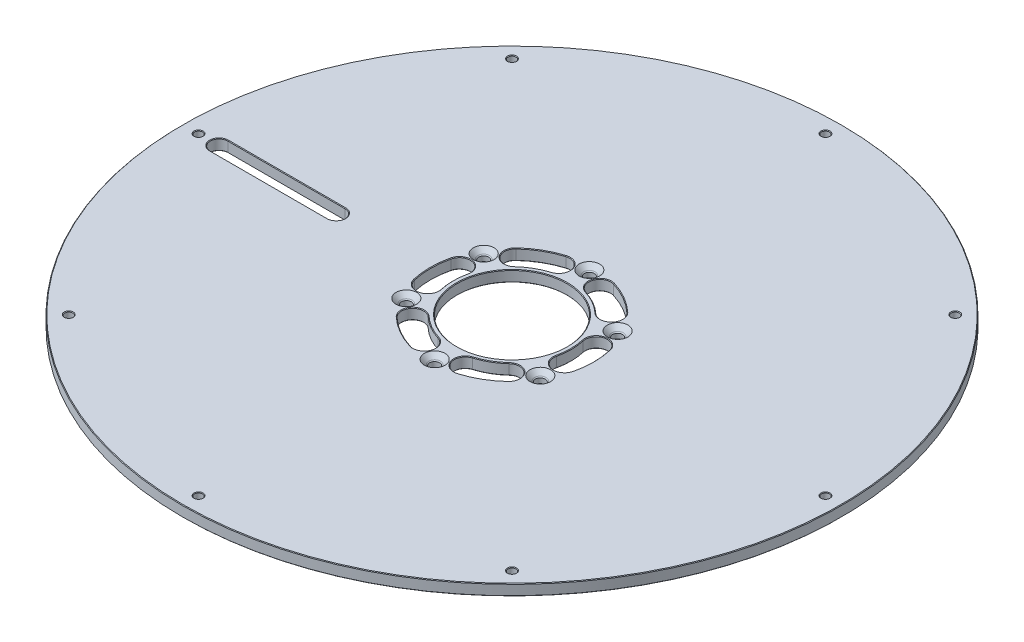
ISO-10303-21;
HEADER;
FILE_DESCRIPTION(('STEP AP214'),'2;1');
FILE_NAME('part.step','',(''),(''),'','','');
FILE_SCHEMA(('AUTOMOTIVE_DESIGN { 1 0 10303 214 1 1 1 1 }'));
ENDSEC;
DATA;
#1=APPLICATION_CONTEXT('core data for automotive mechanical design processes');
#2=APPLICATION_PROTOCOL_DEFINITION('international standard','automotive_design',2000,#1);
#3=PRODUCT_CONTEXT('',#1,'mechanical');
#4=PRODUCT('Part','Part','',(#3));
#5=PRODUCT_RELATED_PRODUCT_CATEGORY('part','',(#4));
#6=PRODUCT_DEFINITION_FORMATION('','',#4);
#7=PRODUCT_DEFINITION_CONTEXT('part definition',#1,'design');
#8=PRODUCT_DEFINITION('design','',#6,#7);
#9=PRODUCT_DEFINITION_SHAPE('','',#8);
#10=(LENGTH_UNIT() NAMED_UNIT(*) SI_UNIT(.MILLI.,.METRE.));
#11=(NAMED_UNIT(*) PLANE_ANGLE_UNIT() SI_UNIT($,.RADIAN.));
#12=(NAMED_UNIT(*) SI_UNIT($,.STERADIAN.) SOLID_ANGLE_UNIT());
#13=UNCERTAINTY_MEASURE_WITH_UNIT(LENGTH_MEASURE(1.E-05),#10,'distance_accuracy_value','');
#14=(GEOMETRIC_REPRESENTATION_CONTEXT(3) GLOBAL_UNCERTAINTY_ASSIGNED_CONTEXT((#13)) GLOBAL_UNIT_ASSIGNED_CONTEXT((#10,
#11,#12)) REPRESENTATION_CONTEXT('',''));
#15=CARTESIAN_POINT('',(0.,0.,0.));
#16=DIRECTION('',(0.,0.,1.));
#17=DIRECTION('',(1.,0.,0.));
#18=AXIS2_PLACEMENT_3D('',#15,#16,#17);
#19=CARTESIAN_POINT('',(-23.8125,0.,0.));
#20=DIRECTION('',(0.,-1.,0.));
#21=DIRECTION('',(0.,0.,-1.));
#22=AXIS2_PLACEMENT_3D('',#19,#20,#21);
#23=PLANE('',#22);
#24=CARTESIAN_POINT('',(-29.0360997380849,0.,16.7639999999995));
#25=DIRECTION('',(0.,-1.,0.));
#26=DIRECTION('',(0.,0.,-1.));
#27=AXIS2_PLACEMENT_3D('',#24,#25,#26);
#28=CIRCLE('',#27,4.47040000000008);
#29=CARTESIAN_POINT('',(-29.0360997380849,0.,12.2935999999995));
#30=VERTEX_POINT('',#29);
#31=EDGE_CURVE('E837',#30,#30,#28,.T.);
#32=ORIENTED_EDGE('',*,*,#31,.T.);
#33=EDGE_LOOP('',(#32));
#34=FACE_BOUND('',#33,.T.);
#35=CARTESIAN_POINT('',(29.0360997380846,0.,16.7640000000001));
#36=DIRECTION('',(0.,-1.,0.));
#37=DIRECTION('',(0.,0.,-1.));
#38=AXIS2_PLACEMENT_3D('',#35,#36,#37);
#39=CIRCLE('',#38,4.47040000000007);
#40=CARTESIAN_POINT('',(29.0360997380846,0.,12.2936000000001));
#41=VERTEX_POINT('',#40);
#42=EDGE_CURVE('E834',#41,#41,#39,.T.);
#43=ORIENTED_EDGE('',*,*,#42,.T.);
#44=EDGE_LOOP('',(#43));
#45=FACE_BOUND('',#44,.T.);
#46=CARTESIAN_POINT('',(2.28983498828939E-13,0.,-33.528));
#47=DIRECTION('',(0.,-1.,0.));
#48=DIRECTION('',(0.,0.,-1.));
#49=AXIS2_PLACEMENT_3D('',#46,#47,#48);
#50=CIRCLE('',#49,4.47040000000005);
#51=CARTESIAN_POINT('',(2.28983498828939E-13,0.,-37.9984000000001));
#52=VERTEX_POINT('',#51);
#53=EDGE_CURVE('E831',#52,#52,#50,.T.);
#54=ORIENTED_EDGE('',*,*,#53,.T.);
#55=EDGE_LOOP('',(#54));
#56=FACE_BOUND('',#55,.T.);
#57=CARTESIAN_POINT('',(-29.0360997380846,0.,-16.7640000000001));
#58=DIRECTION('',(0.,-1.,0.));
#59=DIRECTION('',(0.,0.,-1.));
#60=AXIS2_PLACEMENT_3D('',#57,#58,#59);
#61=CIRCLE('',#60,4.47040000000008);
#62=CARTESIAN_POINT('',(-29.0360997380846,0.,-21.2344000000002));
#63=VERTEX_POINT('',#62);
#64=EDGE_CURVE('E828',#63,#63,#61,.T.);
#65=ORIENTED_EDGE('',*,*,#64,.T.);
#66=EDGE_LOOP('',(#65));
#67=FACE_BOUND('',#66,.T.);
#68=CARTESIAN_POINT('',(135.89,0.,1.42337219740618E-12));
#69=DIRECTION('',(0.,-1.,0.));
#70=DIRECTION('',(0.,0.,-1.));
#71=AXIS2_PLACEMENT_3D('',#68,#69,#70);
#72=CIRCLE('',#71,1.98120000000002);
#73=CARTESIAN_POINT('',(135.89,0.,-1.98119999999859));
#74=VERTEX_POINT('',#73);
#75=EDGE_CURVE('E825',#74,#74,#72,.T.);
#76=ORIENTED_EDGE('',*,*,#75,.T.);
#77=EDGE_LOOP('',(#76));
#78=FACE_BOUND('',#77,.T.);
#79=CARTESIAN_POINT('',(0.,0.,-135.89));
#80=DIRECTION('',(0.,-1.,0.));
#81=DIRECTION('',(0.,0.,-1.));
#82=AXIS2_PLACEMENT_3D('',#79,#80,#81);
#83=CIRCLE('',#82,1.98120000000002);
#84=CARTESIAN_POINT('',(0.,0.,-137.8712));
#85=VERTEX_POINT('',#84);
#86=EDGE_CURVE('E822',#85,#85,#83,.T.);
#87=ORIENTED_EDGE('',*,*,#86,.T.);
#88=EDGE_LOOP('',(#87));
#89=FACE_BOUND('',#88,.T.);
#90=CARTESIAN_POINT('',(-135.89,0.,-4.74457399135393E-13));
#91=DIRECTION('',(0.,-1.,0.));
#92=DIRECTION('',(0.,0.,-1.));
#93=AXIS2_PLACEMENT_3D('',#90,#91,#92);
#94=CIRCLE('',#93,1.98119999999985);
#95=CARTESIAN_POINT('',(-135.89,0.,-1.98120000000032));
#96=VERTEX_POINT('',#95);
#97=EDGE_CURVE('E819',#96,#96,#94,.T.);
#98=ORIENTED_EDGE('',*,*,#97,.T.);
#99=EDGE_LOOP('',(#98));
#100=FACE_BOUND('',#99,.T.);
#101=CARTESIAN_POINT('',(-96.0887404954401,0.,96.0887404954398));
#102=DIRECTION('',(0.,-1.,0.));
#103=DIRECTION('',(0.,0.,-1.));
#104=AXIS2_PLACEMENT_3D('',#101,#102,#103);
#105=CIRCLE('',#104,1.98120000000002);
#106=CARTESIAN_POINT('',(-96.0887404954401,0.,94.1075404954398));
#107=VERTEX_POINT('',#106);
#108=EDGE_CURVE('E816',#107,#107,#105,.T.);
#109=ORIENTED_EDGE('',*,*,#108,.T.);
#110=EDGE_LOOP('',(#109));
#111=FACE_BOUND('',#110,.T.);
#112=CARTESIAN_POINT('',(0.,0.,135.89));
#113=DIRECTION('',(0.,-1.,0.));
#114=DIRECTION('',(0.,0.,-1.));
#115=AXIS2_PLACEMENT_3D('',#112,#113,#114);
#116=CIRCLE('',#115,1.98120000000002);
#117=CARTESIAN_POINT('',(0.,0.,133.9088));
#118=VERTEX_POINT('',#117);
#119=EDGE_CURVE('E813',#118,#118,#116,.T.);
#120=ORIENTED_EDGE('',*,*,#119,.T.);
#121=EDGE_LOOP('',(#120));
#122=FACE_BOUND('',#121,.T.);
#123=DIRECTION('',(1.,0.,0.));
#124=VECTOR('',#123,1.);
#125=CARTESIAN_POINT('',(-23.8125,0.,-4.06400000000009));
#126=LINE('',#125,#124);
#127=CARTESIAN_POINT('',(-127.,0.,-4.06400000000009));
#128=VERTEX_POINT('',#127);
#129=CARTESIAN_POINT('',(-76.2,0.,-4.06400000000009));
#130=VERTEX_POINT('',#129);
#131=EDGE_CURVE('E56',#128,#130,#126,.T.);
#132=ORIENTED_EDGE('',*,*,#131,.T.);
#133=CARTESIAN_POINT('',(-76.2,0.,0.));
#134=DIRECTION('',(0.,-1.,0.));
#135=DIRECTION('',(0.,0.,-1.));
#136=AXIS2_PLACEMENT_3D('',#133,#134,#135);
#137=CIRCLE('',#136,4.06400000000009);
#138=CARTESIAN_POINT('',(-76.2,0.,4.06400000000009));
#139=VERTEX_POINT('',#138);
#140=EDGE_CURVE('E811',#130,#139,#137,.T.);
#141=ORIENTED_EDGE('',*,*,#140,.T.);
#142=DIRECTION('',(-1.,0.,0.));
#143=VECTOR('',#142,1.);
#144=CARTESIAN_POINT('',(-23.8125,0.,4.06400000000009));
#145=LINE('',#144,#143);
#146=CARTESIAN_POINT('',(-127.,0.,4.06400000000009));
#147=VERTEX_POINT('',#146);
#148=EDGE_CURVE('E807',#139,#147,#145,.T.);
#149=ORIENTED_EDGE('',*,*,#148,.T.);
#150=CARTESIAN_POINT('',(-127.,0.,0.));
#151=DIRECTION('',(0.,-1.,0.));
#152=DIRECTION('',(0.,0.,-1.));
#153=AXIS2_PLACEMENT_3D('',#150,#151,#152);
#154=CIRCLE('',#153,4.06400000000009);
#155=EDGE_CURVE('E61',#147,#128,#154,.T.);
#156=ORIENTED_EDGE('',*,*,#155,.T.);
#157=EDGE_LOOP('',(#132,#141,#149,#156));
#158=FACE_BOUND('',#157,.T.);
#159=CARTESIAN_POINT('',(0.,0.,0.));
#160=DIRECTION('',(0.,-1.,0.));
#161=DIRECTION('',(0.,0.,-1.));
#162=AXIS2_PLACEMENT_3D('',#159,#160,#161);
#163=CIRCLE('',#162,142.621);
#164=CARTESIAN_POINT('',(0.,0.,-142.621));
#165=VERTEX_POINT('',#164);
#166=EDGE_CURVE('E804',#165,#165,#163,.F.);
#167=ORIENTED_EDGE('',*,*,#166,.T.);
#168=EDGE_LOOP('',(#167));
#169=FACE_BOUND('',#168,.T.);
#170=CARTESIAN_POINT('',(0.,0.,0.));
#171=DIRECTION('',(0.,-1.,0.));
#172=DIRECTION('',(0.,0.,-1.));
#173=AXIS2_PLACEMENT_3D('',#170,#171,#172);
#174=CIRCLE('',#173,24.0665);
#175=CARTESIAN_POINT('',(0.,0.,-24.0665));
#176=VERTEX_POINT('',#175);
#177=EDGE_CURVE('E801',#176,#176,#174,.T.);
#178=ORIENTED_EDGE('',*,*,#177,.T.);
#179=EDGE_LOOP('',(#178));
#180=FACE_BOUND('',#179,.T.);
#181=CARTESIAN_POINT('',(-96.0887404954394,0.,-96.0887404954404));
#182=DIRECTION('',(0.,-1.,0.));
#183=DIRECTION('',(0.,0.,-1.));
#184=AXIS2_PLACEMENT_3D('',#181,#182,#183);
#185=CIRCLE('',#184,1.98120000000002);
#186=CARTESIAN_POINT('',(-96.0887404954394,0.,-98.0699404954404));
#187=VERTEX_POINT('',#186);
#188=EDGE_CURVE('E798',#187,#187,#185,.T.);
#189=ORIENTED_EDGE('',*,*,#188,.T.);
#190=EDGE_LOOP('',(#189));
#191=FACE_BOUND('',#190,.T.);
#192=CARTESIAN_POINT('',(96.0887404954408,0.,-96.0887404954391));
#193=DIRECTION('',(0.,-1.,0.));
#194=DIRECTION('',(0.,0.,-1.));
#195=AXIS2_PLACEMENT_3D('',#192,#193,#194);
#196=CIRCLE('',#195,1.98120000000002);
#197=CARTESIAN_POINT('',(96.0887404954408,0.,-98.0699404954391));
#198=VERTEX_POINT('',#197);
#199=EDGE_CURVE('E795',#198,#198,#196,.T.);
#200=ORIENTED_EDGE('',*,*,#199,.T.);
#201=EDGE_LOOP('',(#200));
#202=FACE_BOUND('',#201,.T.);
#203=CARTESIAN_POINT('',(96.0887404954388,0.,96.0887404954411));
#204=DIRECTION('',(0.,-1.,0.));
#205=DIRECTION('',(0.,0.,-1.));
#206=AXIS2_PLACEMENT_3D('',#203,#204,#205);
#207=CIRCLE('',#206,1.98120000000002);
#208=CARTESIAN_POINT('',(96.0887404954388,0.,94.1075404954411));
#209=VERTEX_POINT('',#208);
#210=EDGE_CURVE('E792',#209,#209,#207,.T.);
#211=ORIENTED_EDGE('',*,*,#210,.T.);
#212=EDGE_LOOP('',(#211));
#213=FACE_BOUND('',#212,.T.);
#214=CARTESIAN_POINT('',(29.0360997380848,0.,-16.7639999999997));
#215=DIRECTION('',(0.,-1.,0.));
#216=DIRECTION('',(0.,0.,-1.));
#217=AXIS2_PLACEMENT_3D('',#214,#215,#216);
#218=CIRCLE('',#217,4.47040000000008);
#219=CARTESIAN_POINT('',(29.0360997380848,0.,-21.2343999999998));
#220=VERTEX_POINT('',#219);
#221=EDGE_CURVE('E789',#220,#220,#218,.T.);
#222=ORIENTED_EDGE('',*,*,#221,.T.);
#223=EDGE_LOOP('',(#222));
#224=FACE_BOUND('',#223,.T.);
#225=CARTESIAN_POINT('',(-4.63171168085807E-13,0.,33.528));
#226=DIRECTION('',(0.,-1.,0.));
#227=DIRECTION('',(0.,0.,-1.));
#228=AXIS2_PLACEMENT_3D('',#225,#226,#227);
#229=CIRCLE('',#228,4.47040000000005);
#230=CARTESIAN_POINT('',(-4.63171168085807E-13,0.,29.0576));
#231=VERTEX_POINT('',#230);
#232=EDGE_CURVE('E786',#231,#231,#229,.T.);
#233=ORIENTED_EDGE('',*,*,#232,.T.);
#234=EDGE_LOOP('',(#233));
#235=FACE_BOUND('',#234,.T.);
#236=CARTESIAN_POINT('',(-8.91148955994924,0.,29.1481689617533));
#237=DIRECTION('',(0.,-1.,0.));
#238=DIRECTION('',(0.,0.,-1.));
#239=AXIS2_PLACEMENT_3D('',#236,#237,#238);
#240=CIRCLE('',#239,5.02919999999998);
#241=CARTESIAN_POINT('',(-7.44109378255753,0.,24.338721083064));
#242=VERTEX_POINT('',#241);
#243=CARTESIAN_POINT('',(-10.3818853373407,0.,33.9576168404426));
#244=VERTEX_POINT('',#243);
#245=EDGE_CURVE('E781',#242,#244,#240,.T.);
#246=ORIENTED_EDGE('',*,*,#245,.T.);
#247=CARTESIAN_POINT('',(0.,0.,0.));
#248=DIRECTION('',(0.,-1.,0.));
#249=DIRECTION('',(0.,0.,-1.));
#250=AXIS2_PLACEMENT_3D('',#247,#248,#249);
#251=CIRCLE('',#250,35.5092);
#252=CARTESIAN_POINT('',(-24.2172161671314,0.,25.9697848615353));
#253=VERTEX_POINT('',#252);
#254=EDGE_CURVE('E783',#244,#253,#251,.T.);
#255=ORIENTED_EDGE('',*,*,#254,.T.);
#256=CARTESIAN_POINT('',(-20.7873100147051,0.,22.2916608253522));
#257=DIRECTION('',(0.,-1.,0.));
#258=DIRECTION('',(0.,0.,-1.));
#259=AXIS2_PLACEMENT_3D('',#256,#257,#258);
#260=CIRCLE('',#259,5.02919999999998);
#261=CARTESIAN_POINT('',(-17.3574038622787,0.,18.6135367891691));
#262=VERTEX_POINT('',#261);
#263=EDGE_CURVE('E777',#253,#262,#260,.T.);
#264=ORIENTED_EDGE('',*,*,#263,.T.);
#265=CARTESIAN_POINT('',(0.,0.,0.));
#266=DIRECTION('',(0.,-1.,0.));
#267=DIRECTION('',(0.,0.,-1.));
#268=AXIS2_PLACEMENT_3D('',#265,#266,#267);
#269=CIRCLE('',#268,25.4508);
#270=EDGE_CURVE('E779',#262,#242,#269,.F.);
#271=ORIENTED_EDGE('',*,*,#270,.T.);
#272=EDGE_LOOP('',(#246,#255,#264,#271));
#273=FACE_BOUND('',#272,.T.);
#274=CARTESIAN_POINT('',(-29.698799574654,0.,6.85650813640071));
#275=DIRECTION('',(0.,-1.,0.));
#276=DIRECTION('',(0.,0.,-1.));
#277=AXIS2_PLACEMENT_3D('',#274,#275,#276);
#278=CIRCLE('',#277,5.02920000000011);
#279=CARTESIAN_POINT('',(-24.798497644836,0.,5.72518429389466));
#280=VERTEX_POINT('',#279);
#281=CARTESIAN_POINT('',(-34.599101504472,0.,7.98783197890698));
#282=VERTEX_POINT('',#281);
#283=EDGE_CURVE('E772',#280,#282,#278,.T.);
#284=ORIENTED_EDGE('',*,*,#283,.T.);
#285=CARTESIAN_POINT('',(0.,0.,0.));
#286=DIRECTION('',(0.,-1.,0.));
#287=DIRECTION('',(0.,0.,-1.));
#288=AXIS2_PLACEMENT_3D('',#285,#286,#287);
#289=CIRCLE('',#288,35.5092000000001);
#290=CARTESIAN_POINT('',(-34.5991015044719,0.,-7.98783197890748));
#291=VERTEX_POINT('',#290);
#292=EDGE_CURVE('E774',#282,#291,#289,.T.);
#293=ORIENTED_EDGE('',*,*,#292,.T.);
#294=CARTESIAN_POINT('',(-29.6987995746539,0.,-6.85650813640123));
#295=DIRECTION('',(0.,-1.,0.));
#296=DIRECTION('',(0.,0.,-1.));
#297=AXIS2_PLACEMENT_3D('',#294,#295,#296);
#298=CIRCLE('',#297,5.02920000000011);
#299=CARTESIAN_POINT('',(-24.7984976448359,0.,-5.725184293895));
#300=VERTEX_POINT('',#299);
#301=EDGE_CURVE('E768',#291,#300,#298,.T.);
#302=ORIENTED_EDGE('',*,*,#301,.T.);
#303=CARTESIAN_POINT('',(0.,0.,0.));
#304=DIRECTION('',(0.,-1.,0.));
#305=DIRECTION('',(0.,0.,-1.));
#306=AXIS2_PLACEMENT_3D('',#303,#304,#305);
#307=CIRCLE('',#306,25.4507999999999);
#308=EDGE_CURVE('E770',#300,#280,#307,.F.);
#309=ORIENTED_EDGE('',*,*,#308,.T.);
#310=EDGE_LOOP('',(#284,#293,#302,#309));
#311=FACE_BOUND('',#310,.T.);
#312=CARTESIAN_POINT('',(-20.7873100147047,0.,-22.2916608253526));
#313=DIRECTION('',(0.,-1.,0.));
#314=DIRECTION('',(0.,0.,-1.));
#315=AXIS2_PLACEMENT_3D('',#312,#313,#314);
#316=CIRCLE('',#315,5.02920000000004);
#317=CARTESIAN_POINT('',(-17.3574038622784,0.,-18.6135367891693));
#318=VERTEX_POINT('',#317);
#319=CARTESIAN_POINT('',(-24.2172161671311,0.,-25.9697848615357));
#320=VERTEX_POINT('',#319);
#321=EDGE_CURVE('E763',#318,#320,#316,.T.);
#322=ORIENTED_EDGE('',*,*,#321,.T.);
#323=CARTESIAN_POINT('',(0.,0.,0.));
#324=DIRECTION('',(0.,-1.,0.));
#325=DIRECTION('',(0.,0.,-1.));
#326=AXIS2_PLACEMENT_3D('',#323,#324,#325);
#327=CIRCLE('',#326,35.5092);
#328=CARTESIAN_POINT('',(-10.3818853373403,0.,-33.9576168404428));
#329=VERTEX_POINT('',#328);
#330=EDGE_CURVE('E765',#320,#329,#327,.T.);
#331=ORIENTED_EDGE('',*,*,#330,.T.);
#332=CARTESIAN_POINT('',(-8.91148955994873,0.,-29.1481689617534));
#333=DIRECTION('',(0.,-1.,0.));
#334=DIRECTION('',(0.,0.,-1.));
#335=AXIS2_PLACEMENT_3D('',#332,#333,#334);
#336=CIRCLE('',#335,5.02920000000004);
#337=CARTESIAN_POINT('',(-7.44109378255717,0.,-24.3387210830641));
#338=VERTEX_POINT('',#337);
#339=EDGE_CURVE('E759',#329,#338,#336,.T.);
#340=ORIENTED_EDGE('',*,*,#339,.T.);
#341=CARTESIAN_POINT('',(0.,0.,0.));
#342=DIRECTION('',(0.,-1.,0.));
#343=DIRECTION('',(0.,0.,-1.));
#344=AXIS2_PLACEMENT_3D('',#341,#342,#343);
#345=CIRCLE('',#344,25.4508);
#346=EDGE_CURVE('E761',#338,#318,#345,.F.);
#347=ORIENTED_EDGE('',*,*,#346,.T.);
#348=EDGE_LOOP('',(#322,#331,#340,#347));
#349=FACE_BOUND('',#348,.T.);
#350=CARTESIAN_POINT('',(8.91148955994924,0.,-29.1481689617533));
#351=DIRECTION('',(0.,-1.,0.));
#352=DIRECTION('',(0.,0.,-1.));
#353=AXIS2_PLACEMENT_3D('',#350,#351,#352);
#354=CIRCLE('',#353,5.02919999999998);
#355=CARTESIAN_POINT('',(7.44109378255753,0.,-24.338721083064));
#356=VERTEX_POINT('',#355);
#357=CARTESIAN_POINT('',(10.3818853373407,0.,-33.9576168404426));
#358=VERTEX_POINT('',#357);
#359=EDGE_CURVE('E754',#356,#358,#354,.T.);
#360=ORIENTED_EDGE('',*,*,#359,.T.);
#361=CARTESIAN_POINT('',(0.,0.,0.));
#362=DIRECTION('',(0.,-1.,0.));
#363=DIRECTION('',(0.,0.,-1.));
#364=AXIS2_PLACEMENT_3D('',#361,#362,#363);
#365=CIRCLE('',#364,35.5092);
#366=CARTESIAN_POINT('',(24.2172161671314,0.,-25.9697848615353));
#367=VERTEX_POINT('',#366);
#368=EDGE_CURVE('E756',#358,#367,#365,.T.);
#369=ORIENTED_EDGE('',*,*,#368,.T.);
#370=CARTESIAN_POINT('',(20.7873100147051,0.,-22.2916608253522));
#371=DIRECTION('',(0.,-1.,0.));
#372=DIRECTION('',(0.,0.,-1.));
#373=AXIS2_PLACEMENT_3D('',#370,#371,#372);
#374=CIRCLE('',#373,5.02919999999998);
#375=CARTESIAN_POINT('',(17.3574038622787,0.,-18.6135367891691));
#376=VERTEX_POINT('',#375);
#377=EDGE_CURVE('E750',#367,#376,#374,.T.);
#378=ORIENTED_EDGE('',*,*,#377,.T.);
#379=CARTESIAN_POINT('',(0.,0.,0.));
#380=DIRECTION('',(0.,-1.,0.));
#381=DIRECTION('',(0.,0.,-1.));
#382=AXIS2_PLACEMENT_3D('',#379,#380,#381);
#383=CIRCLE('',#382,25.4508);
#384=EDGE_CURVE('E752',#376,#356,#383,.F.);
#385=ORIENTED_EDGE('',*,*,#384,.T.);
#386=EDGE_LOOP('',(#360,#369,#378,#385));
#387=FACE_BOUND('',#386,.T.);
#388=CARTESIAN_POINT('',(29.6987995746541,0.,-6.8565081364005));
#389=DIRECTION('',(0.,-1.,0.));
#390=DIRECTION('',(0.,0.,-1.));
#391=AXIS2_PLACEMENT_3D('',#388,#389,#390);
#392=CIRCLE('',#391,5.02920000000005);
#393=CARTESIAN_POINT('',(24.7984976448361,0.,-5.72518429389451));
#394=VERTEX_POINT('',#393);
#395=CARTESIAN_POINT('',(34.599101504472,0.,-7.98783197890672));
#396=VERTEX_POINT('',#395);
#397=EDGE_CURVE('E745',#394,#396,#392,.T.);
#398=ORIENTED_EDGE('',*,*,#397,.T.);
#399=CARTESIAN_POINT('',(0.,0.,0.));
#400=DIRECTION('',(0.,-1.,0.));
#401=DIRECTION('',(0.,0.,-1.));
#402=AXIS2_PLACEMENT_3D('',#399,#400,#401);
#403=CIRCLE('',#402,35.5092000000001);
#404=CARTESIAN_POINT('',(34.5991015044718,0.,7.98783197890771));
#405=VERTEX_POINT('',#404);
#406=EDGE_CURVE('E747',#396,#405,#403,.T.);
#407=ORIENTED_EDGE('',*,*,#406,.T.);
#408=CARTESIAN_POINT('',(29.6987995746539,0.,6.85650813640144));
#409=DIRECTION('',(0.,-1.,0.));
#410=DIRECTION('',(0.,0.,-1.));
#411=AXIS2_PLACEMENT_3D('',#408,#409,#410);
#412=CIRCLE('',#411,5.02920000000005);
#413=CARTESIAN_POINT('',(24.7984976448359,0.,5.72518429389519));
#414=VERTEX_POINT('',#413);
#415=EDGE_CURVE('E741',#405,#414,#412,.T.);
#416=ORIENTED_EDGE('',*,*,#415,.T.);
#417=CARTESIAN_POINT('',(0.,0.,0.));
#418=DIRECTION('',(0.,-1.,0.));
#419=DIRECTION('',(0.,0.,-1.));
#420=AXIS2_PLACEMENT_3D('',#417,#418,#419);
#421=CIRCLE('',#420,25.4508);
#422=EDGE_CURVE('E743',#414,#394,#421,.F.);
#423=ORIENTED_EDGE('',*,*,#422,.T.);
#424=EDGE_LOOP('',(#398,#407,#416,#423));
#425=FACE_BOUND('',#424,.T.);
#426=CARTESIAN_POINT('',(20.7873100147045,0.,22.2916608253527));
#427=DIRECTION('',(0.,-1.,0.));
#428=DIRECTION('',(0.,0.,-1.));
#429=AXIS2_PLACEMENT_3D('',#426,#427,#428);
#430=CIRCLE('',#429,5.0292000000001);
#431=CARTESIAN_POINT('',(17.3574038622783,0.,18.6135367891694));
#432=VERTEX_POINT('',#431);
#433=CARTESIAN_POINT('',(24.2172161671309,0.,25.9697848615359));
#434=VERTEX_POINT('',#433);
#435=EDGE_CURVE('E736',#432,#434,#430,.T.);
#436=ORIENTED_EDGE('',*,*,#435,.T.);
#437=CARTESIAN_POINT('',(0.,0.,0.));
#438=DIRECTION('',(0.,-1.,0.));
#439=DIRECTION('',(0.,0.,-1.));
#440=AXIS2_PLACEMENT_3D('',#437,#438,#439);
#441=CIRCLE('',#440,35.5092000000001);
#442=CARTESIAN_POINT('',(10.38188533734,0.,33.9576168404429));
#443=VERTEX_POINT('',#442);
#444=EDGE_CURVE('E738',#434,#443,#441,.T.);
#445=ORIENTED_EDGE('',*,*,#444,.T.);
#446=CARTESIAN_POINT('',(8.91148955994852,0.,29.1481689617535));
#447=DIRECTION('',(0.,-1.,0.));
#448=DIRECTION('',(0.,0.,-1.));
#449=AXIS2_PLACEMENT_3D('',#446,#447,#448);
#450=CIRCLE('',#449,5.0292000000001);
#451=CARTESIAN_POINT('',(7.44109378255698,0.,24.3387210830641));
#452=VERTEX_POINT('',#451);
#453=EDGE_CURVE('E732',#443,#452,#450,.T.);
#454=ORIENTED_EDGE('',*,*,#453,.T.);
#455=CARTESIAN_POINT('',(0.,0.,0.));
#456=DIRECTION('',(0.,-1.,0.));
#457=DIRECTION('',(0.,0.,-1.));
#458=AXIS2_PLACEMENT_3D('',#455,#456,#457);
#459=CIRCLE('',#458,25.4507999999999);
#460=EDGE_CURVE('E734',#452,#432,#459,.F.);
#461=ORIENTED_EDGE('',*,*,#460,.T.);
#462=EDGE_LOOP('',(#436,#445,#454,#461));
#463=FACE_BOUND('',#462,.T.);
#464=ADVANCED_FACE('F39',(#34,#45,#56,#67,#78,#89,#100,#111,#122,#158,#169,#180,#191,#202,#213,
#224,#235,#273,#311,#349,#387,#425,#463),#23,.F.);
#465=CARTESIAN_POINT('',(0.,0.,0.));
#466=DIRECTION('',(0.,-1.,0.));
#467=DIRECTION('',(0.,0.,-1.));
#468=AXIS2_PLACEMENT_3D('',#465,#466,#467);
#469=CYLINDRICAL_SURFACE('',#468,23.8125);
#470=CARTESIAN_POINT('',(0.,-4.50849999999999,0.));
#471=DIRECTION('',(0.,1.,0.));
#472=DIRECTION('',(0.,0.,1.));
#473=AXIS2_PLACEMENT_3D('',#470,#471,#472);
#474=CIRCLE('',#473,23.8125);
#475=CARTESIAN_POINT('',(0.,-4.50849999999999,23.8125));
#476=VERTEX_POINT('',#475);
#477=EDGE_CURVE('E536',#476,#476,#474,.F.);
#478=ORIENTED_EDGE('',*,*,#477,.T.);
#479=EDGE_LOOP('',(#478));
#480=FACE_BOUND('',#479,.T.);
#481=CARTESIAN_POINT('',(0.,-0.253999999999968,0.));
#482=DIRECTION('',(0.,-1.,0.));
#483=DIRECTION('',(0.,0.,-1.));
#484=AXIS2_PLACEMENT_3D('',#481,#482,#483);
#485=CIRCLE('',#484,23.8125);
#486=CARTESIAN_POINT('',(0.,-0.253999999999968,-23.8125));
#487=VERTEX_POINT('',#486);
#488=EDGE_CURVE('E533',#487,#487,#485,.F.);
#489=ORIENTED_EDGE('',*,*,#488,.T.);
#490=EDGE_LOOP('',(#489));
#491=FACE_BOUND('',#490,.T.);
#492=ADVANCED_FACE('F1135',(#480,#491),#469,.F.);
#493=CARTESIAN_POINT('',(-23.8125,-4.76250000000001,0.));
#494=DIRECTION('',(0.,1.,0.));
#495=DIRECTION('',(0.,0.,1.));
#496=AXIS2_PLACEMENT_3D('',#493,#494,#495);
#497=PLANE('',#496);
#498=CARTESIAN_POINT('',(0.,-4.76250000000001,0.));
#499=DIRECTION('',(0.,1.,0.));
#500=DIRECTION('',(0.,0.,1.));
#501=AXIS2_PLACEMENT_3D('',#498,#499,#500);
#502=CIRCLE('',#501,142.621);
#503=CARTESIAN_POINT('',(0.,-4.76250000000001,142.621));
#504=VERTEX_POINT('',#503);
#505=EDGE_CURVE('E524',#504,#504,#502,.F.);
#506=ORIENTED_EDGE('',*,*,#505,.T.);
#507=EDGE_LOOP('',(#506));
#508=FACE_BOUND('',#507,.T.);
#509=CARTESIAN_POINT('',(0.,-4.76250000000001,0.));
#510=DIRECTION('',(0.,1.,0.));
#511=DIRECTION('',(0.,0.,1.));
#512=AXIS2_PLACEMENT_3D('',#509,#510,#511);
#513=CIRCLE('',#512,24.0665);
#514=CARTESIAN_POINT('',(0.,-4.76250000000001,24.0665));
#515=VERTEX_POINT('',#514);
#516=EDGE_CURVE('E521',#515,#515,#513,.T.);
#517=ORIENTED_EDGE('',*,*,#516,.T.);
#518=EDGE_LOOP('',(#517));
#519=FACE_BOUND('',#518,.T.);
#520=DIRECTION('',(1.,0.,0.));
#521=VECTOR('',#520,1.);
#522=CARTESIAN_POINT('',(-23.8125,-4.76250000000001,4.06399999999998));
#523=LINE('',#522,#521);
#524=CARTESIAN_POINT('',(-127.,-4.76250000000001,4.06399999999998));
#525=VERTEX_POINT('',#524);
#526=CARTESIAN_POINT('',(-76.2,-4.76250000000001,4.06399999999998));
#527=VERTEX_POINT('',#526);
#528=EDGE_CURVE('E516',#525,#527,#523,.T.);
#529=ORIENTED_EDGE('',*,*,#528,.T.);
#530=CARTESIAN_POINT('',(-76.2,-4.76250000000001,0.));
#531=DIRECTION('',(0.,1.,0.));
#532=DIRECTION('',(0.,0.,1.));
#533=AXIS2_PLACEMENT_3D('',#530,#531,#532);
#534=CIRCLE('',#533,4.06399999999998);
#535=CARTESIAN_POINT('',(-76.2,-4.76250000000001,-4.06399999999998));
#536=VERTEX_POINT('',#535);
#537=EDGE_CURVE('E518',#527,#536,#534,.T.);
#538=ORIENTED_EDGE('',*,*,#537,.T.);
#539=DIRECTION('',(-1.,0.,0.));
#540=VECTOR('',#539,1.);
#541=CARTESIAN_POINT('',(-23.8125,-4.76250000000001,-4.06399999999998));
#542=LINE('',#541,#540);
#543=CARTESIAN_POINT('',(-127.,-4.76250000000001,-4.06399999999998));
#544=VERTEX_POINT('',#543);
#545=EDGE_CURVE('E512',#536,#544,#542,.T.);
#546=ORIENTED_EDGE('',*,*,#545,.T.);
#547=CARTESIAN_POINT('',(-127.,-4.76250000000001,0.));
#548=DIRECTION('',(0.,1.,0.));
#549=DIRECTION('',(0.,0.,1.));
#550=AXIS2_PLACEMENT_3D('',#547,#548,#549);
#551=CIRCLE('',#550,4.06399999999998);
#552=EDGE_CURVE('E514',#544,#525,#551,.T.);
#553=ORIENTED_EDGE('',*,*,#552,.T.);
#554=EDGE_LOOP('',(#529,#538,#546,#553));
#555=FACE_BOUND('',#554,.T.);
#556=CARTESIAN_POINT('',(0.,-4.76250000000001,135.89));
#557=DIRECTION('',(0.,1.,0.));
#558=DIRECTION('',(0.,0.,1.));
#559=AXIS2_PLACEMENT_3D('',#556,#557,#558);
#560=CIRCLE('',#559,1.98119999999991);
#561=CARTESIAN_POINT('',(0.,-4.76250000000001,137.8712));
#562=VERTEX_POINT('',#561);
#563=EDGE_CURVE('E509',#562,#562,#560,.T.);
#564=ORIENTED_EDGE('',*,*,#563,.T.);
#565=EDGE_LOOP('',(#564));
#566=FACE_BOUND('',#565,.T.);
#567=CARTESIAN_POINT('',(-96.0887404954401,-4.76250000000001,96.0887404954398));
#568=DIRECTION('',(0.,1.,0.));
#569=DIRECTION('',(0.,0.,1.));
#570=AXIS2_PLACEMENT_3D('',#567,#568,#569);
#571=CIRCLE('',#570,1.98120000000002);
#572=CARTESIAN_POINT('',(-96.0887404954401,-4.76250000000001,98.0699404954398));
#573=VERTEX_POINT('',#572);
#574=EDGE_CURVE('E506',#573,#573,#571,.T.);
#575=ORIENTED_EDGE('',*,*,#574,.T.);
#576=EDGE_LOOP('',(#575));
#577=FACE_BOUND('',#576,.T.);
#578=CARTESIAN_POINT('',(-135.89,-4.76250000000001,-4.74457399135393E-13));
#579=DIRECTION('',(0.,1.,0.));
#580=DIRECTION('',(0.,0.,1.));
#581=AXIS2_PLACEMENT_3D('',#578,#579,#580);
#582=CIRCLE('',#581,1.98119999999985);
#583=CARTESIAN_POINT('',(-135.89,-4.76250000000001,1.98119999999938));
#584=VERTEX_POINT('',#583);
#585=EDGE_CURVE('E503',#584,#584,#582,.T.);
#586=ORIENTED_EDGE('',*,*,#585,.T.);
#587=EDGE_LOOP('',(#586));
#588=FACE_BOUND('',#587,.T.);
#589=CARTESIAN_POINT('',(-96.0887404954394,-4.76250000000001,-96.0887404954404));
#590=DIRECTION('',(0.,1.,0.));
#591=DIRECTION('',(0.,0.,1.));
#592=AXIS2_PLACEMENT_3D('',#589,#590,#591);
#593=CIRCLE('',#592,1.98120000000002);
#594=CARTESIAN_POINT('',(-96.0887404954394,-4.76250000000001,-94.1075404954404));
#595=VERTEX_POINT('',#594);
#596=EDGE_CURVE('E500',#595,#595,#593,.T.);
#597=ORIENTED_EDGE('',*,*,#596,.T.);
#598=EDGE_LOOP('',(#597));
#599=FACE_BOUND('',#598,.T.);
#600=CARTESIAN_POINT('',(0.,-4.76250000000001,-135.89));
#601=DIRECTION('',(0.,1.,0.));
#602=DIRECTION('',(0.,0.,1.));
#603=AXIS2_PLACEMENT_3D('',#600,#601,#602);
#604=CIRCLE('',#603,1.98119999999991);
#605=CARTESIAN_POINT('',(0.,-4.76250000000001,-133.9088));
#606=VERTEX_POINT('',#605);
#607=EDGE_CURVE('E497',#606,#606,#604,.T.);
#608=ORIENTED_EDGE('',*,*,#607,.T.);
#609=EDGE_LOOP('',(#608));
#610=FACE_BOUND('',#609,.T.);
#611=CARTESIAN_POINT('',(96.0887404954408,-4.76250000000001,-96.0887404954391));
#612=DIRECTION('',(0.,1.,0.));
#613=DIRECTION('',(0.,0.,1.));
#614=AXIS2_PLACEMENT_3D('',#611,#612,#613);
#615=CIRCLE('',#614,1.98120000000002);
#616=CARTESIAN_POINT('',(96.0887404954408,-4.76250000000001,-94.1075404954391));
#617=VERTEX_POINT('',#616);
#618=EDGE_CURVE('E494',#617,#617,#615,.T.);
#619=ORIENTED_EDGE('',*,*,#618,.T.);
#620=EDGE_LOOP('',(#619));
#621=FACE_BOUND('',#620,.T.);
#622=CARTESIAN_POINT('',(135.89,-4.76250000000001,1.42337219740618E-12));
#623=DIRECTION('',(0.,1.,0.));
#624=DIRECTION('',(0.,0.,1.));
#625=AXIS2_PLACEMENT_3D('',#622,#623,#624);
#626=CIRCLE('',#625,1.98119999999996);
#627=CARTESIAN_POINT('',(135.89,-4.76250000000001,1.98120000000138));
#628=VERTEX_POINT('',#627);
#629=EDGE_CURVE('E491',#628,#628,#626,.T.);
#630=ORIENTED_EDGE('',*,*,#629,.T.);
#631=EDGE_LOOP('',(#630));
#632=FACE_BOUND('',#631,.T.);
#633=CARTESIAN_POINT('',(96.0887404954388,-4.76250000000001,96.0887404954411));
#634=DIRECTION('',(0.,1.,0.));
#635=DIRECTION('',(0.,0.,1.));
#636=AXIS2_PLACEMENT_3D('',#633,#634,#635);
#637=CIRCLE('',#636,1.98120000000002);
#638=CARTESIAN_POINT('',(96.0887404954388,-4.76250000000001,98.0699404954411));
#639=VERTEX_POINT('',#638);
#640=EDGE_CURVE('E488',#639,#639,#637,.T.);
#641=ORIENTED_EDGE('',*,*,#640,.T.);
#642=EDGE_LOOP('',(#641));
#643=FACE_BOUND('',#642,.T.);
#644=CARTESIAN_POINT('',(-29.0360997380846,-4.76250000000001,-16.7640000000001));
#645=DIRECTION('',(0.,1.,0.));
#646=DIRECTION('',(0.,0.,1.));
#647=AXIS2_PLACEMENT_3D('',#644,#645,#646);
#648=CIRCLE('',#647,2.40665000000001);
#649=CARTESIAN_POINT('',(-29.0360997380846,-4.76250000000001,-14.3573500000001));
#650=VERTEX_POINT('',#649);
#651=EDGE_CURVE('E485',#650,#650,#648,.T.);
#652=ORIENTED_EDGE('',*,*,#651,.T.);
#653=EDGE_LOOP('',(#652));
#654=FACE_BOUND('',#653,.T.);
#655=CARTESIAN_POINT('',(2.28983498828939E-13,-4.76250000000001,-33.528));
#656=DIRECTION('',(0.,1.,0.));
#657=DIRECTION('',(0.,0.,1.));
#658=AXIS2_PLACEMENT_3D('',#655,#656,#657);
#659=CIRCLE('',#658,2.40664999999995);
#660=CARTESIAN_POINT('',(2.28983498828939E-13,-4.76250000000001,-31.12135));
#661=VERTEX_POINT('',#660);
#662=EDGE_CURVE('E482',#661,#661,#659,.T.);
#663=ORIENTED_EDGE('',*,*,#662,.T.);
#664=EDGE_LOOP('',(#663));
#665=FACE_BOUND('',#664,.T.);
#666=CARTESIAN_POINT('',(29.0360997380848,-4.76250000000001,-16.7639999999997));
#667=DIRECTION('',(0.,1.,0.));
#668=DIRECTION('',(0.,0.,1.));
#669=AXIS2_PLACEMENT_3D('',#666,#667,#668);
#670=CIRCLE('',#669,2.40665000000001);
#671=CARTESIAN_POINT('',(29.0360997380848,-4.76250000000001,-14.3573499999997));
#672=VERTEX_POINT('',#671);
#673=EDGE_CURVE('E479',#672,#672,#670,.T.);
#674=ORIENTED_EDGE('',*,*,#673,.T.);
#675=EDGE_LOOP('',(#674));
#676=FACE_BOUND('',#675,.T.);
#677=CARTESIAN_POINT('',(29.0360997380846,-4.76250000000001,16.7640000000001));
#678=DIRECTION('',(0.,1.,0.));
#679=DIRECTION('',(0.,0.,1.));
#680=AXIS2_PLACEMENT_3D('',#677,#678,#679);
#681=CIRCLE('',#680,2.4066499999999);
#682=CARTESIAN_POINT('',(29.0360997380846,-4.76250000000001,19.17065));
#683=VERTEX_POINT('',#682);
#684=EDGE_CURVE('E476',#683,#683,#681,.T.);
#685=ORIENTED_EDGE('',*,*,#684,.T.);
#686=EDGE_LOOP('',(#685));
#687=FACE_BOUND('',#686,.T.);
#688=CARTESIAN_POINT('',(-4.63171168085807E-13,-4.76250000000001,33.528));
#689=DIRECTION('',(0.,1.,0.));
#690=DIRECTION('',(0.,0.,1.));
#691=AXIS2_PLACEMENT_3D('',#688,#689,#690);
#692=CIRCLE('',#691,2.40664999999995);
#693=CARTESIAN_POINT('',(-4.63171168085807E-13,-4.76250000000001,35.93465));
#694=VERTEX_POINT('',#693);
#695=EDGE_CURVE('E473',#694,#694,#692,.T.);
#696=ORIENTED_EDGE('',*,*,#695,.T.);
#697=EDGE_LOOP('',(#696));
#698=FACE_BOUND('',#697,.T.);
#699=CARTESIAN_POINT('',(-29.0360997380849,-4.76250000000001,16.7639999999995));
#700=DIRECTION('',(0.,1.,0.));
#701=DIRECTION('',(0.,0.,1.));
#702=AXIS2_PLACEMENT_3D('',#699,#700,#701);
#703=CIRCLE('',#702,2.40665000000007);
#704=CARTESIAN_POINT('',(-29.0360997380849,-4.76250000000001,19.1706499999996));
#705=VERTEX_POINT('',#704);
#706=EDGE_CURVE('E470',#705,#705,#703,.T.);
#707=ORIENTED_EDGE('',*,*,#706,.T.);
#708=EDGE_LOOP('',(#707));
#709=FACE_BOUND('',#708,.T.);
#710=CARTESIAN_POINT('',(-20.7873100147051,-4.76250000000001,22.2916608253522));
#711=DIRECTION('',(0.,1.,0.));
#712=DIRECTION('',(0.,0.,1.));
#713=AXIS2_PLACEMENT_3D('',#710,#711,#712);
#714=CIRCLE('',#713,5.02920000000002);
#715=CARTESIAN_POINT('',(-17.3574038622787,-4.76250000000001,18.6135367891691));
#716=VERTEX_POINT('',#715);
#717=CARTESIAN_POINT('',(-24.2172161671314,-4.76250000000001,25.9697848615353));
#718=VERTEX_POINT('',#717);
#719=EDGE_CURVE('E465',#716,#718,#714,.T.);
#720=ORIENTED_EDGE('',*,*,#719,.T.);
#721=CARTESIAN_POINT('',(0.,-4.76250000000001,0.));
#722=DIRECTION('',(0.,1.,0.));
#723=DIRECTION('',(0.,0.,1.));
#724=AXIS2_PLACEMENT_3D('',#721,#722,#723);
#725=CIRCLE('',#724,35.5092);
#726=CARTESIAN_POINT('',(-10.3818853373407,-4.76250000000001,33.9576168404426));
#727=VERTEX_POINT('',#726);
#728=EDGE_CURVE('E467',#718,#727,#725,.T.);
#729=ORIENTED_EDGE('',*,*,#728,.T.);
#730=CARTESIAN_POINT('',(-8.91148955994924,-4.76250000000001,29.1481689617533));
#731=DIRECTION('',(0.,1.,0.));
#732=DIRECTION('',(0.,0.,1.));
#733=AXIS2_PLACEMENT_3D('',#730,#731,#732);
#734=CIRCLE('',#733,5.02920000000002);
#735=CARTESIAN_POINT('',(-7.44109378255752,-4.76250000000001,24.338721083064));
#736=VERTEX_POINT('',#735);
#737=EDGE_CURVE('E461',#727,#736,#734,.T.);
#738=ORIENTED_EDGE('',*,*,#737,.T.);
#739=CARTESIAN_POINT('',(0.,-4.76250000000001,0.));
#740=DIRECTION('',(0.,1.,0.));
#741=DIRECTION('',(0.,0.,1.));
#742=AXIS2_PLACEMENT_3D('',#739,#740,#741);
#743=CIRCLE('',#742,25.4508);
#744=EDGE_CURVE('E463',#736,#716,#743,.F.);
#745=ORIENTED_EDGE('',*,*,#744,.T.);
#746=EDGE_LOOP('',(#720,#729,#738,#745));
#747=FACE_BOUND('',#746,.T.);
#748=CARTESIAN_POINT('',(-29.6987995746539,-4.76250000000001,-6.85650813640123));
#749=DIRECTION('',(0.,1.,0.));
#750=DIRECTION('',(0.,0.,1.));
#751=AXIS2_PLACEMENT_3D('',#748,#749,#750);
#752=CIRCLE('',#751,5.02919999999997);
#753=CARTESIAN_POINT('',(-24.798497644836,-4.76250000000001,-5.72518429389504));
#754=VERTEX_POINT('',#753);
#755=CARTESIAN_POINT('',(-34.5991015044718,-4.76250000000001,-7.98783197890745));
#756=VERTEX_POINT('',#755);
#757=EDGE_CURVE('E456',#754,#756,#752,.T.);
#758=ORIENTED_EDGE('',*,*,#757,.T.);
#759=CARTESIAN_POINT('',(0.,-4.76250000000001,0.));
#760=DIRECTION('',(0.,1.,0.));
#761=DIRECTION('',(0.,0.,1.));
#762=AXIS2_PLACEMENT_3D('',#759,#760,#761);
#763=CIRCLE('',#762,35.5092);
#764=CARTESIAN_POINT('',(-34.5991015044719,-4.76250000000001,7.98783197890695));
#765=VERTEX_POINT('',#764);
#766=EDGE_CURVE('E458',#756,#765,#763,.T.);
#767=ORIENTED_EDGE('',*,*,#766,.T.);
#768=CARTESIAN_POINT('',(-29.698799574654,-4.76250000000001,6.85650813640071));
#769=DIRECTION('',(0.,1.,0.));
#770=DIRECTION('',(0.,0.,1.));
#771=AXIS2_PLACEMENT_3D('',#768,#769,#770);
#772=CIRCLE('',#771,5.02919999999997);
#773=CARTESIAN_POINT('',(-24.7984976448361,-4.76250000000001,5.72518429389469));
#774=VERTEX_POINT('',#773);
#775=EDGE_CURVE('E452',#765,#774,#772,.T.);
#776=ORIENTED_EDGE('',*,*,#775,.T.);
#777=CARTESIAN_POINT('',(0.,-4.76250000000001,0.));
#778=DIRECTION('',(0.,1.,0.));
#779=DIRECTION('',(0.,0.,1.));
#780=AXIS2_PLACEMENT_3D('',#777,#778,#779);
#781=CIRCLE('',#780,25.4508);
#782=EDGE_CURVE('E454',#774,#754,#781,.F.);
#783=ORIENTED_EDGE('',*,*,#782,.T.);
#784=EDGE_LOOP('',(#758,#767,#776,#783));
#785=FACE_BOUND('',#784,.T.);
#786=CARTESIAN_POINT('',(-8.91148955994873,-4.76250000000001,-29.1481689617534));
#787=DIRECTION('',(0.,1.,0.));
#788=DIRECTION('',(0.,0.,1.));
#789=AXIS2_PLACEMENT_3D('',#786,#787,#788);
#790=CIRCLE('',#789,5.02919999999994);
#791=CARTESIAN_POINT('',(-7.4410937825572,-4.76250000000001,-24.3387210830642));
#792=VERTEX_POINT('',#791);
#793=CARTESIAN_POINT('',(-10.3818853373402,-4.76250000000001,-33.9576168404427));
#794=VERTEX_POINT('',#793);
#795=EDGE_CURVE('E447',#792,#794,#790,.T.);
#796=ORIENTED_EDGE('',*,*,#795,.T.);
#797=CARTESIAN_POINT('',(0.,-4.76250000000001,0.));
#798=DIRECTION('',(0.,1.,0.));
#799=DIRECTION('',(0.,0.,1.));
#800=AXIS2_PLACEMENT_3D('',#797,#798,#799);
#801=CIRCLE('',#800,35.5091999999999);
#802=CARTESIAN_POINT('',(-24.217216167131,-4.76250000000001,-25.9697848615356));
#803=VERTEX_POINT('',#802);
#804=EDGE_CURVE('E449',#794,#803,#801,.T.);
#805=ORIENTED_EDGE('',*,*,#804,.T.);
#806=CARTESIAN_POINT('',(-20.7873100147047,-4.76250000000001,-22.2916608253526));
#807=DIRECTION('',(0.,1.,0.));
#808=DIRECTION('',(0.,0.,1.));
#809=AXIS2_PLACEMENT_3D('',#806,#807,#808);
#810=CIRCLE('',#809,5.02919999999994);
#811=CARTESIAN_POINT('',(-17.3574038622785,-4.76250000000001,-18.6135367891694));
#812=VERTEX_POINT('',#811);
#813=EDGE_CURVE('E443',#803,#812,#810,.T.);
#814=ORIENTED_EDGE('',*,*,#813,.T.);
#815=CARTESIAN_POINT('',(0.,-4.76250000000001,0.));
#816=DIRECTION('',(0.,1.,0.));
#817=DIRECTION('',(0.,0.,1.));
#818=AXIS2_PLACEMENT_3D('',#815,#816,#817);
#819=CIRCLE('',#818,25.4508000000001);
#820=EDGE_CURVE('E445',#812,#792,#819,.F.);
#821=ORIENTED_EDGE('',*,*,#820,.T.);
#822=EDGE_LOOP('',(#796,#805,#814,#821));
#823=FACE_BOUND('',#822,.T.);
#824=CARTESIAN_POINT('',(20.7873100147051,-4.76250000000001,-22.2916608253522));
#825=DIRECTION('',(0.,1.,0.));
#826=DIRECTION('',(0.,0.,1.));
#827=AXIS2_PLACEMENT_3D('',#824,#825,#826);
#828=CIRCLE('',#827,5.02920000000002);
#829=CARTESIAN_POINT('',(17.3574038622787,-4.76250000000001,-18.6135367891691));
#830=VERTEX_POINT('',#829);
#831=CARTESIAN_POINT('',(24.2172161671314,-4.76250000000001,-25.9697848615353));
#832=VERTEX_POINT('',#831);
#833=EDGE_CURVE('E438',#830,#832,#828,.T.);
#834=ORIENTED_EDGE('',*,*,#833,.T.);
#835=CARTESIAN_POINT('',(0.,-4.76250000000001,0.));
#836=DIRECTION('',(0.,1.,0.));
#837=DIRECTION('',(0.,0.,1.));
#838=AXIS2_PLACEMENT_3D('',#835,#836,#837);
#839=CIRCLE('',#838,35.5092);
#840=CARTESIAN_POINT('',(10.3818853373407,-4.76250000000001,-33.9576168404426));
#841=VERTEX_POINT('',#840);
#842=EDGE_CURVE('E440',#832,#841,#839,.T.);
#843=ORIENTED_EDGE('',*,*,#842,.T.);
#844=CARTESIAN_POINT('',(8.91148955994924,-4.76250000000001,-29.1481689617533));
#845=DIRECTION('',(0.,1.,0.));
#846=DIRECTION('',(0.,0.,1.));
#847=AXIS2_PLACEMENT_3D('',#844,#845,#846);
#848=CIRCLE('',#847,5.02920000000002);
#849=CARTESIAN_POINT('',(7.44109378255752,-4.76250000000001,-24.338721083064));
#850=VERTEX_POINT('',#849);
#851=EDGE_CURVE('E434',#841,#850,#848,.T.);
#852=ORIENTED_EDGE('',*,*,#851,.T.);
#853=CARTESIAN_POINT('',(0.,-4.76250000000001,0.));
#854=DIRECTION('',(0.,1.,0.));
#855=DIRECTION('',(0.,0.,1.));
#856=AXIS2_PLACEMENT_3D('',#853,#854,#855);
#857=CIRCLE('',#856,25.4508);
#858=EDGE_CURVE('E436',#850,#830,#857,.F.);
#859=ORIENTED_EDGE('',*,*,#858,.T.);
#860=EDGE_LOOP('',(#834,#843,#852,#859));
#861=FACE_BOUND('',#860,.T.);
#862=CARTESIAN_POINT('',(29.6987995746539,-4.76250000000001,6.85650813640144));
#863=DIRECTION('',(0.,1.,0.));
#864=DIRECTION('',(0.,0.,1.));
#865=AXIS2_PLACEMENT_3D('',#862,#863,#864);
#866=CIRCLE('',#865,5.02919999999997);
#867=CARTESIAN_POINT('',(24.798497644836,-4.76250000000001,5.72518429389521));
#868=VERTEX_POINT('',#867);
#869=CARTESIAN_POINT('',(34.5991015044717,-4.76250000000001,7.98783197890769));
#870=VERTEX_POINT('',#869);
#871=EDGE_CURVE('E429',#868,#870,#866,.T.);
#872=ORIENTED_EDGE('',*,*,#871,.T.);
#873=CARTESIAN_POINT('',(0.,-4.76250000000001,0.));
#874=DIRECTION('',(0.,1.,0.));
#875=DIRECTION('',(0.,0.,1.));
#876=AXIS2_PLACEMENT_3D('',#873,#874,#875);
#877=CIRCLE('',#876,35.5092);
#878=CARTESIAN_POINT('',(34.599101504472,-4.76250000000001,-7.9878319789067));
#879=VERTEX_POINT('',#878);
#880=EDGE_CURVE('E431',#870,#879,#877,.T.);
#881=ORIENTED_EDGE('',*,*,#880,.T.);
#882=CARTESIAN_POINT('',(29.6987995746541,-4.76250000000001,-6.8565081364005));
#883=DIRECTION('',(0.,1.,0.));
#884=DIRECTION('',(0.,0.,1.));
#885=AXIS2_PLACEMENT_3D('',#882,#883,#884);
#886=CIRCLE('',#885,5.02919999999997);
#887=CARTESIAN_POINT('',(24.7984976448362,-4.76250000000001,-5.72518429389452));
#888=VERTEX_POINT('',#887);
#889=EDGE_CURVE('E421',#879,#888,#886,.T.);
#890=ORIENTED_EDGE('',*,*,#889,.T.);
#891=CARTESIAN_POINT('',(0.,-4.76250000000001,0.));
#892=DIRECTION('',(0.,1.,0.));
#893=DIRECTION('',(0.,0.,1.));
#894=AXIS2_PLACEMENT_3D('',#891,#892,#893);
#895=CIRCLE('',#894,25.4508);
#896=EDGE_CURVE('E423',#888,#868,#895,.F.);
#897=ORIENTED_EDGE('',*,*,#896,.T.);
#898=EDGE_LOOP('',(#872,#881,#890,#897));
#899=FACE_BOUND('',#898,.T.);
#900=CARTESIAN_POINT('',(8.91148955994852,-4.76250000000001,29.1481689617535));
#901=DIRECTION('',(0.,1.,0.));
#902=DIRECTION('',(0.,0.,1.));
#903=AXIS2_PLACEMENT_3D('',#900,#901,#902);
#904=CIRCLE('',#903,5.02919999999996);
#905=CARTESIAN_POINT('',(7.44109378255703,-4.76250000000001,24.3387210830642));
#906=VERTEX_POINT('',#905);
#907=CARTESIAN_POINT('',(10.38188533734,-4.76250000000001,33.9576168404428));
#908=VERTEX_POINT('',#907);
#909=EDGE_CURVE('E419',#906,#908,#904,.T.);
#910=ORIENTED_EDGE('',*,*,#909,.T.);
#911=CARTESIAN_POINT('',(0.,-4.76250000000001,0.));
#912=DIRECTION('',(0.,1.,0.));
#913=DIRECTION('',(0.,0.,1.));
#914=AXIS2_PLACEMENT_3D('',#911,#912,#913);
#915=CIRCLE('',#914,35.5092);
#916=CARTESIAN_POINT('',(24.2172161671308,-4.76250000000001,25.9697848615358));
#917=VERTEX_POINT('',#916);
#918=EDGE_CURVE('E399',#908,#917,#915,.T.);
#919=ORIENTED_EDGE('',*,*,#918,.T.);
#920=CARTESIAN_POINT('',(20.7873100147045,-4.76250000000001,22.2916608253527));
#921=DIRECTION('',(0.,1.,0.));
#922=DIRECTION('',(0.,0.,1.));
#923=AXIS2_PLACEMENT_3D('',#920,#921,#922);
#924=CIRCLE('',#923,5.02919999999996);
#925=CARTESIAN_POINT('',(17.3574038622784,-4.76250000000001,18.6135367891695));
#926=VERTEX_POINT('',#925);
#927=EDGE_CURVE('E408',#917,#926,#924,.T.);
#928=ORIENTED_EDGE('',*,*,#927,.T.);
#929=CARTESIAN_POINT('',(0.,-4.76250000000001,0.));
#930=DIRECTION('',(0.,1.,0.));
#931=DIRECTION('',(0.,0.,1.));
#932=AXIS2_PLACEMENT_3D('',#929,#930,#931);
#933=CIRCLE('',#932,25.4508);
#934=EDGE_CURVE('E414',#926,#906,#933,.F.);
#935=ORIENTED_EDGE('',*,*,#934,.T.);
#936=EDGE_LOOP('',(#910,#919,#928,#935));
#937=FACE_BOUND('',#936,.T.);
#938=ADVANCED_FACE('F417',(#508,#519,#555,#566,#577,#588,#599,#610,#621,#632,#643,#654,#665,
#676,#687,#698,#709,#747,#785,#823,#861,#899,#937),#497,.F.);
#939=CARTESIAN_POINT('',(0.,0.,0.));
#940=DIRECTION('',(0.,-1.,0.));
#941=DIRECTION('',(0.,0.,-1.));
#942=AXIS2_PLACEMENT_3D('',#939,#940,#941);
#943=CYLINDRICAL_SURFACE('',#942,142.875);
#944=CARTESIAN_POINT('',(0.,-4.5085,0.));
#945=DIRECTION('',(0.,1.,0.));
#946=DIRECTION('',(0.,0.,1.));
#947=AXIS2_PLACEMENT_3D('',#944,#945,#946);
#948=CIRCLE('',#947,142.875);
#949=CARTESIAN_POINT('',(0.,-4.5085,142.875));
#950=VERTEX_POINT('',#949);
#951=EDGE_CURVE('E530',#950,#950,#948,.T.);
#952=ORIENTED_EDGE('',*,*,#951,.T.);
#953=EDGE_LOOP('',(#952));
#954=FACE_BOUND('',#953,.T.);
#955=CARTESIAN_POINT('',(0.,-0.254000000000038,0.));
#956=DIRECTION('',(0.,-1.,0.));
#957=DIRECTION('',(0.,0.,-1.));
#958=AXIS2_PLACEMENT_3D('',#955,#956,#957);
#959=CIRCLE('',#958,142.875);
#960=CARTESIAN_POINT('',(0.,-0.254000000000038,-142.875));
#961=VERTEX_POINT('',#960);
#962=EDGE_CURVE('E527',#961,#961,#959,.T.);
#963=ORIENTED_EDGE('',*,*,#962,.T.);
#964=EDGE_LOOP('',(#963));
#965=FACE_BOUND('',#964,.T.);
#966=ADVANCED_FACE('F1148',(#954,#965),#943,.T.);
#967=CARTESIAN_POINT('',(-127.,-4.76250000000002,0.));
#968=DIRECTION('',(0.,1.,0.));
#969=DIRECTION('',(0.,0.,1.));
#970=AXIS2_PLACEMENT_3D('',#967,#968,#969);
#971=CYLINDRICAL_SURFACE('',#970,3.81);
#972=DIRECTION('',(0.,1.,0.));
#973=VECTOR('',#972,1.);
#974=CARTESIAN_POINT('',(-127.,-4.76250000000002,3.81));
#975=LINE('',#974,#973);
#976=CARTESIAN_POINT('',(-127.,-4.50849999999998,3.81));
#977=VERTEX_POINT('',#976);
#978=CARTESIAN_POINT('',(-127.,-0.254000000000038,3.81));
#979=VERTEX_POINT('',#978);
#980=EDGE_CURVE('E1099',#977,#979,#975,.T.);
#981=ORIENTED_EDGE('',*,*,#980,.F.);
#982=CARTESIAN_POINT('',(-127.,-4.50849999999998,0.));
#983=DIRECTION('',(0.,1.,0.));
#984=DIRECTION('',(0.,0.,1.));
#985=AXIS2_PLACEMENT_3D('',#982,#983,#984);
#986=CIRCLE('',#985,3.81);
#987=CARTESIAN_POINT('',(-127.,-4.50849999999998,-3.81));
#988=VERTEX_POINT('',#987);
#989=EDGE_CURVE('E551',#977,#988,#986,.F.);
#990=ORIENTED_EDGE('',*,*,#989,.T.);
#991=DIRECTION('',(0.,1.,0.));
#992=VECTOR('',#991,1.);
#993=CARTESIAN_POINT('',(-127.,-4.76250000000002,-3.81));
#994=LINE('',#993,#992);
#995=CARTESIAN_POINT('',(-127.,-0.254000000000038,-3.81));
#996=VERTEX_POINT('',#995);
#997=EDGE_CURVE('E415',#988,#996,#994,.T.);
#998=ORIENTED_EDGE('',*,*,#997,.T.);
#999=CARTESIAN_POINT('',(-127.,-0.254000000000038,0.));
#1000=DIRECTION('',(0.,-1.,0.));
#1001=DIRECTION('',(0.,0.,-1.));
#1002=AXIS2_PLACEMENT_3D('',#999,#1000,#1001);
#1003=CIRCLE('',#1002,3.81);
#1004=EDGE_CURVE('E549',#996,#979,#1003,.F.);
#1005=ORIENTED_EDGE('',*,*,#1004,.T.);
#1006=EDGE_LOOP('',(#981,#990,#998,#1005));
#1007=FACE_BOUND('',#1006,.T.);
#1008=ADVANCED_FACE('F1146',(#1007),#971,.F.);
#1009=CARTESIAN_POINT('',(-76.2,-4.76250000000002,-3.81));
#1010=DIRECTION('',(0.,0.,-1.));
#1011=DIRECTION('',(-1.,0.,0.));
#1012=AXIS2_PLACEMENT_3D('',#1009,#1010,#1011);
#1013=PLANE('',#1012);
#1014=ORIENTED_EDGE('',*,*,#997,.F.);
#1015=DIRECTION('',(1.,0.,0.));
#1016=VECTOR('',#1015,1.);
#1017=CARTESIAN_POINT('',(-76.2,-4.50849999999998,-3.81));
#1018=LINE('',#1017,#1016);
#1019=CARTESIAN_POINT('',(-76.2,-4.50849999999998,-3.81));
#1020=VERTEX_POINT('',#1019);
#1021=EDGE_CURVE('E555',#988,#1020,#1018,.T.);
#1022=ORIENTED_EDGE('',*,*,#1021,.T.);
#1023=DIRECTION('',(0.,1.,0.));
#1024=VECTOR('',#1023,1.);
#1025=CARTESIAN_POINT('',(-76.2,-4.76250000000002,-3.81));
#1026=LINE('',#1025,#1024);
#1027=CARTESIAN_POINT('',(-76.2,-0.254000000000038,-3.81));
#1028=VERTEX_POINT('',#1027);
#1029=EDGE_CURVE('E1102',#1020,#1028,#1026,.T.);
#1030=ORIENTED_EDGE('',*,*,#1029,.T.);
#1031=DIRECTION('',(-1.,0.,0.));
#1032=VECTOR('',#1031,1.);
#1033=CARTESIAN_POINT('',(-76.2,-0.254000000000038,-3.81));
#1034=LINE('',#1033,#1032);
#1035=EDGE_CURVE('E553',#1028,#996,#1034,.T.);
#1036=ORIENTED_EDGE('',*,*,#1035,.T.);
#1037=EDGE_LOOP('',(#1014,#1022,#1030,#1036));
#1038=FACE_BOUND('',#1037,.T.);
#1039=ADVANCED_FACE('F2277',(#1038),#1013,.F.);
#1040=CARTESIAN_POINT('',(-76.2,-4.76250000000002,0.));
#1041=DIRECTION('',(0.,1.,0.));
#1042=DIRECTION('',(0.,0.,1.));
#1043=AXIS2_PLACEMENT_3D('',#1040,#1041,#1042);
#1044=CYLINDRICAL_SURFACE('',#1043,3.81);
#1045=ORIENTED_EDGE('',*,*,#1029,.F.);
#1046=CARTESIAN_POINT('',(-76.2,-4.50849999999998,0.));
#1047=DIRECTION('',(0.,1.,0.));
#1048=DIRECTION('',(0.,0.,1.));
#1049=AXIS2_PLACEMENT_3D('',#1046,#1047,#1048);
#1050=CIRCLE('',#1049,3.81);
#1051=CARTESIAN_POINT('',(-76.2,-4.50849999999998,3.81));
#1052=VERTEX_POINT('',#1051);
#1053=EDGE_CURVE('E542',#1020,#1052,#1050,.F.);
#1054=ORIENTED_EDGE('',*,*,#1053,.T.);
#1055=DIRECTION('',(0.,1.,0.));
#1056=VECTOR('',#1055,1.);
#1057=CARTESIAN_POINT('',(-76.2,-4.76250000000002,3.81));
#1058=LINE('',#1057,#1056);
#1059=CARTESIAN_POINT('',(-76.2,-0.254000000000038,3.81));
#1060=VERTEX_POINT('',#1059);
#1061=EDGE_CURVE('E1105',#1052,#1060,#1058,.T.);
#1062=ORIENTED_EDGE('',*,*,#1061,.T.);
#1063=CARTESIAN_POINT('',(-76.2,-0.254000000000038,0.));
#1064=DIRECTION('',(0.,-1.,0.));
#1065=DIRECTION('',(0.,0.,-1.));
#1066=AXIS2_PLACEMENT_3D('',#1063,#1064,#1065);
#1067=CIRCLE('',#1066,3.81);
#1068=EDGE_CURVE('E539',#1060,#1028,#1067,.F.);
#1069=ORIENTED_EDGE('',*,*,#1068,.T.);
#1070=EDGE_LOOP('',(#1045,#1054,#1062,#1069));
#1071=FACE_BOUND('',#1070,.T.);
#1072=ADVANCED_FACE('F2268',(#1071),#1044,.F.);
#1073=CARTESIAN_POINT('',(-76.2,-4.76250000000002,3.81));
#1074=DIRECTION('',(0.,0.,1.));
#1075=DIRECTION('',(1.,0.,0.));
#1076=AXIS2_PLACEMENT_3D('',#1073,#1074,#1075);
#1077=PLANE('',#1076);
#1078=ORIENTED_EDGE('',*,*,#1061,.F.);
#1079=DIRECTION('',(-1.,0.,0.));
#1080=VECTOR('',#1079,1.);
#1081=CARTESIAN_POINT('',(-76.2,-4.50849999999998,3.81));
#1082=LINE('',#1081,#1080);
#1083=EDGE_CURVE('E547',#1052,#977,#1082,.T.);
#1084=ORIENTED_EDGE('',*,*,#1083,.T.);
#1085=ORIENTED_EDGE('',*,*,#980,.T.);
#1086=DIRECTION('',(1.,0.,0.));
#1087=VECTOR('',#1086,1.);
#1088=CARTESIAN_POINT('',(-76.2,-0.254000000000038,3.81));
#1089=LINE('',#1088,#1087);
#1090=EDGE_CURVE('E545',#979,#1060,#1089,.T.);
#1091=ORIENTED_EDGE('',*,*,#1090,.T.);
#1092=EDGE_LOOP('',(#1078,#1084,#1085,#1091));
#1093=FACE_BOUND('',#1092,.T.);
#1094=ADVANCED_FACE('F2257',(#1093),#1077,.F.);
#1095=CARTESIAN_POINT('',(0.,0.,135.89));
#1096=DIRECTION('',(0.,1.,0.));
#1097=DIRECTION('',(0.,0.,1.));
#1098=AXIS2_PLACEMENT_3D('',#1095,#1096,#1097);
#1099=CYLINDRICAL_SURFACE('',#1098,1.7272);
#1100=CARTESIAN_POINT('',(0.,-4.50850000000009,135.89));
#1101=DIRECTION('',(0.,1.,0.));
#1102=DIRECTION('',(0.,0.,1.));
#1103=AXIS2_PLACEMENT_3D('',#1100,#1101,#1102);
#1104=CIRCLE('',#1103,1.7272);
#1105=CARTESIAN_POINT('',(0.,-4.50850000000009,137.6172));
#1106=VERTEX_POINT('',#1105);
#1107=EDGE_CURVE('E560',#1106,#1106,#1104,.F.);
#1108=ORIENTED_EDGE('',*,*,#1107,.T.);
#1109=EDGE_LOOP('',(#1108));
#1110=FACE_BOUND('',#1109,.T.);
#1111=CARTESIAN_POINT('',(0.,-0.254000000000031,135.89));
#1112=DIRECTION('',(0.,-1.,0.));
#1113=DIRECTION('',(0.,0.,-1.));
#1114=AXIS2_PLACEMENT_3D('',#1111,#1112,#1113);
#1115=CIRCLE('',#1114,1.7272);
#1116=CARTESIAN_POINT('',(0.,-0.254000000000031,134.1628));
#1117=VERTEX_POINT('',#1116);
#1118=EDGE_CURVE('E557',#1117,#1117,#1115,.F.);
#1119=ORIENTED_EDGE('',*,*,#1118,.T.);
#1120=EDGE_LOOP('',(#1119));
#1121=FACE_BOUND('',#1120,.T.);
#1122=ADVANCED_FACE('F2245',(#1110,#1121),#1099,.F.);
#1123=CARTESIAN_POINT('',(-96.0887404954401,0.,96.0887404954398));
#1124=DIRECTION('',(0.,1.,0.));
#1125=DIRECTION('',(0.,0.,1.));
#1126=AXIS2_PLACEMENT_3D('',#1123,#1124,#1125);
#1127=CYLINDRICAL_SURFACE('',#1126,1.7272);
#1128=CARTESIAN_POINT('',(-96.0887404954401,-4.50850000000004,96.0887404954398));
#1129=DIRECTION('',(0.,1.,0.));
#1130=DIRECTION('',(0.,0.,1.));
#1131=AXIS2_PLACEMENT_3D('',#1128,#1129,#1130);
#1132=CIRCLE('',#1131,1.7272);
#1133=CARTESIAN_POINT('',(-96.0887404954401,-4.50850000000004,97.8159404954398));
#1134=VERTEX_POINT('',#1133);
#1135=EDGE_CURVE('E566',#1134,#1134,#1132,.F.);
#1136=ORIENTED_EDGE('',*,*,#1135,.T.);
#1137=EDGE_LOOP('',(#1136));
#1138=FACE_BOUND('',#1137,.T.);
#1139=CARTESIAN_POINT('',(-96.0887404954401,-0.25400000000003,96.0887404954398));
#1140=DIRECTION('',(0.,-1.,0.));
#1141=DIRECTION('',(0.,0.,-1.));
#1142=AXIS2_PLACEMENT_3D('',#1139,#1140,#1141);
#1143=CIRCLE('',#1142,1.7272);
#1144=CARTESIAN_POINT('',(-96.0887404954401,-0.25400000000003,94.3615404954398));
#1145=VERTEX_POINT('',#1144);
#1146=EDGE_CURVE('E563',#1145,#1145,#1143,.F.);
#1147=ORIENTED_EDGE('',*,*,#1146,.T.);
#1148=EDGE_LOOP('',(#1147));
#1149=FACE_BOUND('',#1148,.T.);
#1150=ADVANCED_FACE('F2233',(#1138,#1149),#1127,.F.);
#1151=CARTESIAN_POINT('',(-135.89,0.,-4.74457399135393E-13));
#1152=DIRECTION('',(0.,1.,0.));
#1153=DIRECTION('',(0.,0.,1.));
#1154=AXIS2_PLACEMENT_3D('',#1151,#1152,#1153);
#1155=CYLINDRICAL_SURFACE('',#1154,1.7272);
#1156=CARTESIAN_POINT('',(-135.89,-4.50850000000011,-4.74457399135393E-13));
#1157=DIRECTION('',(0.,1.,0.));
#1158=DIRECTION('',(0.,0.,1.));
#1159=AXIS2_PLACEMENT_3D('',#1156,#1157,#1158);
#1160=CIRCLE('',#1159,1.7272);
#1161=CARTESIAN_POINT('',(-135.89,-4.50850000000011,1.72719999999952));
#1162=VERTEX_POINT('',#1161);
#1163=EDGE_CURVE('E572',#1162,#1162,#1160,.F.);
#1164=ORIENTED_EDGE('',*,*,#1163,.T.);
#1165=EDGE_LOOP('',(#1164));
#1166=FACE_BOUND('',#1165,.T.);
#1167=CARTESIAN_POINT('',(-135.89,-0.253999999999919,-4.74457399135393E-13));
#1168=DIRECTION('',(0.,-1.,0.));
#1169=DIRECTION('',(0.,0.,-1.));
#1170=AXIS2_PLACEMENT_3D('',#1167,#1168,#1169);
#1171=CIRCLE('',#1170,1.7272);
#1172=CARTESIAN_POINT('',(-135.89,-0.253999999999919,-1.72720000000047));
#1173=VERTEX_POINT('',#1172);
#1174=EDGE_CURVE('E569',#1173,#1173,#1171,.F.);
#1175=ORIENTED_EDGE('',*,*,#1174,.T.);
#1176=EDGE_LOOP('',(#1175));
#1177=FACE_BOUND('',#1176,.T.);
#1178=ADVANCED_FACE('F2221',(#1166,#1177),#1155,.F.);
#1179=CARTESIAN_POINT('',(-96.0887404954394,0.,-96.0887404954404));
#1180=DIRECTION('',(0.,1.,0.));
#1181=DIRECTION('',(0.,0.,1.));
#1182=AXIS2_PLACEMENT_3D('',#1179,#1180,#1181);
#1183=CYLINDRICAL_SURFACE('',#1182,1.7272);
#1184=CARTESIAN_POINT('',(-96.0887404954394,-4.50850000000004,-96.0887404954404));
#1185=DIRECTION('',(0.,1.,0.));
#1186=DIRECTION('',(0.,0.,1.));
#1187=AXIS2_PLACEMENT_3D('',#1184,#1185,#1186);
#1188=CIRCLE('',#1187,1.7272);
#1189=CARTESIAN_POINT('',(-96.0887404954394,-4.50850000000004,-94.3615404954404));
#1190=VERTEX_POINT('',#1189);
#1191=EDGE_CURVE('E578',#1190,#1190,#1188,.F.);
#1192=ORIENTED_EDGE('',*,*,#1191,.T.);
#1193=EDGE_LOOP('',(#1192));
#1194=FACE_BOUND('',#1193,.T.);
#1195=CARTESIAN_POINT('',(-96.0887404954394,-0.25400000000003,-96.0887404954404));
#1196=DIRECTION('',(0.,-1.,0.));
#1197=DIRECTION('',(0.,0.,-1.));
#1198=AXIS2_PLACEMENT_3D('',#1195,#1196,#1197);
#1199=CIRCLE('',#1198,1.7272);
#1200=CARTESIAN_POINT('',(-96.0887404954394,-0.25400000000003,-97.8159404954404));
#1201=VERTEX_POINT('',#1200);
#1202=EDGE_CURVE('E575',#1201,#1201,#1199,.F.);
#1203=ORIENTED_EDGE('',*,*,#1202,.T.);
#1204=EDGE_LOOP('',(#1203));
#1205=FACE_BOUND('',#1204,.T.);
#1206=ADVANCED_FACE('F2209',(#1194,#1205),#1183,.F.);
#1207=CARTESIAN_POINT('',(0.,0.,-135.89));
#1208=DIRECTION('',(0.,1.,0.));
#1209=DIRECTION('',(0.,0.,1.));
#1210=AXIS2_PLACEMENT_3D('',#1207,#1208,#1209);
#1211=CYLINDRICAL_SURFACE('',#1210,1.7272);
#1212=CARTESIAN_POINT('',(0.,-4.50850000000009,-135.89));
#1213=DIRECTION('',(0.,1.,0.));
#1214=DIRECTION('',(0.,0.,1.));
#1215=AXIS2_PLACEMENT_3D('',#1212,#1213,#1214);
#1216=CIRCLE('',#1215,1.7272);
#1217=CARTESIAN_POINT('',(0.,-4.50850000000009,-134.1628));
#1218=VERTEX_POINT('',#1217);
#1219=EDGE_CURVE('E584',#1218,#1218,#1216,.F.);
#1220=ORIENTED_EDGE('',*,*,#1219,.T.);
#1221=EDGE_LOOP('',(#1220));
#1222=FACE_BOUND('',#1221,.T.);
#1223=CARTESIAN_POINT('',(0.,-0.254000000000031,-135.89));
#1224=DIRECTION('',(0.,-1.,0.));
#1225=DIRECTION('',(0.,0.,-1.));
#1226=AXIS2_PLACEMENT_3D('',#1223,#1224,#1225);
#1227=CIRCLE('',#1226,1.7272);
#1228=CARTESIAN_POINT('',(0.,-0.254000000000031,-137.6172));
#1229=VERTEX_POINT('',#1228);
#1230=EDGE_CURVE('E581',#1229,#1229,#1227,.F.);
#1231=ORIENTED_EDGE('',*,*,#1230,.T.);
#1232=EDGE_LOOP('',(#1231));
#1233=FACE_BOUND('',#1232,.T.);
#1234=ADVANCED_FACE('F2197',(#1222,#1233),#1211,.F.);
#1235=CARTESIAN_POINT('',(96.0887404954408,0.,-96.0887404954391));
#1236=DIRECTION('',(0.,1.,0.));
#1237=DIRECTION('',(0.,0.,1.));
#1238=AXIS2_PLACEMENT_3D('',#1235,#1236,#1237);
#1239=CYLINDRICAL_SURFACE('',#1238,1.7272);
#1240=CARTESIAN_POINT('',(96.0887404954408,-4.50850000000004,-96.0887404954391));
#1241=DIRECTION('',(0.,1.,0.));
#1242=DIRECTION('',(0.,0.,1.));
#1243=AXIS2_PLACEMENT_3D('',#1240,#1241,#1242);
#1244=CIRCLE('',#1243,1.7272);
#1245=CARTESIAN_POINT('',(96.0887404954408,-4.50850000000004,-94.3615404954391));
#1246=VERTEX_POINT('',#1245);
#1247=EDGE_CURVE('E590',#1246,#1246,#1244,.F.);
#1248=ORIENTED_EDGE('',*,*,#1247,.T.);
#1249=EDGE_LOOP('',(#1248));
#1250=FACE_BOUND('',#1249,.T.);
#1251=CARTESIAN_POINT('',(96.0887404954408,-0.25400000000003,-96.0887404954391));
#1252=DIRECTION('',(0.,-1.,0.));
#1253=DIRECTION('',(0.,0.,-1.));
#1254=AXIS2_PLACEMENT_3D('',#1251,#1252,#1253);
#1255=CIRCLE('',#1254,1.7272);
#1256=CARTESIAN_POINT('',(96.0887404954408,-0.25400000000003,-97.8159404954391));
#1257=VERTEX_POINT('',#1256);
#1258=EDGE_CURVE('E587',#1257,#1257,#1255,.F.);
#1259=ORIENTED_EDGE('',*,*,#1258,.T.);
#1260=EDGE_LOOP('',(#1259));
#1261=FACE_BOUND('',#1260,.T.);
#1262=ADVANCED_FACE('F2185',(#1250,#1261),#1239,.F.);
#1263=CARTESIAN_POINT('',(135.89,0.,1.42337219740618E-12));
#1264=DIRECTION('',(0.,1.,0.));
#1265=DIRECTION('',(0.,0.,1.));
#1266=AXIS2_PLACEMENT_3D('',#1263,#1264,#1265);
#1267=CYLINDRICAL_SURFACE('',#1266,1.7272);
#1268=CARTESIAN_POINT('',(135.89,-4.50850000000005,1.42337219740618E-12));
#1269=DIRECTION('',(0.,1.,0.));
#1270=DIRECTION('',(0.,0.,1.));
#1271=AXIS2_PLACEMENT_3D('',#1268,#1269,#1270);
#1272=CIRCLE('',#1271,1.7272);
#1273=CARTESIAN_POINT('',(135.89,-4.50850000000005,1.72720000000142));
#1274=VERTEX_POINT('',#1273);
#1275=EDGE_CURVE('E596',#1274,#1274,#1272,.F.);
#1276=ORIENTED_EDGE('',*,*,#1275,.T.);
#1277=EDGE_LOOP('',(#1276));
#1278=FACE_BOUND('',#1277,.T.);
#1279=CARTESIAN_POINT('',(135.89,-0.25400000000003,1.42337219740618E-12));
#1280=DIRECTION('',(0.,-1.,0.));
#1281=DIRECTION('',(0.,0.,-1.));
#1282=AXIS2_PLACEMENT_3D('',#1279,#1280,#1281);
#1283=CIRCLE('',#1282,1.7272);
#1284=CARTESIAN_POINT('',(135.89,-0.25400000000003,-1.72719999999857));
#1285=VERTEX_POINT('',#1284);
#1286=EDGE_CURVE('E593',#1285,#1285,#1283,.F.);
#1287=ORIENTED_EDGE('',*,*,#1286,.T.);
#1288=EDGE_LOOP('',(#1287));
#1289=FACE_BOUND('',#1288,.T.);
#1290=ADVANCED_FACE('F2173',(#1278,#1289),#1267,.F.);
#1291=CARTESIAN_POINT('',(96.0887404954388,0.,96.0887404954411));
#1292=DIRECTION('',(0.,1.,0.));
#1293=DIRECTION('',(0.,0.,1.));
#1294=AXIS2_PLACEMENT_3D('',#1291,#1292,#1293);
#1295=CYLINDRICAL_SURFACE('',#1294,1.7272);
#1296=CARTESIAN_POINT('',(96.0887404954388,-4.50850000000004,96.0887404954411));
#1297=DIRECTION('',(0.,1.,0.));
#1298=DIRECTION('',(0.,0.,1.));
#1299=AXIS2_PLACEMENT_3D('',#1296,#1297,#1298);
#1300=CIRCLE('',#1299,1.7272);
#1301=CARTESIAN_POINT('',(96.0887404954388,-4.50850000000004,97.8159404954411));
#1302=VERTEX_POINT('',#1301);
#1303=EDGE_CURVE('E602',#1302,#1302,#1300,.F.);
#1304=ORIENTED_EDGE('',*,*,#1303,.T.);
#1305=EDGE_LOOP('',(#1304));
#1306=FACE_BOUND('',#1305,.T.);
#1307=CARTESIAN_POINT('',(96.0887404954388,-0.25400000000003,96.0887404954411));
#1308=DIRECTION('',(0.,-1.,0.));
#1309=DIRECTION('',(0.,0.,-1.));
#1310=AXIS2_PLACEMENT_3D('',#1307,#1308,#1309);
#1311=CIRCLE('',#1310,1.7272);
#1312=CARTESIAN_POINT('',(96.0887404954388,-0.25400000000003,94.3615404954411));
#1313=VERTEX_POINT('',#1312);
#1314=EDGE_CURVE('E599',#1313,#1313,#1311,.F.);
#1315=ORIENTED_EDGE('',*,*,#1314,.T.);
#1316=EDGE_LOOP('',(#1315));
#1317=FACE_BOUND('',#1316,.T.);
#1318=ADVANCED_FACE('F2162',(#1306,#1317),#1295,.F.);
#1319=CARTESIAN_POINT('',(-29.0360997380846,0.,-16.7640000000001));
#1320=DIRECTION('',(0.,1.,0.));
#1321=DIRECTION('',(0.,0.,1.));
#1322=AXIS2_PLACEMENT_3D('',#1319,#1320,#1321);
#1323=CYLINDRICAL_SURFACE('',#1322,2.15265);
#1324=CARTESIAN_POINT('',(-29.0360997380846,-4.50850000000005,-16.7640000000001));
#1325=DIRECTION('',(0.,1.,0.));
#1326=DIRECTION('',(0.,0.,1.));
#1327=AXIS2_PLACEMENT_3D('',#1324,#1325,#1326);
#1328=CIRCLE('',#1327,2.15265);
#1329=CARTESIAN_POINT('',(-29.0360997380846,-4.50850000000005,-14.6113500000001));
#1330=VERTEX_POINT('',#1329);
#1331=EDGE_CURVE('E605',#1330,#1330,#1328,.F.);
#1332=ORIENTED_EDGE('',*,*,#1331,.T.);
#1333=EDGE_LOOP('',(#1332));
#1334=FACE_BOUND('',#1333,.T.);
#1335=CARTESIAN_POINT('',(-29.0360997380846,-2.37407280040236,-16.7640000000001));
#1336=DIRECTION('',(0.,1.,0.));
#1337=DIRECTION('',(0.,0.,1.));
#1338=AXIS2_PLACEMENT_3D('',#1335,#1336,#1337);
#1339=CIRCLE('',#1338,2.15265);
#1340=CARTESIAN_POINT('',(-29.0360997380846,-2.37407280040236,-14.6113500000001));
#1341=VERTEX_POINT('',#1340);
#1342=EDGE_CURVE('E1096',#1341,#1341,#1339,.T.);
#1343=ORIENTED_EDGE('',*,*,#1342,.T.);
#1344=EDGE_LOOP('',(#1343));
#1345=FACE_BOUND('',#1344,.T.);
#1346=ADVANCED_FACE('F2152',(#1334,#1345),#1323,.F.);
#1347=CARTESIAN_POINT('',(-29.0360997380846,0.,-16.7640000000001));
#1348=DIRECTION('',(0.,1.,0.));
#1349=DIRECTION('',(0.,0.,1.));
#1350=AXIS2_PLACEMENT_3D('',#1347,#1348,#1349);
#1351=CONICAL_SURFACE('',#1350,4.2164,0.715584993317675);
#1352=CARTESIAN_POINT('',(-29.0360997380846,-1.94318461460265,-16.7640000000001));
#1353=DIRECTION('',(0.,-1.,0.));
#1354=DIRECTION('',(0.,0.,-1.));
#1355=AXIS2_PLACEMENT_3D('',#1352,#1353,#1354);
#1356=CIRCLE('',#1355,2.52721538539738);
#1357=CARTESIAN_POINT('',(-29.0360997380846,-1.94318461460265,-19.2912153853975));
#1358=VERTEX_POINT('',#1357);
#1359=EDGE_CURVE('E846',#1358,#1358,#1356,.F.);
#1360=ORIENTED_EDGE('',*,*,#1359,.T.);
#1361=EDGE_LOOP('',(#1360));
#1362=FACE_BOUND('',#1361,.T.);
#1363=ORIENTED_EDGE('',*,*,#1342,.F.);
#1364=EDGE_LOOP('',(#1363));
#1365=FACE_BOUND('',#1364,.T.);
#1366=ADVANCED_FACE('F2141',(#1362,#1365),#1351,.F.);
#1367=CARTESIAN_POINT('',(2.28983498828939E-13,0.,-33.528));
#1368=DIRECTION('',(0.,1.,0.));
#1369=DIRECTION('',(0.,0.,1.));
#1370=AXIS2_PLACEMENT_3D('',#1367,#1368,#1369);
#1371=CYLINDRICAL_SURFACE('',#1370,2.15265);
#1372=CARTESIAN_POINT('',(2.28983498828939E-13,-4.50850000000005,-33.528));
#1373=DIRECTION('',(0.,1.,0.));
#1374=DIRECTION('',(0.,0.,1.));
#1375=AXIS2_PLACEMENT_3D('',#1372,#1373,#1374);
#1376=CIRCLE('',#1375,2.15265);
#1377=CARTESIAN_POINT('',(2.28983498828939E-13,-4.50850000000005,-31.37535));
#1378=VERTEX_POINT('',#1377);
#1379=EDGE_CURVE('E608',#1378,#1378,#1376,.F.);
#1380=ORIENTED_EDGE('',*,*,#1379,.T.);
#1381=EDGE_LOOP('',(#1380));
#1382=FACE_BOUND('',#1381,.T.);
#1383=CARTESIAN_POINT('',(2.28983498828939E-13,-2.37407280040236,-33.528));
#1384=DIRECTION('',(0.,1.,0.));
#1385=DIRECTION('',(0.,0.,1.));
#1386=AXIS2_PLACEMENT_3D('',#1383,#1384,#1385);
#1387=CIRCLE('',#1386,2.15265);
#1388=CARTESIAN_POINT('',(2.28983498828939E-13,-2.37407280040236,-31.37535));
#1389=VERTEX_POINT('',#1388);
#1390=EDGE_CURVE('E1093',#1389,#1389,#1387,.T.);
#1391=ORIENTED_EDGE('',*,*,#1390,.T.);
#1392=EDGE_LOOP('',(#1391));
#1393=FACE_BOUND('',#1392,.T.);
#1394=ADVANCED_FACE('F2131',(#1382,#1393),#1371,.F.);
#1395=CARTESIAN_POINT('',(2.28983498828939E-13,0.,-33.528));
#1396=DIRECTION('',(0.,1.,0.));
#1397=DIRECTION('',(0.,0.,1.));
#1398=AXIS2_PLACEMENT_3D('',#1395,#1396,#1397);
#1399=CONICAL_SURFACE('',#1398,4.2164,0.715584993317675);
#1400=CARTESIAN_POINT('',(2.28983498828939E-13,-1.94318461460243,-33.528));
#1401=DIRECTION('',(0.,-1.,0.));
#1402=DIRECTION('',(0.,0.,-1.));
#1403=AXIS2_PLACEMENT_3D('',#1400,#1401,#1402);
#1404=CIRCLE('',#1403,2.52721538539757);
#1405=CARTESIAN_POINT('',(2.28983498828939E-13,-1.94318461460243,-36.0552153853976));
#1406=VERTEX_POINT('',#1405);
#1407=EDGE_CURVE('E843',#1406,#1406,#1404,.F.);
#1408=ORIENTED_EDGE('',*,*,#1407,.T.);
#1409=EDGE_LOOP('',(#1408));
#1410=FACE_BOUND('',#1409,.T.);
#1411=ORIENTED_EDGE('',*,*,#1390,.F.);
#1412=EDGE_LOOP('',(#1411));
#1413=FACE_BOUND('',#1412,.T.);
#1414=ADVANCED_FACE('F2121',(#1410,#1413),#1399,.F.);
#1415=CARTESIAN_POINT('',(29.0360997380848,0.,-16.7639999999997));
#1416=DIRECTION('',(0.,1.,0.));
#1417=DIRECTION('',(0.,0.,1.));
#1418=AXIS2_PLACEMENT_3D('',#1415,#1416,#1417);
#1419=CYLINDRICAL_SURFACE('',#1418,2.15265);
#1420=CARTESIAN_POINT('',(29.0360997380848,-4.50850000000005,-16.7639999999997));
#1421=DIRECTION('',(0.,1.,0.));
#1422=DIRECTION('',(0.,0.,1.));
#1423=AXIS2_PLACEMENT_3D('',#1420,#1421,#1422);
#1424=CIRCLE('',#1423,2.15265);
#1425=CARTESIAN_POINT('',(29.0360997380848,-4.50850000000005,-14.6113499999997));
#1426=VERTEX_POINT('',#1425);
#1427=EDGE_CURVE('E611',#1426,#1426,#1424,.F.);
#1428=ORIENTED_EDGE('',*,*,#1427,.T.);
#1429=EDGE_LOOP('',(#1428));
#1430=FACE_BOUND('',#1429,.T.);
#1431=CARTESIAN_POINT('',(29.0360997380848,-2.37407280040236,-16.7639999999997));
#1432=DIRECTION('',(0.,1.,0.));
#1433=DIRECTION('',(0.,0.,1.));
#1434=AXIS2_PLACEMENT_3D('',#1431,#1432,#1433);
#1435=CIRCLE('',#1434,2.15265);
#1436=CARTESIAN_POINT('',(29.0360997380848,-2.37407280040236,-14.6113499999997));
#1437=VERTEX_POINT('',#1436);
#1438=EDGE_CURVE('E1090',#1437,#1437,#1435,.T.);
#1439=ORIENTED_EDGE('',*,*,#1438,.T.);
#1440=EDGE_LOOP('',(#1439));
#1441=FACE_BOUND('',#1440,.T.);
#1442=ADVANCED_FACE('F2111',(#1430,#1441),#1419,.F.);
#1443=CARTESIAN_POINT('',(29.0360997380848,0.,-16.7639999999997));
#1444=DIRECTION('',(0.,1.,0.));
#1445=DIRECTION('',(0.,0.,1.));
#1446=AXIS2_PLACEMENT_3D('',#1443,#1444,#1445);
#1447=CONICAL_SURFACE('',#1446,4.2164,0.715584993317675);
#1448=CARTESIAN_POINT('',(29.0360997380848,-1.9431846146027,-16.7639999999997));
#1449=DIRECTION('',(0.,-1.,0.));
#1450=DIRECTION('',(0.,0.,-1.));
#1451=AXIS2_PLACEMENT_3D('',#1448,#1449,#1450);
#1452=CIRCLE('',#1451,2.52721538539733);
#1453=CARTESIAN_POINT('',(29.0360997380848,-1.9431846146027,-19.2912153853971));
#1454=VERTEX_POINT('',#1453);
#1455=EDGE_CURVE('E48',#1454,#1454,#1452,.F.);
#1456=ORIENTED_EDGE('',*,*,#1455,.T.);
#1457=EDGE_LOOP('',(#1456));
#1458=FACE_BOUND('',#1457,.T.);
#1459=ORIENTED_EDGE('',*,*,#1438,.F.);
#1460=EDGE_LOOP('',(#1459));
#1461=FACE_BOUND('',#1460,.T.);
#1462=ADVANCED_FACE('F2101',(#1458,#1461),#1447,.F.);
#1463=CARTESIAN_POINT('',(29.0360997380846,0.,16.7640000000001));
#1464=DIRECTION('',(0.,1.,0.));
#1465=DIRECTION('',(0.,0.,1.));
#1466=AXIS2_PLACEMENT_3D('',#1463,#1464,#1465);
#1467=CYLINDRICAL_SURFACE('',#1466,2.15265);
#1468=CARTESIAN_POINT('',(29.0360997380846,-4.50850000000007,16.7640000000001));
#1469=DIRECTION('',(0.,1.,0.));
#1470=DIRECTION('',(0.,0.,1.));
#1471=AXIS2_PLACEMENT_3D('',#1468,#1469,#1470);
#1472=CIRCLE('',#1471,2.15265);
#1473=CARTESIAN_POINT('',(29.0360997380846,-4.50850000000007,18.9166500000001));
#1474=VERTEX_POINT('',#1473);
#1475=EDGE_CURVE('E614',#1474,#1474,#1472,.F.);
#1476=ORIENTED_EDGE('',*,*,#1475,.T.);
#1477=EDGE_LOOP('',(#1476));
#1478=FACE_BOUND('',#1477,.T.);
#1479=CARTESIAN_POINT('',(29.0360997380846,-2.37407280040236,16.7640000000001));
#1480=DIRECTION('',(0.,1.,0.));
#1481=DIRECTION('',(0.,0.,1.));
#1482=AXIS2_PLACEMENT_3D('',#1479,#1480,#1481);
#1483=CIRCLE('',#1482,2.15265);
#1484=CARTESIAN_POINT('',(29.0360997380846,-2.37407280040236,18.9166500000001));
#1485=VERTEX_POINT('',#1484);
#1486=EDGE_CURVE('E1087',#1485,#1485,#1483,.T.);
#1487=ORIENTED_EDGE('',*,*,#1486,.T.);
#1488=EDGE_LOOP('',(#1487));
#1489=FACE_BOUND('',#1488,.T.);
#1490=ADVANCED_FACE('F2091',(#1478,#1489),#1467,.F.);
#1491=CARTESIAN_POINT('',(29.0360997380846,0.,16.7640000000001));
#1492=DIRECTION('',(0.,1.,0.));
#1493=DIRECTION('',(0.,0.,1.));
#1494=AXIS2_PLACEMENT_3D('',#1491,#1492,#1493);
#1495=CONICAL_SURFACE('',#1494,4.2164,0.715584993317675);
#1496=CARTESIAN_POINT('',(29.0360997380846,-1.94318461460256,16.7640000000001));
#1497=DIRECTION('',(0.,-1.,0.));
#1498=DIRECTION('',(0.,0.,-1.));
#1499=AXIS2_PLACEMENT_3D('',#1496,#1497,#1498);
#1500=CIRCLE('',#1499,2.52721538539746);
#1501=CARTESIAN_POINT('',(29.0360997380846,-1.94318461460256,14.2367846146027));
#1502=VERTEX_POINT('',#1501);
#1503=EDGE_CURVE('E840',#1502,#1502,#1500,.F.);
#1504=ORIENTED_EDGE('',*,*,#1503,.T.);
#1505=EDGE_LOOP('',(#1504));
#1506=FACE_BOUND('',#1505,.T.);
#1507=ORIENTED_EDGE('',*,*,#1486,.F.);
#1508=EDGE_LOOP('',(#1507));
#1509=FACE_BOUND('',#1508,.T.);
#1510=ADVANCED_FACE('F2081',(#1506,#1509),#1495,.F.);
#1511=CARTESIAN_POINT('',(-4.63171168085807E-13,0.,33.528));
#1512=DIRECTION('',(0.,1.,0.));
#1513=DIRECTION('',(0.,0.,1.));
#1514=AXIS2_PLACEMENT_3D('',#1511,#1512,#1513);
#1515=CYLINDRICAL_SURFACE('',#1514,2.15265);
#1516=CARTESIAN_POINT('',(-4.63171168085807E-13,-4.50850000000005,33.528));
#1517=DIRECTION('',(0.,1.,0.));
#1518=DIRECTION('',(0.,0.,1.));
#1519=AXIS2_PLACEMENT_3D('',#1516,#1517,#1518);
#1520=CIRCLE('',#1519,2.15265);
#1521=CARTESIAN_POINT('',(-4.63171168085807E-13,-4.50850000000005,35.68065));
#1522=VERTEX_POINT('',#1521);
#1523=EDGE_CURVE('E617',#1522,#1522,#1520,.F.);
#1524=ORIENTED_EDGE('',*,*,#1523,.T.);
#1525=EDGE_LOOP('',(#1524));
#1526=FACE_BOUND('',#1525,.T.);
#1527=CARTESIAN_POINT('',(-4.63171168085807E-13,-2.37407280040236,33.528));
#1528=DIRECTION('',(0.,1.,0.));
#1529=DIRECTION('',(0.,0.,1.));
#1530=AXIS2_PLACEMENT_3D('',#1527,#1528,#1529);
#1531=CIRCLE('',#1530,2.15265);
#1532=CARTESIAN_POINT('',(-4.63171168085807E-13,-2.37407280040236,35.68065));
#1533=VERTEX_POINT('',#1532);
#1534=EDGE_CURVE('E1084',#1533,#1533,#1531,.T.);
#1535=ORIENTED_EDGE('',*,*,#1534,.T.);
#1536=EDGE_LOOP('',(#1535));
#1537=FACE_BOUND('',#1536,.T.);
#1538=ADVANCED_FACE('F2071',(#1526,#1537),#1515,.F.);
#1539=CARTESIAN_POINT('',(-4.63171168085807E-13,0.,33.528));
#1540=DIRECTION('',(0.,1.,0.));
#1541=DIRECTION('',(0.,0.,1.));
#1542=AXIS2_PLACEMENT_3D('',#1539,#1540,#1541);
#1543=CONICAL_SURFACE('',#1542,4.2164,0.715584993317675);
#1544=CARTESIAN_POINT('',(-4.63171168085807E-13,-1.94318461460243,33.528));
#1545=DIRECTION('',(0.,-1.,0.));
#1546=DIRECTION('',(0.,0.,-1.));
#1547=AXIS2_PLACEMENT_3D('',#1544,#1545,#1546);
#1548=CIRCLE('',#1547,2.52721538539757);
#1549=CARTESIAN_POINT('',(-4.63171168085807E-13,-1.94318461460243,31.0007846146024));
#1550=VERTEX_POINT('',#1549);
#1551=EDGE_CURVE('E11',#1550,#1550,#1548,.F.);
#1552=ORIENTED_EDGE('',*,*,#1551,.T.);
#1553=EDGE_LOOP('',(#1552));
#1554=FACE_BOUND('',#1553,.T.);
#1555=ORIENTED_EDGE('',*,*,#1534,.F.);
#1556=EDGE_LOOP('',(#1555));
#1557=FACE_BOUND('',#1556,.T.);
#1558=ADVANCED_FACE('F2061',(#1554,#1557),#1543,.F.);
#1559=CARTESIAN_POINT('',(-29.0360997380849,0.,16.7639999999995));
#1560=DIRECTION('',(0.,1.,0.));
#1561=DIRECTION('',(0.,0.,1.));
#1562=AXIS2_PLACEMENT_3D('',#1559,#1560,#1561);
#1563=CYLINDRICAL_SURFACE('',#1562,2.15265);
#1564=CARTESIAN_POINT('',(-29.0360997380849,-4.50849999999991,16.7639999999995));
#1565=DIRECTION('',(0.,1.,0.));
#1566=DIRECTION('',(0.,0.,1.));
#1567=AXIS2_PLACEMENT_3D('',#1564,#1565,#1566);
#1568=CIRCLE('',#1567,2.15265);
#1569=CARTESIAN_POINT('',(-29.0360997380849,-4.50849999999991,18.9166499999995));
#1570=VERTEX_POINT('',#1569);
#1571=EDGE_CURVE('E620',#1570,#1570,#1568,.F.);
#1572=ORIENTED_EDGE('',*,*,#1571,.T.);
#1573=EDGE_LOOP('',(#1572));
#1574=FACE_BOUND('',#1573,.T.);
#1575=CARTESIAN_POINT('',(-29.0360997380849,-2.37407280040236,16.7639999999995));
#1576=DIRECTION('',(0.,1.,0.));
#1577=DIRECTION('',(0.,0.,1.));
#1578=AXIS2_PLACEMENT_3D('',#1575,#1576,#1577);
#1579=CIRCLE('',#1578,2.15265);
#1580=CARTESIAN_POINT('',(-29.0360997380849,-2.37407280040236,18.9166499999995));
#1581=VERTEX_POINT('',#1580);
#1582=EDGE_CURVE('E1073',#1581,#1581,#1579,.T.);
#1583=ORIENTED_EDGE('',*,*,#1582,.T.);
#1584=EDGE_LOOP('',(#1583));
#1585=FACE_BOUND('',#1584,.T.);
#1586=ADVANCED_FACE('F2051',(#1574,#1585),#1563,.F.);
#1587=CARTESIAN_POINT('',(-29.0360997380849,0.,16.7639999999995));
#1588=DIRECTION('',(0.,1.,0.));
#1589=DIRECTION('',(0.,0.,1.));
#1590=AXIS2_PLACEMENT_3D('',#1587,#1588,#1589);
#1591=CONICAL_SURFACE('',#1590,4.2164,0.715584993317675);
#1592=CARTESIAN_POINT('',(-29.0360997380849,-1.94318461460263,16.7639999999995));
#1593=DIRECTION('',(0.,-1.,0.));
#1594=DIRECTION('',(0.,0.,-1.));
#1595=AXIS2_PLACEMENT_3D('',#1592,#1593,#1594);
#1596=CIRCLE('',#1595,2.5272153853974);
#1597=CARTESIAN_POINT('',(-29.0360997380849,-1.94318461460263,14.2367846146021));
#1598=VERTEX_POINT('',#1597);
#1599=EDGE_CURVE('E729',#1598,#1598,#1596,.F.);
#1600=ORIENTED_EDGE('',*,*,#1599,.T.);
#1601=EDGE_LOOP('',(#1600));
#1602=FACE_BOUND('',#1601,.T.);
#1603=ORIENTED_EDGE('',*,*,#1582,.F.);
#1604=EDGE_LOOP('',(#1603));
#1605=FACE_BOUND('',#1604,.T.);
#1606=ADVANCED_FACE('F2041',(#1602,#1605),#1591,.F.);
#1607=CARTESIAN_POINT('',(0.,-4.76250000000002,0.));
#1608=DIRECTION('',(0.,1.,0.));
#1609=DIRECTION('',(0.,0.,1.));
#1610=AXIS2_PLACEMENT_3D('',#1607,#1608,#1609);
#1611=CYLINDRICAL_SURFACE('',#1610,25.7048);
#1612=DIRECTION('',(0.,1.,0.));
#1613=VECTOR('',#1612,1.);
#1614=CARTESIAN_POINT('',(-17.5306314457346,-4.76250000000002,18.7993006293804));
#1615=LINE('',#1614,#1613);
#1616=CARTESIAN_POINT('',(-17.5306314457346,-4.50850000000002,18.7993006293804));
#1617=VERTEX_POINT('',#1616);
#1618=CARTESIAN_POINT('',(-17.5306314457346,-0.253999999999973,18.7993006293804));
#1619=VERTEX_POINT('',#1618);
#1620=EDGE_CURVE('E1061',#1617,#1619,#1615,.T.);
#1621=ORIENTED_EDGE('',*,*,#1620,.F.);
#1622=CARTESIAN_POINT('',(0.,-4.50850000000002,0.));
#1623=DIRECTION('',(0.,1.,0.));
#1624=DIRECTION('',(0.,0.,1.));
#1625=AXIS2_PLACEMENT_3D('',#1622,#1623,#1624);
#1626=CIRCLE('',#1625,25.7048);
#1627=CARTESIAN_POINT('',(-7.5153561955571,-4.50850000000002,24.5816224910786));
#1628=VERTEX_POINT('',#1627);
#1629=EDGE_CURVE('E635',#1617,#1628,#1626,.T.);
#1630=ORIENTED_EDGE('',*,*,#1629,.T.);
#1631=DIRECTION('',(0.,1.,0.));
#1632=VECTOR('',#1631,1.);
#1633=CARTESIAN_POINT('',(-7.5153561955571,-4.76250000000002,24.5816224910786));
#1634=LINE('',#1633,#1632);
#1635=CARTESIAN_POINT('',(-7.5153561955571,-0.253999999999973,24.5816224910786));
#1636=VERTEX_POINT('',#1635);
#1637=EDGE_CURVE('E1070',#1628,#1636,#1634,.T.);
#1638=ORIENTED_EDGE('',*,*,#1637,.T.);
#1639=CARTESIAN_POINT('',(0.,-0.253999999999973,0.));
#1640=DIRECTION('',(0.,-1.,0.));
#1641=DIRECTION('',(0.,0.,-1.));
#1642=AXIS2_PLACEMENT_3D('',#1639,#1640,#1641);
#1643=CIRCLE('',#1642,25.7048);
#1644=EDGE_CURVE('E633',#1636,#1619,#1643,.T.);
#1645=ORIENTED_EDGE('',*,*,#1644,.T.);
#1646=EDGE_LOOP('',(#1621,#1630,#1638,#1645));
#1647=FACE_BOUND('',#1646,.T.);
#1648=ADVANCED_FACE('F2031',(#1647),#1611,.T.);
#1649=CARTESIAN_POINT('',(-8.91148955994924,-4.76250000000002,29.1481689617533));
#1650=DIRECTION('',(0.,1.,0.));
#1651=DIRECTION('',(0.,0.,1.));
#1652=AXIS2_PLACEMENT_3D('',#1649,#1650,#1651);
#1653=CYLINDRICAL_SURFACE('',#1652,4.77520000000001);
#1654=ORIENTED_EDGE('',*,*,#1637,.F.);
#1655=CARTESIAN_POINT('',(-8.91148955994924,-4.50850000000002,29.1481689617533));
#1656=DIRECTION('',(0.,1.,0.));
#1657=DIRECTION('',(0.,0.,1.));
#1658=AXIS2_PLACEMENT_3D('',#1655,#1656,#1657);
#1659=CIRCLE('',#1658,4.77520000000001);
#1660=CARTESIAN_POINT('',(-10.3076229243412,-4.50850000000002,33.714715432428));
#1661=VERTEX_POINT('',#1660);
#1662=EDGE_CURVE('E639',#1628,#1661,#1659,.F.);
#1663=ORIENTED_EDGE('',*,*,#1662,.T.);
#1664=DIRECTION('',(0.,1.,0.));
#1665=VECTOR('',#1664,1.);
#1666=CARTESIAN_POINT('',(-10.3076229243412,-4.76250000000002,33.714715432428));
#1667=LINE('',#1666,#1665);
#1668=CARTESIAN_POINT('',(-10.3076229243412,-0.253999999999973,33.714715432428));
#1669=VERTEX_POINT('',#1668);
#1670=EDGE_CURVE('E1074',#1661,#1669,#1667,.T.);
#1671=ORIENTED_EDGE('',*,*,#1670,.T.);
#1672=CARTESIAN_POINT('',(-8.91148955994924,-0.253999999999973,29.1481689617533));
#1673=DIRECTION('',(0.,-1.,0.));
#1674=DIRECTION('',(0.,0.,-1.));
#1675=AXIS2_PLACEMENT_3D('',#1672,#1673,#1674);
#1676=CIRCLE('',#1675,4.77520000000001);
#1677=EDGE_CURVE('E637',#1669,#1636,#1676,.F.);
#1678=ORIENTED_EDGE('',*,*,#1677,.T.);
#1679=EDGE_LOOP('',(#1654,#1663,#1671,#1678));
#1680=FACE_BOUND('',#1679,.T.);
#1681=ADVANCED_FACE('F2021',(#1680),#1653,.F.);
#1682=CARTESIAN_POINT('',(0.,-4.76250000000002,0.));
#1683=DIRECTION('',(0.,1.,0.));
#1684=DIRECTION('',(0.,0.,1.));
#1685=AXIS2_PLACEMENT_3D('',#1682,#1683,#1684);
#1686=CYLINDRICAL_SURFACE('',#1685,35.2552);
#1687=ORIENTED_EDGE('',*,*,#1670,.F.);
#1688=CARTESIAN_POINT('',(0.,-4.50850000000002,0.));
#1689=DIRECTION('',(0.,1.,0.));
#1690=DIRECTION('',(0.,0.,1.));
#1691=AXIS2_PLACEMENT_3D('',#1688,#1689,#1690);
#1692=CIRCLE('',#1691,35.2552);
#1693=CARTESIAN_POINT('',(-24.0439885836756,-4.50850000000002,25.784021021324));
#1694=VERTEX_POINT('',#1693);
#1695=EDGE_CURVE('E626',#1661,#1694,#1692,.F.);
#1696=ORIENTED_EDGE('',*,*,#1695,.T.);
#1697=DIRECTION('',(0.,1.,0.));
#1698=VECTOR('',#1697,1.);
#1699=CARTESIAN_POINT('',(-24.0439885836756,-4.76250000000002,25.784021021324));
#1700=LINE('',#1699,#1698);
#1701=CARTESIAN_POINT('',(-24.0439885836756,-0.253999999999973,25.784021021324));
#1702=VERTEX_POINT('',#1701);
#1703=EDGE_CURVE('E1077',#1694,#1702,#1700,.T.);
#1704=ORIENTED_EDGE('',*,*,#1703,.T.);
#1705=CARTESIAN_POINT('',(0.,-0.253999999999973,0.));
#1706=DIRECTION('',(0.,-1.,0.));
#1707=DIRECTION('',(0.,0.,-1.));
#1708=AXIS2_PLACEMENT_3D('',#1705,#1706,#1707);
#1709=CIRCLE('',#1708,35.2552);
#1710=EDGE_CURVE('E623',#1702,#1669,#1709,.F.);
#1711=ORIENTED_EDGE('',*,*,#1710,.T.);
#1712=EDGE_LOOP('',(#1687,#1696,#1704,#1711));
#1713=FACE_BOUND('',#1712,.T.);
#1714=ADVANCED_FACE('F2011',(#1713),#1686,.F.);
#1715=CARTESIAN_POINT('',(-20.7873100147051,-4.76250000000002,22.2916608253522));
#1716=DIRECTION('',(0.,1.,0.));
#1717=DIRECTION('',(0.,0.,1.));
#1718=AXIS2_PLACEMENT_3D('',#1715,#1716,#1717);
#1719=CYLINDRICAL_SURFACE('',#1718,4.77520000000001);
#1720=ORIENTED_EDGE('',*,*,#1703,.F.);
#1721=CARTESIAN_POINT('',(-20.7873100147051,-4.50850000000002,22.2916608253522));
#1722=DIRECTION('',(0.,1.,0.));
#1723=DIRECTION('',(0.,0.,1.));
#1724=AXIS2_PLACEMENT_3D('',#1721,#1722,#1723);
#1725=CIRCLE('',#1724,4.77520000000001);
#1726=EDGE_CURVE('E631',#1694,#1617,#1725,.F.);
#1727=ORIENTED_EDGE('',*,*,#1726,.T.);
#1728=ORIENTED_EDGE('',*,*,#1620,.T.);
#1729=CARTESIAN_POINT('',(-20.7873100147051,-0.253999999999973,22.2916608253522));
#1730=DIRECTION('',(0.,-1.,0.));
#1731=DIRECTION('',(0.,0.,-1.));
#1732=AXIS2_PLACEMENT_3D('',#1729,#1730,#1731);
#1733=CIRCLE('',#1732,4.77520000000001);
#1734=EDGE_CURVE('E629',#1619,#1702,#1733,.F.);
#1735=ORIENTED_EDGE('',*,*,#1734,.T.);
#1736=EDGE_LOOP('',(#1720,#1727,#1728,#1735));
#1737=FACE_BOUND('',#1736,.T.);
#1738=ADVANCED_FACE('F2001',(#1737),#1719,.F.);
#1739=CARTESIAN_POINT('',(0.,-4.76250000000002,0.));
#1740=DIRECTION('',(0.,1.,0.));
#1741=DIRECTION('',(0.,0.,1.));
#1742=AXIS2_PLACEMENT_3D('',#1739,#1740,#1741);
#1743=CYLINDRICAL_SURFACE('',#1742,25.7048);
#1744=DIRECTION('',(0.,1.,0.));
#1745=VECTOR('',#1744,1.);
#1746=CARTESIAN_POINT('',(-25.0459876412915,-4.76250000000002,-5.78232186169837));
#1747=LINE('',#1746,#1745);
#1748=CARTESIAN_POINT('',(-25.0459876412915,-4.50850000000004,-5.78232186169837));
#1749=VERTEX_POINT('',#1748);
#1750=CARTESIAN_POINT('',(-25.0459876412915,-0.254000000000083,-5.78232186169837));
#1751=VERTEX_POINT('',#1750);
#1752=EDGE_CURVE('E1049',#1749,#1751,#1747,.T.);
#1753=ORIENTED_EDGE('',*,*,#1752,.F.);
#1754=CARTESIAN_POINT('',(0.,-4.50850000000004,0.));
#1755=DIRECTION('',(0.,1.,0.));
#1756=DIRECTION('',(0.,0.,1.));
#1757=AXIS2_PLACEMENT_3D('',#1754,#1755,#1756);
#1758=CIRCLE('',#1757,25.7048);
#1759=CARTESIAN_POINT('',(-25.0459876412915,-4.50850000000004,5.78232186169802));
#1760=VERTEX_POINT('',#1759);
#1761=EDGE_CURVE('E653',#1749,#1760,#1758,.T.);
#1762=ORIENTED_EDGE('',*,*,#1761,.T.);
#1763=DIRECTION('',(0.,1.,0.));
#1764=VECTOR('',#1763,1.);
#1765=CARTESIAN_POINT('',(-25.0459876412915,-4.76250000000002,5.78232186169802));
#1766=LINE('',#1765,#1764);
#1767=CARTESIAN_POINT('',(-25.0459876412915,-0.254000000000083,5.78232186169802));
#1768=VERTEX_POINT('',#1767);
#1769=EDGE_CURVE('E1058',#1760,#1768,#1766,.T.);
#1770=ORIENTED_EDGE('',*,*,#1769,.T.);
#1771=CARTESIAN_POINT('',(0.,-0.254000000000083,0.));
#1772=DIRECTION('',(0.,-1.,0.));
#1773=DIRECTION('',(0.,0.,-1.));
#1774=AXIS2_PLACEMENT_3D('',#1771,#1772,#1773);
#1775=CIRCLE('',#1774,25.7048);
#1776=EDGE_CURVE('E651',#1768,#1751,#1775,.T.);
#1777=ORIENTED_EDGE('',*,*,#1776,.T.);
#1778=EDGE_LOOP('',(#1753,#1762,#1770,#1777));
#1779=FACE_BOUND('',#1778,.T.);
#1780=ADVANCED_FACE('F1991',(#1779),#1743,.T.);
#1781=CARTESIAN_POINT('',(-29.698799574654,-4.76250000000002,6.85650813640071));
#1782=DIRECTION('',(0.,1.,0.));
#1783=DIRECTION('',(0.,0.,1.));
#1784=AXIS2_PLACEMENT_3D('',#1781,#1782,#1783);
#1785=CYLINDRICAL_SURFACE('',#1784,4.77520000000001);
#1786=ORIENTED_EDGE('',*,*,#1769,.F.);
#1787=CARTESIAN_POINT('',(-29.698799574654,-4.50850000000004,6.85650813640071));
#1788=DIRECTION('',(0.,1.,0.));
#1789=DIRECTION('',(0.,0.,1.));
#1790=AXIS2_PLACEMENT_3D('',#1787,#1788,#1789);
#1791=CIRCLE('',#1790,4.77520000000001);
#1792=CARTESIAN_POINT('',(-34.3516115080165,-4.50850000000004,7.93069441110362));
#1793=VERTEX_POINT('',#1792);
#1794=EDGE_CURVE('E657',#1760,#1793,#1791,.F.);
#1795=ORIENTED_EDGE('',*,*,#1794,.T.);
#1796=DIRECTION('',(0.,1.,0.));
#1797=VECTOR('',#1796,1.);
#1798=CARTESIAN_POINT('',(-34.3516115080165,-4.76250000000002,7.93069441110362));
#1799=LINE('',#1798,#1797);
#1800=CARTESIAN_POINT('',(-34.3516115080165,-0.254000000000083,7.93069441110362));
#1801=VERTEX_POINT('',#1800);
#1802=EDGE_CURVE('E1062',#1793,#1801,#1799,.T.);
#1803=ORIENTED_EDGE('',*,*,#1802,.T.);
#1804=CARTESIAN_POINT('',(-29.698799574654,-0.254000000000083,6.85650813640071));
#1805=DIRECTION('',(0.,-1.,0.));
#1806=DIRECTION('',(0.,0.,-1.));
#1807=AXIS2_PLACEMENT_3D('',#1804,#1805,#1806);
#1808=CIRCLE('',#1807,4.77520000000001);
#1809=EDGE_CURVE('E655',#1801,#1768,#1808,.F.);
#1810=ORIENTED_EDGE('',*,*,#1809,.T.);
#1811=EDGE_LOOP('',(#1786,#1795,#1803,#1810));
#1812=FACE_BOUND('',#1811,.T.);
#1813=ADVANCED_FACE('F1981',(#1812),#1785,.F.);
#1814=CARTESIAN_POINT('',(0.,-4.76250000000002,0.));
#1815=DIRECTION('',(0.,1.,0.));
#1816=DIRECTION('',(0.,0.,1.));
#1817=AXIS2_PLACEMENT_3D('',#1814,#1815,#1816);
#1818=CYLINDRICAL_SURFACE('',#1817,35.2552);
#1819=ORIENTED_EDGE('',*,*,#1802,.F.);
#1820=CARTESIAN_POINT('',(0.,-4.50850000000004,0.));
#1821=DIRECTION('',(0.,1.,0.));
#1822=DIRECTION('',(0.,0.,1.));
#1823=AXIS2_PLACEMENT_3D('',#1820,#1821,#1822);
#1824=CIRCLE('',#1823,35.2552);
#1825=CARTESIAN_POINT('',(-34.3516115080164,-4.50850000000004,-7.93069441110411));
#1826=VERTEX_POINT('',#1825);
#1827=EDGE_CURVE('E644',#1793,#1826,#1824,.F.);
#1828=ORIENTED_EDGE('',*,*,#1827,.T.);
#1829=DIRECTION('',(0.,1.,0.));
#1830=VECTOR('',#1829,1.);
#1831=CARTESIAN_POINT('',(-34.3516115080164,-4.76250000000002,-7.93069441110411));
#1832=LINE('',#1831,#1830);
#1833=CARTESIAN_POINT('',(-34.3516115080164,-0.254000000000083,-7.93069441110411));
#1834=VERTEX_POINT('',#1833);
#1835=EDGE_CURVE('E1065',#1826,#1834,#1832,.T.);
#1836=ORIENTED_EDGE('',*,*,#1835,.T.);
#1837=CARTESIAN_POINT('',(0.,-0.254000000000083,0.));
#1838=DIRECTION('',(0.,-1.,0.));
#1839=DIRECTION('',(0.,0.,-1.));
#1840=AXIS2_PLACEMENT_3D('',#1837,#1838,#1839);
#1841=CIRCLE('',#1840,35.2552);
#1842=EDGE_CURVE('E641',#1834,#1801,#1841,.F.);
#1843=ORIENTED_EDGE('',*,*,#1842,.T.);
#1844=EDGE_LOOP('',(#1819,#1828,#1836,#1843));
#1845=FACE_BOUND('',#1844,.T.);
#1846=ADVANCED_FACE('F1971',(#1845),#1818,.F.);
#1847=CARTESIAN_POINT('',(-29.6987995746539,-4.76250000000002,-6.85650813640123));
#1848=DIRECTION('',(0.,1.,0.));
#1849=DIRECTION('',(0.,0.,1.));
#1850=AXIS2_PLACEMENT_3D('',#1847,#1848,#1849);
#1851=CYLINDRICAL_SURFACE('',#1850,4.77520000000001);
#1852=ORIENTED_EDGE('',*,*,#1835,.F.);
#1853=CARTESIAN_POINT('',(-29.6987995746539,-4.50850000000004,-6.85650813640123));
#1854=DIRECTION('',(0.,1.,0.));
#1855=DIRECTION('',(0.,0.,1.));
#1856=AXIS2_PLACEMENT_3D('',#1853,#1854,#1855);
#1857=CIRCLE('',#1856,4.77520000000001);
#1858=EDGE_CURVE('E649',#1826,#1749,#1857,.F.);
#1859=ORIENTED_EDGE('',*,*,#1858,.T.);
#1860=ORIENTED_EDGE('',*,*,#1752,.T.);
#1861=CARTESIAN_POINT('',(-29.6987995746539,-0.254000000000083,-6.85650813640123));
#1862=DIRECTION('',(0.,-1.,0.));
#1863=DIRECTION('',(0.,0.,-1.));
#1864=AXIS2_PLACEMENT_3D('',#1861,#1862,#1863);
#1865=CIRCLE('',#1864,4.77520000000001);
#1866=EDGE_CURVE('E647',#1751,#1834,#1865,.F.);
#1867=ORIENTED_EDGE('',*,*,#1866,.T.);
#1868=EDGE_LOOP('',(#1852,#1859,#1860,#1867));
#1869=FACE_BOUND('',#1868,.T.);
#1870=ADVANCED_FACE('F1961',(#1869),#1851,.F.);
#1871=CARTESIAN_POINT('',(0.,-4.76250000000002,0.));
#1872=DIRECTION('',(0.,1.,0.));
#1873=DIRECTION('',(0.,0.,1.));
#1874=AXIS2_PLACEMENT_3D('',#1871,#1872,#1873);
#1875=CYLINDRICAL_SURFACE('',#1874,25.7048);
#1876=DIRECTION('',(0.,1.,0.));
#1877=VECTOR('',#1876,1.);
#1878=CARTESIAN_POINT('',(-7.51535619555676,-4.76250000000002,-24.5816224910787));
#1879=LINE('',#1878,#1877);
#1880=CARTESIAN_POINT('',(-7.51535619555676,-4.50850000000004,-24.5816224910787));
#1881=VERTEX_POINT('',#1880);
#1882=CARTESIAN_POINT('',(-7.51535619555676,-0.254000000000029,-24.5816224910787));
#1883=VERTEX_POINT('',#1882);
#1884=EDGE_CURVE('E1037',#1881,#1883,#1879,.T.);
#1885=ORIENTED_EDGE('',*,*,#1884,.F.);
#1886=CARTESIAN_POINT('',(0.,-4.50850000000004,0.));
#1887=DIRECTION('',(0.,1.,0.));
#1888=DIRECTION('',(0.,0.,1.));
#1889=AXIS2_PLACEMENT_3D('',#1886,#1887,#1888);
#1890=CIRCLE('',#1889,25.7048);
#1891=CARTESIAN_POINT('',(-17.5306314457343,-4.50850000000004,-18.7993006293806));
#1892=VERTEX_POINT('',#1891);
#1893=EDGE_CURVE('E671',#1881,#1892,#1890,.T.);
#1894=ORIENTED_EDGE('',*,*,#1893,.T.);
#1895=DIRECTION('',(0.,1.,0.));
#1896=VECTOR('',#1895,1.);
#1897=CARTESIAN_POINT('',(-17.5306314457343,-4.76250000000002,-18.7993006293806));
#1898=LINE('',#1897,#1896);
#1899=CARTESIAN_POINT('',(-17.5306314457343,-0.254000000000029,-18.7993006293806));
#1900=VERTEX_POINT('',#1899);
#1901=EDGE_CURVE('E1046',#1892,#1900,#1898,.T.);
#1902=ORIENTED_EDGE('',*,*,#1901,.T.);
#1903=CARTESIAN_POINT('',(0.,-0.254000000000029,0.));
#1904=DIRECTION('',(0.,-1.,0.));
#1905=DIRECTION('',(0.,0.,-1.));
#1906=AXIS2_PLACEMENT_3D('',#1903,#1904,#1905);
#1907=CIRCLE('',#1906,25.7048);
#1908=EDGE_CURVE('E669',#1900,#1883,#1907,.T.);
#1909=ORIENTED_EDGE('',*,*,#1908,.T.);
#1910=EDGE_LOOP('',(#1885,#1894,#1902,#1909));
#1911=FACE_BOUND('',#1910,.T.);
#1912=ADVANCED_FACE('F1951',(#1911),#1875,.T.);
#1913=CARTESIAN_POINT('',(-20.7873100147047,-4.76250000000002,-22.2916608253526));
#1914=DIRECTION('',(0.,1.,0.));
#1915=DIRECTION('',(0.,0.,1.));
#1916=AXIS2_PLACEMENT_3D('',#1913,#1914,#1915);
#1917=CYLINDRICAL_SURFACE('',#1916,4.77520000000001);
#1918=ORIENTED_EDGE('',*,*,#1901,.F.);
#1919=CARTESIAN_POINT('',(-20.7873100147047,-4.50850000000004,-22.2916608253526));
#1920=DIRECTION('',(0.,1.,0.));
#1921=DIRECTION('',(0.,0.,1.));
#1922=AXIS2_PLACEMENT_3D('',#1919,#1920,#1921);
#1923=CIRCLE('',#1922,4.77520000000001);
#1924=CARTESIAN_POINT('',(-24.0439885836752,-4.50850000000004,-25.7840210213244));
#1925=VERTEX_POINT('',#1924);
#1926=EDGE_CURVE('E675',#1892,#1925,#1923,.F.);
#1927=ORIENTED_EDGE('',*,*,#1926,.T.);
#1928=DIRECTION('',(0.,1.,0.));
#1929=VECTOR('',#1928,1.);
#1930=CARTESIAN_POINT('',(-24.0439885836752,-4.76250000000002,-25.7840210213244));
#1931=LINE('',#1930,#1929);
#1932=CARTESIAN_POINT('',(-24.0439885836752,-0.254000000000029,-25.7840210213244));
#1933=VERTEX_POINT('',#1932);
#1934=EDGE_CURVE('E1050',#1925,#1933,#1931,.T.);
#1935=ORIENTED_EDGE('',*,*,#1934,.T.);
#1936=CARTESIAN_POINT('',(-20.7873100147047,-0.254000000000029,-22.2916608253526));
#1937=DIRECTION('',(0.,-1.,0.));
#1938=DIRECTION('',(0.,0.,-1.));
#1939=AXIS2_PLACEMENT_3D('',#1936,#1937,#1938);
#1940=CIRCLE('',#1939,4.77520000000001);
#1941=EDGE_CURVE('E673',#1933,#1900,#1940,.F.);
#1942=ORIENTED_EDGE('',*,*,#1941,.T.);
#1943=EDGE_LOOP('',(#1918,#1927,#1935,#1942));
#1944=FACE_BOUND('',#1943,.T.);
#1945=ADVANCED_FACE('F1941',(#1944),#1917,.F.);
#1946=CARTESIAN_POINT('',(0.,-4.76250000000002,0.));
#1947=DIRECTION('',(0.,1.,0.));
#1948=DIRECTION('',(0.,0.,1.));
#1949=AXIS2_PLACEMENT_3D('',#1946,#1947,#1948);
#1950=CYLINDRICAL_SURFACE('',#1949,35.2552);
#1951=ORIENTED_EDGE('',*,*,#1934,.F.);
#1952=CARTESIAN_POINT('',(0.,-4.50850000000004,0.));
#1953=DIRECTION('',(0.,1.,0.));
#1954=DIRECTION('',(0.,0.,1.));
#1955=AXIS2_PLACEMENT_3D('',#1952,#1953,#1954);
#1956=CIRCLE('',#1955,35.2552);
#1957=CARTESIAN_POINT('',(-10.3076229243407,-4.50850000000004,-33.7147154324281));
#1958=VERTEX_POINT('',#1957);
#1959=EDGE_CURVE('E662',#1925,#1958,#1956,.F.);
#1960=ORIENTED_EDGE('',*,*,#1959,.T.);
#1961=DIRECTION('',(0.,1.,0.));
#1962=VECTOR('',#1961,1.);
#1963=CARTESIAN_POINT('',(-10.3076229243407,-4.76250000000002,-33.7147154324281));
#1964=LINE('',#1963,#1962);
#1965=CARTESIAN_POINT('',(-10.3076229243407,-0.254000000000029,-33.7147154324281));
#1966=VERTEX_POINT('',#1965);
#1967=EDGE_CURVE('E1053',#1958,#1966,#1964,.T.);
#1968=ORIENTED_EDGE('',*,*,#1967,.T.);
#1969=CARTESIAN_POINT('',(0.,-0.254000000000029,0.));
#1970=DIRECTION('',(0.,-1.,0.));
#1971=DIRECTION('',(0.,0.,-1.));
#1972=AXIS2_PLACEMENT_3D('',#1969,#1970,#1971);
#1973=CIRCLE('',#1972,35.2552);
#1974=EDGE_CURVE('E659',#1966,#1933,#1973,.F.);
#1975=ORIENTED_EDGE('',*,*,#1974,.T.);
#1976=EDGE_LOOP('',(#1951,#1960,#1968,#1975));
#1977=FACE_BOUND('',#1976,.T.);
#1978=ADVANCED_FACE('F1931',(#1977),#1950,.F.);
#1979=CARTESIAN_POINT('',(-8.91148955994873,-4.76250000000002,-29.1481689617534));
#1980=DIRECTION('',(0.,1.,0.));
#1981=DIRECTION('',(0.,0.,1.));
#1982=AXIS2_PLACEMENT_3D('',#1979,#1980,#1981);
#1983=CYLINDRICAL_SURFACE('',#1982,4.77520000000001);
#1984=ORIENTED_EDGE('',*,*,#1967,.F.);
#1985=CARTESIAN_POINT('',(-8.91148955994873,-4.50850000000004,-29.1481689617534));
#1986=DIRECTION('',(0.,1.,0.));
#1987=DIRECTION('',(0.,0.,1.));
#1988=AXIS2_PLACEMENT_3D('',#1985,#1986,#1987);
#1989=CIRCLE('',#1988,4.77520000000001);
#1990=EDGE_CURVE('E667',#1958,#1881,#1989,.F.);
#1991=ORIENTED_EDGE('',*,*,#1990,.T.);
#1992=ORIENTED_EDGE('',*,*,#1884,.T.);
#1993=CARTESIAN_POINT('',(-8.91148955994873,-0.254000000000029,-29.1481689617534));
#1994=DIRECTION('',(0.,-1.,0.));
#1995=DIRECTION('',(0.,0.,-1.));
#1996=AXIS2_PLACEMENT_3D('',#1993,#1994,#1995);
#1997=CIRCLE('',#1996,4.77520000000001);
#1998=EDGE_CURVE('E665',#1883,#1966,#1997,.F.);
#1999=ORIENTED_EDGE('',*,*,#1998,.T.);
#2000=EDGE_LOOP('',(#1984,#1991,#1992,#1999));
#2001=FACE_BOUND('',#2000,.T.);
#2002=ADVANCED_FACE('F1921',(#2001),#1983,.F.);
#2003=CARTESIAN_POINT('',(0.,-4.76250000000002,0.));
#2004=DIRECTION('',(0.,1.,0.));
#2005=DIRECTION('',(0.,0.,1.));
#2006=AXIS2_PLACEMENT_3D('',#2003,#2004,#2005);
#2007=CYLINDRICAL_SURFACE('',#2006,25.7048);
#2008=DIRECTION('',(0.,1.,0.));
#2009=VECTOR('',#2008,1.);
#2010=CARTESIAN_POINT('',(17.5306314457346,-4.76250000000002,-18.7993006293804));
#2011=LINE('',#2010,#2009);
#2012=CARTESIAN_POINT('',(17.5306314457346,-4.50850000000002,-18.7993006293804));
#2013=VERTEX_POINT('',#2012);
#2014=CARTESIAN_POINT('',(17.5306314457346,-0.253999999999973,-18.7993006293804));
#2015=VERTEX_POINT('',#2014);
#2016=EDGE_CURVE('E1025',#2013,#2015,#2011,.T.);
#2017=ORIENTED_EDGE('',*,*,#2016,.F.);
#2018=CARTESIAN_POINT('',(0.,-4.50850000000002,0.));
#2019=DIRECTION('',(0.,1.,0.));
#2020=DIRECTION('',(0.,0.,1.));
#2021=AXIS2_PLACEMENT_3D('',#2018,#2019,#2020);
#2022=CIRCLE('',#2021,25.7048);
#2023=CARTESIAN_POINT('',(7.5153561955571,-4.50850000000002,-24.5816224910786));
#2024=VERTEX_POINT('',#2023);
#2025=EDGE_CURVE('E689',#2013,#2024,#2022,.T.);
#2026=ORIENTED_EDGE('',*,*,#2025,.T.);
#2027=DIRECTION('',(0.,1.,0.));
#2028=VECTOR('',#2027,1.);
#2029=CARTESIAN_POINT('',(7.5153561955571,-4.76250000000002,-24.5816224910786));
#2030=LINE('',#2029,#2028);
#2031=CARTESIAN_POINT('',(7.5153561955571,-0.253999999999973,-24.5816224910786));
#2032=VERTEX_POINT('',#2031);
#2033=EDGE_CURVE('E1034',#2024,#2032,#2030,.T.);
#2034=ORIENTED_EDGE('',*,*,#2033,.T.);
#2035=CARTESIAN_POINT('',(0.,-0.253999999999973,0.));
#2036=DIRECTION('',(0.,-1.,0.));
#2037=DIRECTION('',(0.,0.,-1.));
#2038=AXIS2_PLACEMENT_3D('',#2035,#2036,#2037);
#2039=CIRCLE('',#2038,25.7048);
#2040=EDGE_CURVE('E687',#2032,#2015,#2039,.T.);
#2041=ORIENTED_EDGE('',*,*,#2040,.T.);
#2042=EDGE_LOOP('',(#2017,#2026,#2034,#2041));
#2043=FACE_BOUND('',#2042,.T.);
#2044=ADVANCED_FACE('F1911',(#2043),#2007,.T.);
#2045=CARTESIAN_POINT('',(8.91148955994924,-4.76250000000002,-29.1481689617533));
#2046=DIRECTION('',(0.,1.,0.));
#2047=DIRECTION('',(0.,0.,1.));
#2048=AXIS2_PLACEMENT_3D('',#2045,#2046,#2047);
#2049=CYLINDRICAL_SURFACE('',#2048,4.77520000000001);
#2050=ORIENTED_EDGE('',*,*,#2033,.F.);
#2051=CARTESIAN_POINT('',(8.91148955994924,-4.50850000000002,-29.1481689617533));
#2052=DIRECTION('',(0.,1.,0.));
#2053=DIRECTION('',(0.,0.,1.));
#2054=AXIS2_PLACEMENT_3D('',#2051,#2052,#2053);
#2055=CIRCLE('',#2054,4.77520000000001);
#2056=CARTESIAN_POINT('',(10.3076229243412,-4.50850000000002,-33.714715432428));
#2057=VERTEX_POINT('',#2056);
#2058=EDGE_CURVE('E693',#2024,#2057,#2055,.F.);
#2059=ORIENTED_EDGE('',*,*,#2058,.T.);
#2060=DIRECTION('',(0.,1.,0.));
#2061=VECTOR('',#2060,1.);
#2062=CARTESIAN_POINT('',(10.3076229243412,-4.76250000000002,-33.714715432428));
#2063=LINE('',#2062,#2061);
#2064=CARTESIAN_POINT('',(10.3076229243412,-0.253999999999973,-33.714715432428));
#2065=VERTEX_POINT('',#2064);
#2066=EDGE_CURVE('E1038',#2057,#2065,#2063,.T.);
#2067=ORIENTED_EDGE('',*,*,#2066,.T.);
#2068=CARTESIAN_POINT('',(8.91148955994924,-0.253999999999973,-29.1481689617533));
#2069=DIRECTION('',(0.,-1.,0.));
#2070=DIRECTION('',(0.,0.,-1.));
#2071=AXIS2_PLACEMENT_3D('',#2068,#2069,#2070);
#2072=CIRCLE('',#2071,4.77520000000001);
#2073=EDGE_CURVE('E691',#2065,#2032,#2072,.F.);
#2074=ORIENTED_EDGE('',*,*,#2073,.T.);
#2075=EDGE_LOOP('',(#2050,#2059,#2067,#2074));
#2076=FACE_BOUND('',#2075,.T.);
#2077=ADVANCED_FACE('F1901',(#2076),#2049,.F.);
#2078=CARTESIAN_POINT('',(0.,-4.76250000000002,0.));
#2079=DIRECTION('',(0.,1.,0.));
#2080=DIRECTION('',(0.,0.,1.));
#2081=AXIS2_PLACEMENT_3D('',#2078,#2079,#2080);
#2082=CYLINDRICAL_SURFACE('',#2081,35.2552);
#2083=ORIENTED_EDGE('',*,*,#2066,.F.);
#2084=CARTESIAN_POINT('',(0.,-4.50850000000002,0.));
#2085=DIRECTION('',(0.,1.,0.));
#2086=DIRECTION('',(0.,0.,1.));
#2087=AXIS2_PLACEMENT_3D('',#2084,#2085,#2086);
#2088=CIRCLE('',#2087,35.2552);
#2089=CARTESIAN_POINT('',(24.0439885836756,-4.50850000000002,-25.784021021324));
#2090=VERTEX_POINT('',#2089);
#2091=EDGE_CURVE('E680',#2057,#2090,#2088,.F.);
#2092=ORIENTED_EDGE('',*,*,#2091,.T.);
#2093=DIRECTION('',(0.,1.,0.));
#2094=VECTOR('',#2093,1.);
#2095=CARTESIAN_POINT('',(24.0439885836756,-4.76250000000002,-25.784021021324));
#2096=LINE('',#2095,#2094);
#2097=CARTESIAN_POINT('',(24.0439885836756,-0.253999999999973,-25.784021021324));
#2098=VERTEX_POINT('',#2097);
#2099=EDGE_CURVE('E1041',#2090,#2098,#2096,.T.);
#2100=ORIENTED_EDGE('',*,*,#2099,.T.);
#2101=CARTESIAN_POINT('',(0.,-0.253999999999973,0.));
#2102=DIRECTION('',(0.,-1.,0.));
#2103=DIRECTION('',(0.,0.,-1.));
#2104=AXIS2_PLACEMENT_3D('',#2101,#2102,#2103);
#2105=CIRCLE('',#2104,35.2552);
#2106=EDGE_CURVE('E677',#2098,#2065,#2105,.F.);
#2107=ORIENTED_EDGE('',*,*,#2106,.T.);
#2108=EDGE_LOOP('',(#2083,#2092,#2100,#2107));
#2109=FACE_BOUND('',#2108,.T.);
#2110=ADVANCED_FACE('F1891',(#2109),#2082,.F.);
#2111=CARTESIAN_POINT('',(20.7873100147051,-4.76250000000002,-22.2916608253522));
#2112=DIRECTION('',(0.,1.,0.));
#2113=DIRECTION('',(0.,0.,1.));
#2114=AXIS2_PLACEMENT_3D('',#2111,#2112,#2113);
#2115=CYLINDRICAL_SURFACE('',#2114,4.77520000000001);
#2116=ORIENTED_EDGE('',*,*,#2099,.F.);
#2117=CARTESIAN_POINT('',(20.7873100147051,-4.50850000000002,-22.2916608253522));
#2118=DIRECTION('',(0.,1.,0.));
#2119=DIRECTION('',(0.,0.,1.));
#2120=AXIS2_PLACEMENT_3D('',#2117,#2118,#2119);
#2121=CIRCLE('',#2120,4.77520000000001);
#2122=EDGE_CURVE('E685',#2090,#2013,#2121,.F.);
#2123=ORIENTED_EDGE('',*,*,#2122,.T.);
#2124=ORIENTED_EDGE('',*,*,#2016,.T.);
#2125=CARTESIAN_POINT('',(20.7873100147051,-0.253999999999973,-22.2916608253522));
#2126=DIRECTION('',(0.,-1.,0.));
#2127=DIRECTION('',(0.,0.,-1.));
#2128=AXIS2_PLACEMENT_3D('',#2125,#2126,#2127);
#2129=CIRCLE('',#2128,4.77520000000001);
#2130=EDGE_CURVE('E683',#2015,#2098,#2129,.F.);
#2131=ORIENTED_EDGE('',*,*,#2130,.T.);
#2132=EDGE_LOOP('',(#2116,#2123,#2124,#2131));
#2133=FACE_BOUND('',#2132,.T.);
#2134=ADVANCED_FACE('F1881',(#2133),#2115,.F.);
#2135=CARTESIAN_POINT('',(0.,-4.76250000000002,0.));
#2136=DIRECTION('',(0.,1.,0.));
#2137=DIRECTION('',(0.,0.,1.));
#2138=AXIS2_PLACEMENT_3D('',#2135,#2136,#2137);
#2139=CYLINDRICAL_SURFACE('',#2138,25.7048);
#2140=DIRECTION('',(0.,1.,0.));
#2141=VECTOR('',#2140,1.);
#2142=CARTESIAN_POINT('',(25.0459876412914,-4.76250000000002,5.78232186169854));
#2143=LINE('',#2142,#2141);
#2144=CARTESIAN_POINT('',(25.0459876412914,-4.50850000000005,5.78232186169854));
#2145=VERTEX_POINT('',#2144);
#2146=CARTESIAN_POINT('',(25.0459876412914,-0.254000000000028,5.78232186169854));
#2147=VERTEX_POINT('',#2146);
#2148=EDGE_CURVE('E1016',#2145,#2147,#2143,.T.);
#2149=ORIENTED_EDGE('',*,*,#2148,.F.);
#2150=CARTESIAN_POINT('',(0.,-4.50850000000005,0.));
#2151=DIRECTION('',(0.,1.,0.));
#2152=DIRECTION('',(0.,0.,1.));
#2153=AXIS2_PLACEMENT_3D('',#2150,#2151,#2152);
#2154=CIRCLE('',#2153,25.7048);
#2155=CARTESIAN_POINT('',(25.0459876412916,-4.50850000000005,-5.78232186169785));
#2156=VERTEX_POINT('',#2155);
#2157=EDGE_CURVE('E707',#2145,#2156,#2154,.T.);
#2158=ORIENTED_EDGE('',*,*,#2157,.T.);
#2159=DIRECTION('',(0.,1.,0.));
#2160=VECTOR('',#2159,1.);
#2161=CARTESIAN_POINT('',(25.0459876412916,-4.76250000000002,-5.78232186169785));
#2162=LINE('',#2161,#2160);
#2163=CARTESIAN_POINT('',(25.0459876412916,-0.254000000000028,-5.78232186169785));
#2164=VERTEX_POINT('',#2163);
#2165=EDGE_CURVE('E1022',#2156,#2164,#2162,.T.);
#2166=ORIENTED_EDGE('',*,*,#2165,.T.);
#2167=CARTESIAN_POINT('',(0.,-0.254000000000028,0.));
#2168=DIRECTION('',(0.,-1.,0.));
#2169=DIRECTION('',(0.,0.,-1.));
#2170=AXIS2_PLACEMENT_3D('',#2167,#2168,#2169);
#2171=CIRCLE('',#2170,25.7048);
#2172=EDGE_CURVE('E705',#2164,#2147,#2171,.T.);
#2173=ORIENTED_EDGE('',*,*,#2172,.T.);
#2174=EDGE_LOOP('',(#2149,#2158,#2166,#2173));
#2175=FACE_BOUND('',#2174,.T.);
#2176=ADVANCED_FACE('F1872',(#2175),#2139,.T.);
#2177=CARTESIAN_POINT('',(29.6987995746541,-4.76250000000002,-6.8565081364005));
#2178=DIRECTION('',(0.,1.,0.));
#2179=DIRECTION('',(0.,0.,1.));
#2180=AXIS2_PLACEMENT_3D('',#2177,#2178,#2179);
#2181=CYLINDRICAL_SURFACE('',#2180,4.77520000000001);
#2182=ORIENTED_EDGE('',*,*,#2165,.F.);
#2183=CARTESIAN_POINT('',(29.6987995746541,-4.50850000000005,-6.8565081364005));
#2184=DIRECTION('',(0.,1.,0.));
#2185=DIRECTION('',(0.,0.,1.));
#2186=AXIS2_PLACEMENT_3D('',#2183,#2184,#2185);
#2187=CIRCLE('',#2186,4.77520000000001);
#2188=CARTESIAN_POINT('',(34.3516115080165,-4.50850000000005,-7.93069441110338));
#2189=VERTEX_POINT('',#2188);
#2190=EDGE_CURVE('E711',#2156,#2189,#2187,.F.);
#2191=ORIENTED_EDGE('',*,*,#2190,.T.);
#2192=DIRECTION('',(0.,1.,0.));
#2193=VECTOR('',#2192,1.);
#2194=CARTESIAN_POINT('',(34.3516115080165,-4.76250000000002,-7.93069441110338));
#2195=LINE('',#2194,#2193);
#2196=CARTESIAN_POINT('',(34.3516115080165,-0.254000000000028,-7.93069441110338));
#2197=VERTEX_POINT('',#2196);
#2198=EDGE_CURVE('E1026',#2189,#2197,#2195,.T.);
#2199=ORIENTED_EDGE('',*,*,#2198,.T.);
#2200=CARTESIAN_POINT('',(29.6987995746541,-0.254000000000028,-6.8565081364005));
#2201=DIRECTION('',(0.,-1.,0.));
#2202=DIRECTION('',(0.,0.,-1.));
#2203=AXIS2_PLACEMENT_3D('',#2200,#2201,#2202);
#2204=CIRCLE('',#2203,4.77520000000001);
#2205=EDGE_CURVE('E709',#2197,#2164,#2204,.F.);
#2206=ORIENTED_EDGE('',*,*,#2205,.T.);
#2207=EDGE_LOOP('',(#2182,#2191,#2199,#2206));
#2208=FACE_BOUND('',#2207,.T.);
#2209=ADVANCED_FACE('F1862',(#2208),#2181,.F.);
#2210=CARTESIAN_POINT('',(0.,-4.76250000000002,0.));
#2211=DIRECTION('',(0.,1.,0.));
#2212=DIRECTION('',(0.,0.,1.));
#2213=AXIS2_PLACEMENT_3D('',#2210,#2211,#2212);
#2214=CYLINDRICAL_SURFACE('',#2213,35.2552);
#2215=ORIENTED_EDGE('',*,*,#2198,.F.);
#2216=CARTESIAN_POINT('',(0.,-4.50850000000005,0.));
#2217=DIRECTION('',(0.,1.,0.));
#2218=DIRECTION('',(0.,0.,1.));
#2219=AXIS2_PLACEMENT_3D('',#2216,#2217,#2218);
#2220=CIRCLE('',#2219,35.2552);
#2221=CARTESIAN_POINT('',(34.3516115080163,-4.50850000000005,7.93069441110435));
#2222=VERTEX_POINT('',#2221);
#2223=EDGE_CURVE('E698',#2189,#2222,#2220,.F.);
#2224=ORIENTED_EDGE('',*,*,#2223,.T.);
#2225=DIRECTION('',(0.,1.,0.));
#2226=VECTOR('',#2225,1.);
#2227=CARTESIAN_POINT('',(34.3516115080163,-4.76250000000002,7.93069441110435));
#2228=LINE('',#2227,#2226);
#2229=CARTESIAN_POINT('',(34.3516115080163,-0.254000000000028,7.93069441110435));
#2230=VERTEX_POINT('',#2229);
#2231=EDGE_CURVE('E1029',#2222,#2230,#2228,.T.);
#2232=ORIENTED_EDGE('',*,*,#2231,.T.);
#2233=CARTESIAN_POINT('',(0.,-0.254000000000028,0.));
#2234=DIRECTION('',(0.,-1.,0.));
#2235=DIRECTION('',(0.,0.,-1.));
#2236=AXIS2_PLACEMENT_3D('',#2233,#2234,#2235);
#2237=CIRCLE('',#2236,35.2552);
#2238=EDGE_CURVE('E695',#2230,#2197,#2237,.F.);
#2239=ORIENTED_EDGE('',*,*,#2238,.T.);
#2240=EDGE_LOOP('',(#2215,#2224,#2232,#2239));
#2241=FACE_BOUND('',#2240,.T.);
#2242=ADVANCED_FACE('F1129',(#2241),#2214,.F.);
#2243=CARTESIAN_POINT('',(29.6987995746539,-4.76250000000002,6.85650813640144));
#2244=DIRECTION('',(0.,1.,0.));
#2245=DIRECTION('',(0.,0.,1.));
#2246=AXIS2_PLACEMENT_3D('',#2243,#2244,#2245);
#2247=CYLINDRICAL_SURFACE('',#2246,4.77520000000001);
#2248=ORIENTED_EDGE('',*,*,#2231,.F.);
#2249=CARTESIAN_POINT('',(29.6987995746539,-4.50850000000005,6.85650813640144));
#2250=DIRECTION('',(0.,1.,0.));
#2251=DIRECTION('',(0.,0.,1.));
#2252=AXIS2_PLACEMENT_3D('',#2249,#2250,#2251);
#2253=CIRCLE('',#2252,4.77520000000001);
#2254=EDGE_CURVE('E703',#2222,#2145,#2253,.F.);
#2255=ORIENTED_EDGE('',*,*,#2254,.T.);
#2256=ORIENTED_EDGE('',*,*,#2148,.T.);
#2257=CARTESIAN_POINT('',(29.6987995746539,-0.254000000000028,6.85650813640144));
#2258=DIRECTION('',(0.,-1.,0.));
#2259=DIRECTION('',(0.,0.,-1.));
#2260=AXIS2_PLACEMENT_3D('',#2257,#2258,#2259);
#2261=CIRCLE('',#2260,4.77520000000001);
#2262=EDGE_CURVE('E701',#2147,#2230,#2261,.F.);
#2263=ORIENTED_EDGE('',*,*,#2262,.T.);
#2264=EDGE_LOOP('',(#2248,#2255,#2256,#2263));
#2265=FACE_BOUND('',#2264,.T.);
#2266=ADVANCED_FACE('F1122',(#2265),#2247,.F.);
#2267=CARTESIAN_POINT('',(0.,-4.76250000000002,0.));
#2268=DIRECTION('',(0.,1.,0.));
#2269=DIRECTION('',(0.,0.,1.));
#2270=AXIS2_PLACEMENT_3D('',#2267,#2268,#2269);
#2271=CYLINDRICAL_SURFACE('',#2270,25.7048);
#2272=DIRECTION('',(0.,1.,0.));
#2273=VECTOR('',#2272,1.);
#2274=CARTESIAN_POINT('',(7.51535619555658,-4.76250000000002,24.5816224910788));
#2275=LINE('',#2274,#2273);
#2276=CARTESIAN_POINT('',(7.51535619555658,-4.50850000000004,24.5816224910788));
#2277=VERTEX_POINT('',#2276);
#2278=CARTESIAN_POINT('',(7.51535619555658,-0.254000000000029,24.5816224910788));
#2279=VERTEX_POINT('',#2278);
#2280=EDGE_CURVE('E862',#2277,#2279,#2275,.T.);
#2281=ORIENTED_EDGE('',*,*,#2280,.F.);
#2282=CARTESIAN_POINT('',(0.,-4.50850000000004,0.));
#2283=DIRECTION('',(0.,1.,0.));
#2284=DIRECTION('',(0.,0.,1.));
#2285=AXIS2_PLACEMENT_3D('',#2282,#2283,#2284);
#2286=CIRCLE('',#2285,25.7048);
#2287=CARTESIAN_POINT('',(17.5306314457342,-4.50850000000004,18.7993006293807));
#2288=VERTEX_POINT('',#2287);
#2289=EDGE_CURVE('E723',#2277,#2288,#2286,.T.);
#2290=ORIENTED_EDGE('',*,*,#2289,.T.);
#2291=DIRECTION('',(0.,1.,0.));
#2292=VECTOR('',#2291,1.);
#2293=CARTESIAN_POINT('',(17.5306314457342,-4.76250000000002,18.7993006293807));
#2294=LINE('',#2293,#2292);
#2295=CARTESIAN_POINT('',(17.5306314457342,-0.254000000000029,18.7993006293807));
#2296=VERTEX_POINT('',#2295);
#2297=EDGE_CURVE('E1014',#2288,#2296,#2294,.T.);
#2298=ORIENTED_EDGE('',*,*,#2297,.T.);
#2299=CARTESIAN_POINT('',(0.,-0.254000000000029,0.));
#2300=DIRECTION('',(0.,-1.,0.));
#2301=DIRECTION('',(0.,0.,-1.));
#2302=AXIS2_PLACEMENT_3D('',#2299,#2300,#2301);
#2303=CIRCLE('',#2302,25.7048);
#2304=EDGE_CURVE('E721',#2296,#2279,#2303,.T.);
#2305=ORIENTED_EDGE('',*,*,#2304,.T.);
#2306=EDGE_LOOP('',(#2281,#2290,#2298,#2305));
#2307=FACE_BOUND('',#2306,.T.);
#2308=ADVANCED_FACE('F1120',(#2307),#2271,.T.);
#2309=CARTESIAN_POINT('',(20.7873100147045,-4.76250000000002,22.2916608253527));
#2310=DIRECTION('',(0.,1.,0.));
#2311=DIRECTION('',(0.,0.,1.));
#2312=AXIS2_PLACEMENT_3D('',#2309,#2310,#2311);
#2313=CYLINDRICAL_SURFACE('',#2312,4.77520000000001);
#2314=ORIENTED_EDGE('',*,*,#2297,.F.);
#2315=CARTESIAN_POINT('',(20.7873100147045,-4.50850000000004,22.2916608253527));
#2316=DIRECTION('',(0.,1.,0.));
#2317=DIRECTION('',(0.,0.,1.));
#2318=AXIS2_PLACEMENT_3D('',#2315,#2316,#2317);
#2319=CIRCLE('',#2318,4.77520000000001);
#2320=CARTESIAN_POINT('',(24.043988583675,-4.50850000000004,25.7840210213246));
#2321=VERTEX_POINT('',#2320);
#2322=EDGE_CURVE('E727',#2288,#2321,#2319,.F.);
#2323=ORIENTED_EDGE('',*,*,#2322,.T.);
#2324=DIRECTION('',(0.,1.,0.));
#2325=VECTOR('',#2324,1.);
#2326=CARTESIAN_POINT('',(24.043988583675,-4.76250000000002,25.7840210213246));
#2327=LINE('',#2326,#2325);
#2328=CARTESIAN_POINT('',(24.043988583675,-0.254000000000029,25.7840210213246));
#2329=VERTEX_POINT('',#2328);
#2330=EDGE_CURVE('E1010',#2321,#2329,#2327,.T.);
#2331=ORIENTED_EDGE('',*,*,#2330,.T.);
#2332=CARTESIAN_POINT('',(20.7873100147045,-0.254000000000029,22.2916608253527));
#2333=DIRECTION('',(0.,-1.,0.));
#2334=DIRECTION('',(0.,0.,-1.));
#2335=AXIS2_PLACEMENT_3D('',#2332,#2333,#2334);
#2336=CIRCLE('',#2335,4.77520000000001);
#2337=EDGE_CURVE('E725',#2329,#2296,#2336,.F.);
#2338=ORIENTED_EDGE('',*,*,#2337,.T.);
#2339=EDGE_LOOP('',(#2314,#2323,#2331,#2338));
#2340=FACE_BOUND('',#2339,.T.);
#2341=ADVANCED_FACE('F1013',(#2340),#2313,.F.);
#2342=CARTESIAN_POINT('',(0.,-4.76250000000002,0.));
#2343=DIRECTION('',(0.,1.,0.));
#2344=DIRECTION('',(0.,0.,1.));
#2345=AXIS2_PLACEMENT_3D('',#2342,#2343,#2344);
#2346=CYLINDRICAL_SURFACE('',#2345,35.2552);
#2347=ORIENTED_EDGE('',*,*,#2330,.F.);
#2348=CARTESIAN_POINT('',(0.,-4.50850000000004,0.));
#2349=DIRECTION('',(0.,1.,0.));
#2350=DIRECTION('',(0.,0.,1.));
#2351=AXIS2_PLACEMENT_3D('',#2348,#2349,#2350);
#2352=CIRCLE('',#2351,35.2552);
#2353=CARTESIAN_POINT('',(10.3076229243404,-4.50850000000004,33.7147154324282));
#2354=VERTEX_POINT('',#2353);
#2355=EDGE_CURVE('E401',#2321,#2354,#2352,.F.);
#2356=ORIENTED_EDGE('',*,*,#2355,.T.);
#2357=DIRECTION('',(0.,1.,0.));
#2358=VECTOR('',#2357,1.);
#2359=CARTESIAN_POINT('',(10.3076229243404,-4.76250000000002,33.7147154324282));
#2360=LINE('',#2359,#2358);
#2361=CARTESIAN_POINT('',(10.3076229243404,-0.254000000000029,33.7147154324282));
#2362=VERTEX_POINT('',#2361);
#2363=EDGE_CURVE('E1012',#2354,#2362,#2360,.T.);
#2364=ORIENTED_EDGE('',*,*,#2363,.T.);
#2365=CARTESIAN_POINT('',(0.,-0.254000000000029,0.));
#2366=DIRECTION('',(0.,-1.,0.));
#2367=DIRECTION('',(0.,0.,-1.));
#2368=AXIS2_PLACEMENT_3D('',#2365,#2366,#2367);
#2369=CIRCLE('',#2368,35.2552);
#2370=EDGE_CURVE('E713',#2362,#2329,#2369,.F.);
#2371=ORIENTED_EDGE('',*,*,#2370,.T.);
#2372=EDGE_LOOP('',(#2347,#2356,#2364,#2371));
#2373=FACE_BOUND('',#2372,.T.);
#2374=ADVANCED_FACE('F1009',(#2373),#2346,.F.);
#2375=CARTESIAN_POINT('',(8.91148955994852,-4.76250000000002,29.1481689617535));
#2376=DIRECTION('',(0.,1.,0.));
#2377=DIRECTION('',(0.,0.,1.));
#2378=AXIS2_PLACEMENT_3D('',#2375,#2376,#2377);
#2379=CYLINDRICAL_SURFACE('',#2378,4.77520000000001);
#2380=ORIENTED_EDGE('',*,*,#2363,.F.);
#2381=CARTESIAN_POINT('',(8.91148955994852,-4.50850000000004,29.1481689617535));
#2382=DIRECTION('',(0.,1.,0.));
#2383=DIRECTION('',(0.,0.,1.));
#2384=AXIS2_PLACEMENT_3D('',#2381,#2382,#2383);
#2385=CIRCLE('',#2384,4.77520000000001);
#2386=EDGE_CURVE('E719',#2354,#2277,#2385,.F.);
#2387=ORIENTED_EDGE('',*,*,#2386,.T.);
#2388=ORIENTED_EDGE('',*,*,#2280,.T.);
#2389=CARTESIAN_POINT('',(8.91148955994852,-0.254000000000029,29.1481689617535));
#2390=DIRECTION('',(0.,-1.,0.));
#2391=DIRECTION('',(0.,0.,-1.));
#2392=AXIS2_PLACEMENT_3D('',#2389,#2390,#2391);
#2393=CIRCLE('',#2392,4.77520000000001);
#2394=EDGE_CURVE('E717',#2279,#2362,#2393,.F.);
#2395=ORIENTED_EDGE('',*,*,#2394,.T.);
#2396=EDGE_LOOP('',(#2380,#2387,#2388,#2395));
#2397=FACE_BOUND('',#2396,.T.);
#2398=ADVANCED_FACE('F1118',(#2397),#2379,.F.);
#2399=CARTESIAN_POINT('',(0.,-4.76250000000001,0.));
#2400=DIRECTION('',(0.,1.,0.));
#2401=DIRECTION('',(0.,0.,1.));
#2402=AXIS2_PLACEMENT_3D('',#2399,#2400,#2401);
#2403=CONICAL_SURFACE('',#2402,142.621,0.785398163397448);
#2404=ORIENTED_EDGE('',*,*,#951,.F.);
#2405=EDGE_LOOP('',(#2404));
#2406=FACE_BOUND('',#2405,.T.);
#2407=ORIENTED_EDGE('',*,*,#505,.F.);
#2408=EDGE_LOOP('',(#2407));
#2409=FACE_BOUND('',#2408,.T.);
#2410=ADVANCED_FACE('F1155',(#2406,#2409),#2403,.T.);
#2411=CARTESIAN_POINT('',(0.,-4.50849999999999,0.));
#2412=DIRECTION('',(0.,-1.,0.));
#2413=DIRECTION('',(0.,0.,-1.));
#2414=AXIS2_PLACEMENT_3D('',#2411,#2412,#2413);
#2415=CONICAL_SURFACE('',#2414,23.8125,0.785398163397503);
#2416=ORIENTED_EDGE('',*,*,#516,.F.);
#2417=EDGE_LOOP('',(#2416));
#2418=FACE_BOUND('',#2417,.T.);
#2419=ORIENTED_EDGE('',*,*,#477,.F.);
#2420=EDGE_LOOP('',(#2419));
#2421=FACE_BOUND('',#2420,.T.);
#2422=ADVANCED_FACE('F1158',(#2418,#2421),#2415,.F.);
#2423=CARTESIAN_POINT('',(-127.,-4.76250000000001,0.));
#2424=DIRECTION('',(0.,-1.,0.));
#2425=DIRECTION('',(0.,0.,-1.));
#2426=AXIS2_PLACEMENT_3D('',#2423,#2424,#2425);
#2427=CONICAL_SURFACE('',#2426,4.06399999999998,0.785398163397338);
#2428=DIRECTION('',(0.,-0.707106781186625,-0.70710678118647));
#2429=VECTOR('',#2428,1.);
#2430=CARTESIAN_POINT('',(-127.,-4.50849999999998,-3.81));
#2431=LINE('',#2430,#2429);
#2432=EDGE_CURVE('E856',#988,#544,#2431,.T.);
#2433=ORIENTED_EDGE('',*,*,#2432,.F.);
#2434=ORIENTED_EDGE('',*,*,#989,.F.);
#2435=DIRECTION('',(0.,0.707106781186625,-0.70710678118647));
#2436=VECTOR('',#2435,1.);
#2437=CARTESIAN_POINT('',(-127.,-4.76250000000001,4.06399999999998));
#2438=LINE('',#2437,#2436);
#2439=EDGE_CURVE('E859',#525,#977,#2438,.T.);
#2440=ORIENTED_EDGE('',*,*,#2439,.F.);
#2441=ORIENTED_EDGE('',*,*,#552,.F.);
#2442=EDGE_LOOP('',(#2433,#2434,#2440,#2441));
#2443=FACE_BOUND('',#2442,.T.);
#2444=ADVANCED_FACE('F1162',(#2443),#2427,.F.);
#2445=CARTESIAN_POINT('',(-23.8125,-4.76250000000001,4.06399999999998));
#2446=DIRECTION('',(0.,0.70710678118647,0.707106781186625));
#2447=DIRECTION('',(1.,0.,0.));
#2448=AXIS2_PLACEMENT_3D('',#2445,#2446,#2447);
#2449=PLANE('',#2448);
#2450=ORIENTED_EDGE('',*,*,#2439,.T.);
#2451=ORIENTED_EDGE('',*,*,#1083,.F.);
#2452=DIRECTION('',(0.,0.707106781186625,-0.70710678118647));
#2453=VECTOR('',#2452,1.);
#2454=CARTESIAN_POINT('',(-76.2,-4.76250000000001,4.06399999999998));
#2455=LINE('',#2454,#2453);
#2456=EDGE_CURVE('E853',#527,#1052,#2455,.T.);
#2457=ORIENTED_EDGE('',*,*,#2456,.F.);
#2458=ORIENTED_EDGE('',*,*,#528,.F.);
#2459=EDGE_LOOP('',(#2450,#2451,#2457,#2458));
#2460=FACE_BOUND('',#2459,.T.);
#2461=ADVANCED_FACE('F1172',(#2460),#2449,.F.);
#2462=CARTESIAN_POINT('',(-23.8125,-4.76250000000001,-4.06399999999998));
#2463=DIRECTION('',(0.,0.70710678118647,-0.707106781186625));
#2464=DIRECTION('',(-1.,0.,0.));
#2465=AXIS2_PLACEMENT_3D('',#2462,#2463,#2464);
#2466=PLANE('',#2465);
#2467=ORIENTED_EDGE('',*,*,#2432,.T.);
#2468=ORIENTED_EDGE('',*,*,#545,.F.);
#2469=DIRECTION('',(0.,-0.707106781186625,-0.70710678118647));
#2470=VECTOR('',#2469,1.);
#2471=CARTESIAN_POINT('',(-76.2,-4.50849999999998,-3.81));
#2472=LINE('',#2471,#2470);
#2473=EDGE_CURVE('E851',#1020,#536,#2472,.T.);
#2474=ORIENTED_EDGE('',*,*,#2473,.F.);
#2475=ORIENTED_EDGE('',*,*,#1021,.F.);
#2476=EDGE_LOOP('',(#2467,#2468,#2474,#2475));
#2477=FACE_BOUND('',#2476,.T.);
#2478=ADVANCED_FACE('F1168',(#2477),#2466,.F.);
#2479=CARTESIAN_POINT('',(-76.2,-4.76250000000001,0.));
#2480=DIRECTION('',(0.,-1.,0.));
#2481=DIRECTION('',(0.,0.,-1.));
#2482=AXIS2_PLACEMENT_3D('',#2479,#2480,#2481);
#2483=CONICAL_SURFACE('',#2482,4.06399999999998,0.785398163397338);
#2484=ORIENTED_EDGE('',*,*,#2456,.T.);
#2485=ORIENTED_EDGE('',*,*,#1053,.F.);
#2486=ORIENTED_EDGE('',*,*,#2473,.T.);
#2487=ORIENTED_EDGE('',*,*,#537,.F.);
#2488=EDGE_LOOP('',(#2484,#2485,#2486,#2487));
#2489=FACE_BOUND('',#2488,.T.);
#2490=ADVANCED_FACE('F1164',(#2489),#2483,.F.);
#2491=CARTESIAN_POINT('',(0.,-4.76250000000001,135.89));
#2492=DIRECTION('',(0.,-1.,0.));
#2493=DIRECTION('',(0.,0.,-1.));
#2494=AXIS2_PLACEMENT_3D('',#2491,#2492,#2493);
#2495=CONICAL_SURFACE('',#2494,1.98119999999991,0.785398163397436);
#2496=ORIENTED_EDGE('',*,*,#1107,.F.);
#2497=EDGE_LOOP('',(#2496));
#2498=FACE_BOUND('',#2497,.T.);
#2499=ORIENTED_EDGE('',*,*,#563,.F.);
#2500=EDGE_LOOP('',(#2499));
#2501=FACE_BOUND('',#2500,.T.);
#2502=ADVANCED_FACE('F1167',(#2498,#2501),#2495,.F.);
#2503=CARTESIAN_POINT('',(-96.0887404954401,-4.76250000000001,96.0887404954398));
#2504=DIRECTION('',(0.,-1.,0.));
#2505=DIRECTION('',(0.,0.,-1.));
#2506=AXIS2_PLACEMENT_3D('',#2503,#2504,#2505);
#2507=CONICAL_SURFACE('',#2506,1.98120000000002,0.785398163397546);
#2508=ORIENTED_EDGE('',*,*,#1135,.F.);
#2509=EDGE_LOOP('',(#2508));
#2510=FACE_BOUND('',#2509,.T.);
#2511=ORIENTED_EDGE('',*,*,#574,.F.);
#2512=EDGE_LOOP('',(#2511));
#2513=FACE_BOUND('',#2512,.T.);
#2514=ADVANCED_FACE('F1182',(#2510,#2513),#2507,.F.);
#2515=CARTESIAN_POINT('',(-135.89,-4.76250000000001,-4.74457399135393E-13));
#2516=DIRECTION('',(0.,-1.,0.));
#2517=DIRECTION('',(0.,0.,-1.));
#2518=AXIS2_PLACEMENT_3D('',#2515,#2516,#2517);
#2519=CONICAL_SURFACE('',#2518,1.98119999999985,0.785398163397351);
#2520=ORIENTED_EDGE('',*,*,#1163,.F.);
#2521=EDGE_LOOP('',(#2520));
#2522=FACE_BOUND('',#2521,.T.);
#2523=ORIENTED_EDGE('',*,*,#585,.F.);
#2524=EDGE_LOOP('',(#2523));
#2525=FACE_BOUND('',#2524,.T.);
#2526=ADVANCED_FACE('F1186',(#2522,#2525),#2519,.F.);
#2527=CARTESIAN_POINT('',(-96.0887404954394,-4.76250000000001,-96.0887404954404));
#2528=DIRECTION('',(0.,-1.,0.));
#2529=DIRECTION('',(0.,0.,-1.));
#2530=AXIS2_PLACEMENT_3D('',#2527,#2528,#2529);
#2531=CONICAL_SURFACE('',#2530,1.98120000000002,0.785398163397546);
#2532=ORIENTED_EDGE('',*,*,#1191,.F.);
#2533=EDGE_LOOP('',(#2532));
#2534=FACE_BOUND('',#2533,.T.);
#2535=ORIENTED_EDGE('',*,*,#596,.F.);
#2536=EDGE_LOOP('',(#2535));
#2537=FACE_BOUND('',#2536,.T.);
#2538=ADVANCED_FACE('F1190',(#2534,#2537),#2531,.F.);
#2539=CARTESIAN_POINT('',(0.,-4.76250000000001,-135.89));
#2540=DIRECTION('',(0.,-1.,0.));
#2541=DIRECTION('',(0.,0.,-1.));
#2542=AXIS2_PLACEMENT_3D('',#2539,#2540,#2541);
#2543=CONICAL_SURFACE('',#2542,1.98119999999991,0.785398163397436);
#2544=ORIENTED_EDGE('',*,*,#1219,.F.);
#2545=EDGE_LOOP('',(#2544));
#2546=FACE_BOUND('',#2545,.T.);
#2547=ORIENTED_EDGE('',*,*,#607,.F.);
#2548=EDGE_LOOP('',(#2547));
#2549=FACE_BOUND('',#2548,.T.);
#2550=ADVANCED_FACE('F1194',(#2546,#2549),#2543,.F.);
#2551=CARTESIAN_POINT('',(96.0887404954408,-4.76250000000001,-96.0887404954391));
#2552=DIRECTION('',(0.,-1.,0.));
#2553=DIRECTION('',(0.,0.,-1.));
#2554=AXIS2_PLACEMENT_3D('',#2551,#2552,#2553);
#2555=CONICAL_SURFACE('',#2554,1.98120000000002,0.785398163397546);
#2556=ORIENTED_EDGE('',*,*,#1247,.F.);
#2557=EDGE_LOOP('',(#2556));
#2558=FACE_BOUND('',#2557,.T.);
#2559=ORIENTED_EDGE('',*,*,#618,.F.);
#2560=EDGE_LOOP('',(#2559));
#2561=FACE_BOUND('',#2560,.T.);
#2562=ADVANCED_FACE('F1198',(#2558,#2561),#2555,.F.);
#2563=CARTESIAN_POINT('',(135.89,-4.76250000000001,1.42337219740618E-12));
#2564=DIRECTION('',(0.,-1.,0.));
#2565=DIRECTION('',(0.,0.,-1.));
#2566=AXIS2_PLACEMENT_3D('',#2563,#2564,#2565);
#2567=CONICAL_SURFACE('',#2566,1.98119999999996,0.78539816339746);
#2568=ORIENTED_EDGE('',*,*,#1275,.F.);
#2569=EDGE_LOOP('',(#2568));
#2570=FACE_BOUND('',#2569,.T.);
#2571=ORIENTED_EDGE('',*,*,#629,.F.);
#2572=EDGE_LOOP('',(#2571));
#2573=FACE_BOUND('',#2572,.T.);
#2574=ADVANCED_FACE('F1202',(#2570,#2573),#2567,.F.);
#2575=CARTESIAN_POINT('',(96.0887404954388,-4.76250000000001,96.0887404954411));
#2576=DIRECTION('',(0.,-1.,0.));
#2577=DIRECTION('',(0.,0.,-1.));
#2578=AXIS2_PLACEMENT_3D('',#2575,#2576,#2577);
#2579=CONICAL_SURFACE('',#2578,1.98120000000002,0.785398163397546);
#2580=ORIENTED_EDGE('',*,*,#1303,.F.);
#2581=EDGE_LOOP('',(#2580));
#2582=FACE_BOUND('',#2581,.T.);
#2583=ORIENTED_EDGE('',*,*,#640,.F.);
#2584=EDGE_LOOP('',(#2583));
#2585=FACE_BOUND('',#2584,.T.);
#2586=ADVANCED_FACE('F1206',(#2582,#2585),#2579,.F.);
#2587=CARTESIAN_POINT('',(-29.0360997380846,-4.76250000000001,-16.7640000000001));
#2588=DIRECTION('',(0.,-1.,0.));
#2589=DIRECTION('',(0.,0.,-1.));
#2590=AXIS2_PLACEMENT_3D('',#2587,#2588,#2589);
#2591=CONICAL_SURFACE('',#2590,2.40665000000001,0.785398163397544);
#2592=ORIENTED_EDGE('',*,*,#1331,.F.);
#2593=EDGE_LOOP('',(#2592));
#2594=FACE_BOUND('',#2593,.T.);
#2595=ORIENTED_EDGE('',*,*,#651,.F.);
#2596=EDGE_LOOP('',(#2595));
#2597=FACE_BOUND('',#2596,.T.);
#2598=ADVANCED_FACE('F1210',(#2594,#2597),#2591,.F.);
#2599=CARTESIAN_POINT('',(2.28983498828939E-13,-4.76250000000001,-33.528));
#2600=DIRECTION('',(0.,-1.,0.));
#2601=DIRECTION('',(0.,0.,-1.));
#2602=AXIS2_PLACEMENT_3D('',#2599,#2600,#2601);
#2603=CONICAL_SURFACE('',#2602,2.40664999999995,0.785398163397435);
#2604=ORIENTED_EDGE('',*,*,#1379,.F.);
#2605=EDGE_LOOP('',(#2604));
#2606=FACE_BOUND('',#2605,.T.);
#2607=ORIENTED_EDGE('',*,*,#662,.F.);
#2608=EDGE_LOOP('',(#2607));
#2609=FACE_BOUND('',#2608,.T.);
#2610=ADVANCED_FACE('F1214',(#2606,#2609),#2603,.F.);
#2611=CARTESIAN_POINT('',(29.0360997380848,-4.76250000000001,-16.7639999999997));
#2612=DIRECTION('',(0.,-1.,0.));
#2613=DIRECTION('',(0.,0.,-1.));
#2614=AXIS2_PLACEMENT_3D('',#2611,#2612,#2613);
#2615=CONICAL_SURFACE('',#2614,2.40665000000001,0.785398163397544);
#2616=ORIENTED_EDGE('',*,*,#1427,.F.);
#2617=EDGE_LOOP('',(#2616));
#2618=FACE_BOUND('',#2617,.T.);
#2619=ORIENTED_EDGE('',*,*,#673,.F.);
#2620=EDGE_LOOP('',(#2619));
#2621=FACE_BOUND('',#2620,.T.);
#2622=ADVANCED_FACE('F1218',(#2618,#2621),#2615,.F.);
#2623=CARTESIAN_POINT('',(29.0360997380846,-4.76250000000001,16.7640000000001));
#2624=DIRECTION('',(0.,-1.,0.));
#2625=DIRECTION('',(0.,0.,-1.));
#2626=AXIS2_PLACEMENT_3D('',#2623,#2624,#2625);
#2627=CONICAL_SURFACE('',#2626,2.4066499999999,0.785398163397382);
#2628=ORIENTED_EDGE('',*,*,#1475,.F.);
#2629=EDGE_LOOP('',(#2628));
#2630=FACE_BOUND('',#2629,.T.);
#2631=ORIENTED_EDGE('',*,*,#684,.F.);
#2632=EDGE_LOOP('',(#2631));
#2633=FACE_BOUND('',#2632,.T.);
#2634=ADVANCED_FACE('F1222',(#2630,#2633),#2627,.F.);
#2635=CARTESIAN_POINT('',(-4.63171168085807E-13,-4.76250000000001,33.528));
#2636=DIRECTION('',(0.,-1.,0.));
#2637=DIRECTION('',(0.,0.,-1.));
#2638=AXIS2_PLACEMENT_3D('',#2635,#2636,#2637);
#2639=CONICAL_SURFACE('',#2638,2.40664999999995,0.785398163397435);
#2640=ORIENTED_EDGE('',*,*,#1523,.F.);
#2641=EDGE_LOOP('',(#2640));
#2642=FACE_BOUND('',#2641,.T.);
#2643=ORIENTED_EDGE('',*,*,#695,.F.);
#2644=EDGE_LOOP('',(#2643));
#2645=FACE_BOUND('',#2644,.T.);
#2646=ADVANCED_FACE('F1226',(#2642,#2645),#2639,.F.);
#2647=CARTESIAN_POINT('',(-29.0360997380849,-4.76250000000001,16.7639999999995));
#2648=DIRECTION('',(0.,-1.,0.));
#2649=DIRECTION('',(0.,0.,-1.));
#2650=AXIS2_PLACEMENT_3D('',#2647,#2648,#2649);
#2651=CONICAL_SURFACE('',#2650,2.40665000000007,0.785398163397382);
#2652=ORIENTED_EDGE('',*,*,#1571,.F.);
#2653=EDGE_LOOP('',(#2652));
#2654=FACE_BOUND('',#2653,.T.);
#2655=ORIENTED_EDGE('',*,*,#706,.F.);
#2656=EDGE_LOOP('',(#2655));
#2657=FACE_BOUND('',#2656,.T.);
#2658=ADVANCED_FACE('F1230',(#2654,#2657),#2651,.F.);
#2659=CARTESIAN_POINT('',(0.,-4.76250000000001,0.));
#2660=DIRECTION('',(0.,1.,0.));
#2661=DIRECTION('',(0.,0.,1.));
#2662=AXIS2_PLACEMENT_3D('',#2659,#2660,#2661);
#2663=CONICAL_SURFACE('',#2662,25.4508,0.785398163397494);
#2664=DIRECTION('',(0.206738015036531,-0.707106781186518,-0.676209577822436));
#2665=VECTOR('',#2664,1.);
#2666=CARTESIAN_POINT('',(-7.5153561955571,-4.50850000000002,24.5816224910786));
#2667=LINE('',#2666,#2665);
#2668=EDGE_CURVE('E868',#1628,#736,#2667,.T.);
#2669=ORIENTED_EDGE('',*,*,#2668,.F.);
#2670=ORIENTED_EDGE('',*,*,#1629,.F.);
#2671=DIRECTION('',(-0.482245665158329,0.707106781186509,0.517145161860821));
#2672=VECTOR('',#2671,1.);
#2673=CARTESIAN_POINT('',(-17.3574038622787,-4.76250000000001,18.6135367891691));
#2674=LINE('',#2673,#2672);
#2675=EDGE_CURVE('E854',#716,#1617,#2674,.T.);
#2676=ORIENTED_EDGE('',*,*,#2675,.F.);
#2677=ORIENTED_EDGE('',*,*,#744,.F.);
#2678=EDGE_LOOP('',(#2669,#2670,#2676,#2677));
#2679=FACE_BOUND('',#2678,.T.);
#2680=ADVANCED_FACE('F1234',(#2679),#2663,.T.);
#2681=CARTESIAN_POINT('',(-20.7873100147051,-4.76250000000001,22.2916608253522));
#2682=DIRECTION('',(0.,-1.,0.));
#2683=DIRECTION('',(0.,0.,-1.));
#2684=AXIS2_PLACEMENT_3D('',#2681,#2682,#2683);
#2685=CONICAL_SURFACE('',#2684,5.02920000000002,0.785398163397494);
#2686=ORIENTED_EDGE('',*,*,#2675,.T.);
#2687=ORIENTED_EDGE('',*,*,#1726,.F.);
#2688=DIRECTION('',(0.482245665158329,0.707106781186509,-0.517145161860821));
#2689=VECTOR('',#2688,1.);
#2690=CARTESIAN_POINT('',(-24.2172161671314,-4.76250000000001,25.9697848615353));
#2691=LINE('',#2690,#2689);
#2692=EDGE_CURVE('E865',#718,#1694,#2691,.T.);
#2693=ORIENTED_EDGE('',*,*,#2692,.F.);
#2694=ORIENTED_EDGE('',*,*,#719,.F.);
#2695=EDGE_LOOP('',(#2686,#2687,#2693,#2694));
#2696=FACE_BOUND('',#2695,.T.);
#2697=ADVANCED_FACE('F1244',(#2696),#2685,.F.);
#2698=CARTESIAN_POINT('',(-8.91148955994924,-4.76250000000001,29.1481689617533));
#2699=DIRECTION('',(0.,-1.,0.));
#2700=DIRECTION('',(0.,0.,-1.));
#2701=AXIS2_PLACEMENT_3D('',#2698,#2699,#2700);
#2702=CONICAL_SURFACE('',#2701,5.02920000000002,0.785398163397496);
#2703=ORIENTED_EDGE('',*,*,#2668,.T.);
#2704=ORIENTED_EDGE('',*,*,#737,.F.);
#2705=DIRECTION('',(-0.206738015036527,-0.707106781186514,0.676209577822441));
#2706=VECTOR('',#2705,1.);
#2707=CARTESIAN_POINT('',(-10.3076229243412,-4.50850000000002,33.714715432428));
#2708=LINE('',#2707,#2706);
#2709=EDGE_CURVE('E863',#1661,#727,#2708,.T.);
#2710=ORIENTED_EDGE('',*,*,#2709,.F.);
#2711=ORIENTED_EDGE('',*,*,#1662,.F.);
#2712=EDGE_LOOP('',(#2703,#2704,#2710,#2711));
#2713=FACE_BOUND('',#2712,.T.);
#2714=ADVANCED_FACE('F1240',(#2713),#2702,.F.);
#2715=CARTESIAN_POINT('',(0.,-4.76250000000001,0.));
#2716=DIRECTION('',(0.,-1.,0.));
#2717=DIRECTION('',(0.,0.,-1.));
#2718=AXIS2_PLACEMENT_3D('',#2715,#2716,#2717);
#2719=CONICAL_SURFACE('',#2718,35.5092,0.785398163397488);
#2720=ORIENTED_EDGE('',*,*,#2692,.T.);
#2721=ORIENTED_EDGE('',*,*,#1695,.F.);
#2722=ORIENTED_EDGE('',*,*,#2709,.T.);
#2723=ORIENTED_EDGE('',*,*,#728,.F.);
#2724=EDGE_LOOP('',(#2720,#2721,#2722,#2723));
#2725=FACE_BOUND('',#2724,.T.);
#2726=ADVANCED_FACE('F1236',(#2725),#2719,.F.);
#2727=CARTESIAN_POINT('',(0.,-4.76250000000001,0.));
#2728=DIRECTION('',(0.,1.,0.));
#2729=DIRECTION('',(0.,0.,1.));
#2730=AXIS2_PLACEMENT_3D('',#2727,#2728,#2729);
#2731=CONICAL_SURFACE('',#2730,25.4508,0.785398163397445);
#2732=DIRECTION('',(0.688983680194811,-0.707106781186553,-0.159064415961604));
#2733=VECTOR('',#2732,1.);
#2734=CARTESIAN_POINT('',(-25.0459876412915,-4.50850000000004,5.78232186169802));
#2735=LINE('',#2734,#2733);
#2736=EDGE_CURVE('E878',#1760,#774,#2735,.T.);
#2737=ORIENTED_EDGE('',*,*,#2736,.F.);
#2738=ORIENTED_EDGE('',*,*,#1761,.F.);
#2739=DIRECTION('',(-0.688983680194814,0.707106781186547,-0.159064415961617));
#2740=VECTOR('',#2739,1.);
#2741=CARTESIAN_POINT('',(-24.798497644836,-4.76250000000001,-5.72518429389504));
#2742=LINE('',#2741,#2740);
#2743=EDGE_CURVE('E866',#754,#1749,#2742,.T.);
#2744=ORIENTED_EDGE('',*,*,#2743,.F.);
#2745=ORIENTED_EDGE('',*,*,#782,.F.);
#2746=EDGE_LOOP('',(#2737,#2738,#2744,#2745));
#2747=FACE_BOUND('',#2746,.T.);
#2748=ADVANCED_FACE('F1239',(#2747),#2731,.T.);
#2749=CARTESIAN_POINT('',(-29.6987995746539,-4.76250000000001,-6.85650813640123));
#2750=DIRECTION('',(0.,-1.,0.));
#2751=DIRECTION('',(0.,0.,-1.));
#2752=AXIS2_PLACEMENT_3D('',#2749,#2750,#2751);
#2753=CONICAL_SURFACE('',#2752,5.02919999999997,0.785398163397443);
#2754=ORIENTED_EDGE('',*,*,#2743,.T.);
#2755=ORIENTED_EDGE('',*,*,#1858,.F.);
#2756=DIRECTION('',(0.68898368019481,0.707106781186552,0.159064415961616));
#2757=VECTOR('',#2756,1.);
#2758=CARTESIAN_POINT('',(-34.5991015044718,-4.76250000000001,-7.98783197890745));
#2759=LINE('',#2758,#2757);
#2760=EDGE_CURVE('E875',#756,#1826,#2759,.T.);
#2761=ORIENTED_EDGE('',*,*,#2760,.F.);
#2762=ORIENTED_EDGE('',*,*,#757,.F.);
#2763=EDGE_LOOP('',(#2754,#2755,#2761,#2762));
#2764=FACE_BOUND('',#2763,.T.);
#2765=ADVANCED_FACE('F1260',(#2764),#2753,.F.);
#2766=CARTESIAN_POINT('',(-29.698799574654,-4.76250000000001,6.85650813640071));
#2767=DIRECTION('',(0.,-1.,0.));
#2768=DIRECTION('',(0.,0.,-1.));
#2769=AXIS2_PLACEMENT_3D('',#2766,#2767,#2768);
#2770=CONICAL_SURFACE('',#2769,5.02919999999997,0.78539816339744);
#2771=ORIENTED_EDGE('',*,*,#2736,.T.);
#2772=ORIENTED_EDGE('',*,*,#775,.F.);
#2773=DIRECTION('',(-0.688983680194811,-0.707106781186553,0.159064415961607));
#2774=VECTOR('',#2773,1.);
#2775=CARTESIAN_POINT('',(-34.3516115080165,-4.50850000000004,7.93069441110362));
#2776=LINE('',#2775,#2774);
#2777=EDGE_CURVE('E873',#1793,#765,#2776,.T.);
#2778=ORIENTED_EDGE('',*,*,#2777,.F.);
#2779=ORIENTED_EDGE('',*,*,#1794,.F.);
#2780=EDGE_LOOP('',(#2771,#2772,#2778,#2779));
#2781=FACE_BOUND('',#2780,.T.);
#2782=ADVANCED_FACE('F1256',(#2781),#2770,.F.);
#2783=CARTESIAN_POINT('',(0.,-4.76250000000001,0.));
#2784=DIRECTION('',(0.,-1.,0.));
#2785=DIRECTION('',(0.,0.,-1.));
#2786=AXIS2_PLACEMENT_3D('',#2783,#2784,#2785);
#2787=CONICAL_SURFACE('',#2786,35.5092,0.785398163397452);
#2788=ORIENTED_EDGE('',*,*,#2760,.T.);
#2789=ORIENTED_EDGE('',*,*,#1827,.F.);
#2790=ORIENTED_EDGE('',*,*,#2777,.T.);
#2791=ORIENTED_EDGE('',*,*,#766,.F.);
#2792=EDGE_LOOP('',(#2788,#2789,#2790,#2791));
#2793=FACE_BOUND('',#2792,.T.);
#2794=ADVANCED_FACE('F1252',(#2793),#2787,.F.);
#2795=CARTESIAN_POINT('',(0.,-4.76250000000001,0.));
#2796=DIRECTION('',(0.,1.,0.));
#2797=DIRECTION('',(0.,0.,1.));
#2798=AXIS2_PLACEMENT_3D('',#2795,#2796,#2797);
#2799=CONICAL_SURFACE('',#2798,25.4508000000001,0.785398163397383);
#2800=DIRECTION('',(0.482245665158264,-0.707106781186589,0.517145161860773));
#2801=VECTOR('',#2800,1.);
#2802=CARTESIAN_POINT('',(-17.5306314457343,-4.50850000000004,-18.7993006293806));
#2803=LINE('',#2802,#2801);
#2804=EDGE_CURVE('E888',#1892,#812,#2803,.T.);
#2805=ORIENTED_EDGE('',*,*,#2804,.F.);
#2806=ORIENTED_EDGE('',*,*,#1893,.F.);
#2807=DIRECTION('',(-0.206738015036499,0.707106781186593,-0.676209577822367));
#2808=VECTOR('',#2807,1.);
#2809=CARTESIAN_POINT('',(-7.4410937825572,-4.76250000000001,-24.3387210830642));
#2810=LINE('',#2809,#2808);
#2811=EDGE_CURVE('E876',#792,#1881,#2810,.T.);
#2812=ORIENTED_EDGE('',*,*,#2811,.F.);
#2813=ORIENTED_EDGE('',*,*,#820,.F.);
#2814=EDGE_LOOP('',(#2805,#2806,#2812,#2813));
#2815=FACE_BOUND('',#2814,.T.);
#2816=ADVANCED_FACE('F1255',(#2815),#2799,.T.);
#2817=CARTESIAN_POINT('',(-8.91148955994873,-4.76250000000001,-29.1481689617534));
#2818=DIRECTION('',(0.,-1.,0.));
#2819=DIRECTION('',(0.,0.,-1.));
#2820=AXIS2_PLACEMENT_3D('',#2817,#2818,#2819);
#2821=CONICAL_SURFACE('',#2820,5.02919999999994,0.78539816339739);
#2822=ORIENTED_EDGE('',*,*,#2811,.T.);
#2823=ORIENTED_EDGE('',*,*,#1990,.F.);
#2824=DIRECTION('',(0.206738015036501,0.707106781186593,0.676209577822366));
#2825=VECTOR('',#2824,1.);
#2826=CARTESIAN_POINT('',(-10.3818853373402,-4.76250000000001,-33.9576168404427));
#2827=LINE('',#2826,#2825);
#2828=EDGE_CURVE('E885',#794,#1958,#2827,.T.);
#2829=ORIENTED_EDGE('',*,*,#2828,.F.);
#2830=ORIENTED_EDGE('',*,*,#795,.F.);
#2831=EDGE_LOOP('',(#2822,#2823,#2829,#2830));
#2832=FACE_BOUND('',#2831,.T.);
#2833=ADVANCED_FACE('F1276',(#2832),#2821,.F.);
#2834=CARTESIAN_POINT('',(-20.7873100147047,-4.76250000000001,-22.2916608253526));
#2835=DIRECTION('',(0.,-1.,0.));
#2836=DIRECTION('',(0.,0.,-1.));
#2837=AXIS2_PLACEMENT_3D('',#2834,#2835,#2836);
#2838=CONICAL_SURFACE('',#2837,5.02919999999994,0.785398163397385);
#2839=ORIENTED_EDGE('',*,*,#2804,.T.);
#2840=ORIENTED_EDGE('',*,*,#813,.F.);
#2841=DIRECTION('',(-0.482245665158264,-0.707106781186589,-0.517145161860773));
#2842=VECTOR('',#2841,1.);
#2843=CARTESIAN_POINT('',(-24.0439885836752,-4.50850000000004,-25.7840210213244));
#2844=LINE('',#2843,#2842);
#2845=EDGE_CURVE('E883',#1925,#803,#2844,.T.);
#2846=ORIENTED_EDGE('',*,*,#2845,.F.);
#2847=ORIENTED_EDGE('',*,*,#1926,.F.);
#2848=EDGE_LOOP('',(#2839,#2840,#2846,#2847));
#2849=FACE_BOUND('',#2848,.T.);
#2850=ADVANCED_FACE('F1272',(#2849),#2838,.F.);
#2851=CARTESIAN_POINT('',(0.,-4.76250000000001,0.));
#2852=DIRECTION('',(0.,-1.,0.));
#2853=DIRECTION('',(0.,0.,-1.));
#2854=AXIS2_PLACEMENT_3D('',#2851,#2852,#2853);
#2855=CONICAL_SURFACE('',#2854,35.5091999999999,0.785398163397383);
#2856=ORIENTED_EDGE('',*,*,#2828,.T.);
#2857=ORIENTED_EDGE('',*,*,#1959,.F.);
#2858=ORIENTED_EDGE('',*,*,#2845,.T.);
#2859=ORIENTED_EDGE('',*,*,#804,.F.);
#2860=EDGE_LOOP('',(#2856,#2857,#2858,#2859));
#2861=FACE_BOUND('',#2860,.T.);
#2862=ADVANCED_FACE('F1268',(#2861),#2855,.F.);
#2863=CARTESIAN_POINT('',(0.,-4.76250000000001,0.));
#2864=DIRECTION('',(0.,1.,0.));
#2865=DIRECTION('',(0.,0.,1.));
#2866=AXIS2_PLACEMENT_3D('',#2863,#2864,#2865);
#2867=CONICAL_SURFACE('',#2866,25.4508,0.785398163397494);
#2868=DIRECTION('',(-0.206738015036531,-0.707106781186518,0.676209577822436));
#2869=VECTOR('',#2868,1.);
#2870=CARTESIAN_POINT('',(7.5153561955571,-4.50850000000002,-24.5816224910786));
#2871=LINE('',#2870,#2869);
#2872=EDGE_CURVE('E898',#2024,#850,#2871,.T.);
#2873=ORIENTED_EDGE('',*,*,#2872,.F.);
#2874=ORIENTED_EDGE('',*,*,#2025,.F.);
#2875=DIRECTION('',(0.482245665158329,0.707106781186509,-0.517145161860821));
#2876=VECTOR('',#2875,1.);
#2877=CARTESIAN_POINT('',(17.3574038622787,-4.76250000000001,-18.6135367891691));
#2878=LINE('',#2877,#2876);
#2879=EDGE_CURVE('E886',#830,#2013,#2878,.T.);
#2880=ORIENTED_EDGE('',*,*,#2879,.F.);
#2881=ORIENTED_EDGE('',*,*,#858,.F.);
#2882=EDGE_LOOP('',(#2873,#2874,#2880,#2881));
#2883=FACE_BOUND('',#2882,.T.);
#2884=ADVANCED_FACE('F1271',(#2883),#2867,.T.);
#2885=CARTESIAN_POINT('',(20.7873100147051,-4.76250000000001,-22.2916608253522));
#2886=DIRECTION('',(0.,-1.,0.));
#2887=DIRECTION('',(0.,0.,-1.));
#2888=AXIS2_PLACEMENT_3D('',#2885,#2886,#2887);
#2889=CONICAL_SURFACE('',#2888,5.02920000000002,0.785398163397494);
#2890=ORIENTED_EDGE('',*,*,#2879,.T.);
#2891=ORIENTED_EDGE('',*,*,#2122,.F.);
#2892=DIRECTION('',(-0.482245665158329,0.707106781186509,0.517145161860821));
#2893=VECTOR('',#2892,1.);
#2894=CARTESIAN_POINT('',(24.2172161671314,-4.76250000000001,-25.9697848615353));
#2895=LINE('',#2894,#2893);
#2896=EDGE_CURVE('E895',#832,#2090,#2895,.T.);
#2897=ORIENTED_EDGE('',*,*,#2896,.F.);
#2898=ORIENTED_EDGE('',*,*,#833,.F.);
#2899=EDGE_LOOP('',(#2890,#2891,#2897,#2898));
#2900=FACE_BOUND('',#2899,.T.);
#2901=ADVANCED_FACE('F1292',(#2900),#2889,.F.);
#2902=CARTESIAN_POINT('',(8.91148955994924,-4.76250000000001,-29.1481689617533));
#2903=DIRECTION('',(0.,-1.,0.));
#2904=DIRECTION('',(0.,0.,-1.));
#2905=AXIS2_PLACEMENT_3D('',#2902,#2903,#2904);
#2906=CONICAL_SURFACE('',#2905,5.02920000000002,0.785398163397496);
#2907=ORIENTED_EDGE('',*,*,#2872,.T.);
#2908=ORIENTED_EDGE('',*,*,#851,.F.);
#2909=DIRECTION('',(0.206738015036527,-0.707106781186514,-0.676209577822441));
#2910=VECTOR('',#2909,1.);
#2911=CARTESIAN_POINT('',(10.3076229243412,-4.50850000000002,-33.714715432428));
#2912=LINE('',#2911,#2910);
#2913=EDGE_CURVE('E893',#2057,#841,#2912,.T.);
#2914=ORIENTED_EDGE('',*,*,#2913,.F.);
#2915=ORIENTED_EDGE('',*,*,#2058,.F.);
#2916=EDGE_LOOP('',(#2907,#2908,#2914,#2915));
#2917=FACE_BOUND('',#2916,.T.);
#2918=ADVANCED_FACE('F1288',(#2917),#2906,.F.);
#2919=CARTESIAN_POINT('',(0.,-4.76250000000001,0.));
#2920=DIRECTION('',(0.,-1.,0.));
#2921=DIRECTION('',(0.,0.,-1.));
#2922=AXIS2_PLACEMENT_3D('',#2919,#2920,#2921);
#2923=CONICAL_SURFACE('',#2922,35.5092,0.785398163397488);
#2924=ORIENTED_EDGE('',*,*,#2896,.T.);
#2925=ORIENTED_EDGE('',*,*,#2091,.F.);
#2926=ORIENTED_EDGE('',*,*,#2913,.T.);
#2927=ORIENTED_EDGE('',*,*,#842,.F.);
#2928=EDGE_LOOP('',(#2924,#2925,#2926,#2927));
#2929=FACE_BOUND('',#2928,.T.);
#2930=ADVANCED_FACE('F1284',(#2929),#2923,.F.);
#2931=CARTESIAN_POINT('',(0.,-4.76250000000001,0.));
#2932=DIRECTION('',(0.,1.,0.));
#2933=DIRECTION('',(0.,0.,1.));
#2934=AXIS2_PLACEMENT_3D('',#2931,#2932,#2933);
#2935=CONICAL_SURFACE('',#2934,25.4508,0.785398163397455);
#2936=DIRECTION('',(-0.688983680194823,-0.707106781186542,0.159064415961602));
#2937=VECTOR('',#2936,1.);
#2938=CARTESIAN_POINT('',(25.0459876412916,-4.50850000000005,-5.78232186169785));
#2939=LINE('',#2938,#2937);
#2940=EDGE_CURVE('E908',#2156,#888,#2939,.T.);
#2941=ORIENTED_EDGE('',*,*,#2940,.F.);
#2942=ORIENTED_EDGE('',*,*,#2157,.F.);
#2943=DIRECTION('',(0.688983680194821,0.707106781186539,0.159064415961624));
#2944=VECTOR('',#2943,1.);
#2945=CARTESIAN_POINT('',(24.798497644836,-4.76250000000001,5.72518429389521));
#2946=LINE('',#2945,#2944);
#2947=EDGE_CURVE('E896',#868,#2145,#2946,.T.);
#2948=ORIENTED_EDGE('',*,*,#2947,.F.);
#2949=ORIENTED_EDGE('',*,*,#896,.F.);
#2950=EDGE_LOOP('',(#2941,#2942,#2948,#2949));
#2951=FACE_BOUND('',#2950,.T.);
#2952=ADVANCED_FACE('F1287',(#2951),#2935,.T.);
#2953=CARTESIAN_POINT('',(29.6987995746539,-4.76250000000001,6.85650813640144));
#2954=DIRECTION('',(0.,-1.,0.));
#2955=DIRECTION('',(0.,0.,-1.));
#2956=AXIS2_PLACEMENT_3D('',#2953,#2954,#2955);
#2957=CONICAL_SURFACE('',#2956,5.02919999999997,0.785398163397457);
#2958=ORIENTED_EDGE('',*,*,#2947,.T.);
#2959=ORIENTED_EDGE('',*,*,#2254,.F.);
#2960=DIRECTION('',(-0.688983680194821,0.707106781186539,-0.159064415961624));
#2961=VECTOR('',#2960,1.);
#2962=CARTESIAN_POINT('',(34.5991015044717,-4.76250000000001,7.98783197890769));
#2963=LINE('',#2962,#2961);
#2964=EDGE_CURVE('E905',#870,#2222,#2963,.T.);
#2965=ORIENTED_EDGE('',*,*,#2964,.F.);
#2966=ORIENTED_EDGE('',*,*,#871,.F.);
#2967=EDGE_LOOP('',(#2958,#2959,#2965,#2966));
#2968=FACE_BOUND('',#2967,.T.);
#2969=ADVANCED_FACE('F1307',(#2968),#2957,.F.);
#2970=CARTESIAN_POINT('',(29.6987995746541,-4.76250000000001,-6.8565081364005));
#2971=DIRECTION('',(0.,-1.,0.));
#2972=DIRECTION('',(0.,0.,-1.));
#2973=AXIS2_PLACEMENT_3D('',#2970,#2971,#2972);
#2974=CONICAL_SURFACE('',#2973,5.02919999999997,0.785398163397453);
#2975=ORIENTED_EDGE('',*,*,#2940,.T.);
#2976=ORIENTED_EDGE('',*,*,#889,.F.);
#2977=DIRECTION('',(0.688983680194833,-0.707106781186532,-0.159064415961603));
#2978=VECTOR('',#2977,1.);
#2979=CARTESIAN_POINT('',(34.3516115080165,-4.50850000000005,-7.93069441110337));
#2980=LINE('',#2979,#2978);
#2981=EDGE_CURVE('E903',#2189,#879,#2980,.T.);
#2982=ORIENTED_EDGE('',*,*,#2981,.F.);
#2983=ORIENTED_EDGE('',*,*,#2190,.F.);
#2984=EDGE_LOOP('',(#2975,#2976,#2982,#2983));
#2985=FACE_BOUND('',#2984,.T.);
#2986=ADVANCED_FACE('F1303',(#2985),#2974,.F.);
#2987=CARTESIAN_POINT('',(0.,-4.76250000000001,0.));
#2988=DIRECTION('',(0.,-1.,0.));
#2989=DIRECTION('',(0.,0.,-1.));
#2990=AXIS2_PLACEMENT_3D('',#2987,#2988,#2989);
#2991=CONICAL_SURFACE('',#2990,35.5092,0.785398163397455);
#2992=ORIENTED_EDGE('',*,*,#2964,.T.);
#2993=ORIENTED_EDGE('',*,*,#2223,.F.);
#2994=ORIENTED_EDGE('',*,*,#2981,.T.);
#2995=ORIENTED_EDGE('',*,*,#880,.F.);
#2996=EDGE_LOOP('',(#2992,#2993,#2994,#2995));
#2997=FACE_BOUND('',#2996,.T.);
#2998=ADVANCED_FACE('F1300',(#2997),#2991,.F.);
#2999=CARTESIAN_POINT('',(0.,-4.76250000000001,0.));
#3000=DIRECTION('',(0.,1.,0.));
#3001=DIRECTION('',(0.,0.,1.));
#3002=AXIS2_PLACEMENT_3D('',#2999,#3000,#3001);
#3003=CONICAL_SURFACE('',#3002,25.4508,0.785398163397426);
#3004=DIRECTION('',(-0.482245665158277,-0.707106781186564,-0.517145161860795));
#3005=VECTOR('',#3004,1.);
#3006=CARTESIAN_POINT('',(17.5306314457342,-4.50850000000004,18.7993006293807));
#3007=LINE('',#3006,#3005);
#3008=EDGE_CURVE('E411',#2288,#926,#3007,.T.);
#3009=ORIENTED_EDGE('',*,*,#3008,.F.);
#3010=ORIENTED_EDGE('',*,*,#2289,.F.);
#3011=DIRECTION('',(0.206738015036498,0.707106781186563,0.676209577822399));
#3012=VECTOR('',#3011,1.);
#3013=CARTESIAN_POINT('',(7.44109378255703,-4.76250000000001,24.3387210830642));
#3014=LINE('',#3013,#3012);
#3015=EDGE_CURVE('E906',#906,#2277,#3014,.T.);
#3016=ORIENTED_EDGE('',*,*,#3015,.F.);
#3017=ORIENTED_EDGE('',*,*,#934,.F.);
#3018=EDGE_LOOP('',(#3009,#3010,#3016,#3017));
#3019=FACE_BOUND('',#3018,.T.);
#3020=ADVANCED_FACE('F1112',(#3019),#3003,.T.);
#3021=CARTESIAN_POINT('',(8.91148955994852,-4.76250000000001,29.1481689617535));
#3022=DIRECTION('',(0.,-1.,0.));
#3023=DIRECTION('',(0.,0.,-1.));
#3024=AXIS2_PLACEMENT_3D('',#3021,#3022,#3023);
#3025=CONICAL_SURFACE('',#3024,5.02919999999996,0.785398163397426);
#3026=ORIENTED_EDGE('',*,*,#3015,.T.);
#3027=ORIENTED_EDGE('',*,*,#2386,.F.);
#3028=DIRECTION('',(-0.206738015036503,0.707106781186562,-0.676209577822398));
#3029=VECTOR('',#3028,1.);
#3030=CARTESIAN_POINT('',(10.38188533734,-4.76250000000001,33.9576168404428));
#3031=LINE('',#3030,#3029);
#3032=EDGE_CURVE('E404',#908,#2354,#3031,.T.);
#3033=ORIENTED_EDGE('',*,*,#3032,.F.);
#3034=ORIENTED_EDGE('',*,*,#909,.F.);
#3035=EDGE_LOOP('',(#3026,#3027,#3033,#3034));
#3036=FACE_BOUND('',#3035,.T.);
#3037=ADVANCED_FACE('F1115',(#3036),#3025,.F.);
#3038=CARTESIAN_POINT('',(20.7873100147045,-4.76250000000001,22.2916608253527));
#3039=DIRECTION('',(0.,-1.,0.));
#3040=DIRECTION('',(0.,0.,-1.));
#3041=AXIS2_PLACEMENT_3D('',#3038,#3039,#3040);
#3042=CONICAL_SURFACE('',#3041,5.02919999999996,0.785398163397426);
#3043=ORIENTED_EDGE('',*,*,#3008,.T.);
#3044=ORIENTED_EDGE('',*,*,#927,.F.);
#3045=DIRECTION('',(0.482245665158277,-0.707106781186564,0.517145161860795));
#3046=VECTOR('',#3045,1.);
#3047=CARTESIAN_POINT('',(24.043988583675,-4.50850000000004,25.7840210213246));
#3048=LINE('',#3047,#3046);
#3049=EDGE_CURVE('E395',#2321,#917,#3048,.T.);
#3050=ORIENTED_EDGE('',*,*,#3049,.F.);
#3051=ORIENTED_EDGE('',*,*,#2322,.F.);
#3052=EDGE_LOOP('',(#3043,#3044,#3050,#3051));
#3053=FACE_BOUND('',#3052,.T.);
#3054=ADVANCED_FACE('F409',(#3053),#3042,.F.);
#3055=CARTESIAN_POINT('',(0.,-4.76250000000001,0.));
#3056=DIRECTION('',(0.,-1.,0.));
#3057=DIRECTION('',(0.,0.,-1.));
#3058=AXIS2_PLACEMENT_3D('',#3055,#3056,#3057);
#3059=CONICAL_SURFACE('',#3058,35.5092,0.785398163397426);
#3060=ORIENTED_EDGE('',*,*,#3032,.T.);
#3061=ORIENTED_EDGE('',*,*,#2355,.F.);
#3062=ORIENTED_EDGE('',*,*,#3049,.T.);
#3063=ORIENTED_EDGE('',*,*,#918,.F.);
#3064=EDGE_LOOP('',(#3060,#3061,#3062,#3063));
#3065=FACE_BOUND('',#3064,.T.);
#3066=ADVANCED_FACE('F397',(#3065),#3059,.F.);
#3067=CARTESIAN_POINT('',(-29.0360997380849,-1.94318461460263,16.7639999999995));
#3068=DIRECTION('',(0.,1.,0.));
#3069=DIRECTION('',(0.,0.,1.));
#3070=AXIS2_PLACEMENT_3D('',#3067,#3068,#3069);
#3071=CONICAL_SURFACE('',#3070,2.5272153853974,0.785398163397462);
#3072=ORIENTED_EDGE('',*,*,#31,.F.);
#3073=EDGE_LOOP('',(#3072));
#3074=FACE_BOUND('',#3073,.T.);
#3075=ORIENTED_EDGE('',*,*,#1599,.F.);
#3076=EDGE_LOOP('',(#3075));
#3077=FACE_BOUND('',#3076,.T.);
#3078=ADVANCED_FACE('F1317',(#3074,#3077),#3071,.F.);
#3079=CARTESIAN_POINT('',(29.0360997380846,-1.94318461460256,16.7640000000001));
#3080=DIRECTION('',(0.,1.,0.));
#3081=DIRECTION('',(0.,0.,1.));
#3082=AXIS2_PLACEMENT_3D('',#3079,#3080,#3081);
#3083=CONICAL_SURFACE('',#3082,2.52721538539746,0.785398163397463);
#3084=ORIENTED_EDGE('',*,*,#42,.F.);
#3085=EDGE_LOOP('',(#3084));
#3086=FACE_BOUND('',#3085,.T.);
#3087=ORIENTED_EDGE('',*,*,#1503,.F.);
#3088=EDGE_LOOP('',(#3087));
#3089=FACE_BOUND('',#3088,.T.);
#3090=ADVANCED_FACE('F1326',(#3086,#3089),#3083,.F.);
#3091=CARTESIAN_POINT('',(2.28983498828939E-13,-1.94318461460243,-33.528));
#3092=DIRECTION('',(0.,1.,0.));
#3093=DIRECTION('',(0.,0.,1.));
#3094=AXIS2_PLACEMENT_3D('',#3091,#3092,#3093);
#3095=CONICAL_SURFACE('',#3094,2.52721538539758,0.785398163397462);
#3096=ORIENTED_EDGE('',*,*,#53,.F.);
#3097=EDGE_LOOP('',(#3096));
#3098=FACE_BOUND('',#3097,.T.);
#3099=ORIENTED_EDGE('',*,*,#1407,.F.);
#3100=EDGE_LOOP('',(#3099));
#3101=FACE_BOUND('',#3100,.T.);
#3102=ADVANCED_FACE('F1330',(#3098,#3101),#3095,.F.);
#3103=CARTESIAN_POINT('',(-29.0360997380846,-1.94318461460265,-16.7640000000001));
#3104=DIRECTION('',(0.,1.,0.));
#3105=DIRECTION('',(0.,0.,1.));
#3106=AXIS2_PLACEMENT_3D('',#3103,#3104,#3105);
#3107=CONICAL_SURFACE('',#3106,2.52721538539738,0.785398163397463);
#3108=ORIENTED_EDGE('',*,*,#64,.F.);
#3109=EDGE_LOOP('',(#3108));
#3110=FACE_BOUND('',#3109,.T.);
#3111=ORIENTED_EDGE('',*,*,#1359,.F.);
#3112=EDGE_LOOP('',(#3111));
#3113=FACE_BOUND('',#3112,.T.);
#3114=ADVANCED_FACE('F1334',(#3110,#3113),#3107,.F.);
#3115=CARTESIAN_POINT('',(135.89,-0.25400000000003,1.42337219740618E-12));
#3116=DIRECTION('',(0.,1.,0.));
#3117=DIRECTION('',(0.,0.,1.));
#3118=AXIS2_PLACEMENT_3D('',#3115,#3116,#3117);
#3119=CONICAL_SURFACE('',#3118,1.7272,0.785398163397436);
#3120=ORIENTED_EDGE('',*,*,#75,.F.);
#3121=EDGE_LOOP('',(#3120));
#3122=FACE_BOUND('',#3121,.T.);
#3123=ORIENTED_EDGE('',*,*,#1286,.F.);
#3124=EDGE_LOOP('',(#3123));
#3125=FACE_BOUND('',#3124,.T.);
#3126=ADVANCED_FACE('F1338',(#3122,#3125),#3119,.F.);
#3127=CARTESIAN_POINT('',(0.,-0.254000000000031,-135.89));
#3128=DIRECTION('',(0.,1.,0.));
#3129=DIRECTION('',(0.,0.,1.));
#3130=AXIS2_PLACEMENT_3D('',#3127,#3128,#3129);
#3131=CONICAL_SURFACE('',#3130,1.7272,0.785398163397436);
#3132=ORIENTED_EDGE('',*,*,#86,.F.);
#3133=EDGE_LOOP('',(#3132));
#3134=FACE_BOUND('',#3133,.T.);
#3135=ORIENTED_EDGE('',*,*,#1230,.F.);
#3136=EDGE_LOOP('',(#3135));
#3137=FACE_BOUND('',#3136,.T.);
#3138=ADVANCED_FACE('F1342',(#3134,#3137),#3131,.F.);
#3139=CARTESIAN_POINT('',(-135.89,-0.253999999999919,-4.74457399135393E-13));
#3140=DIRECTION('',(0.,1.,0.));
#3141=DIRECTION('',(0.,0.,1.));
#3142=AXIS2_PLACEMENT_3D('',#3139,#3140,#3141);
#3143=CONICAL_SURFACE('',#3142,1.7272,0.785398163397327);
#3144=ORIENTED_EDGE('',*,*,#97,.F.);
#3145=EDGE_LOOP('',(#3144));
#3146=FACE_BOUND('',#3145,.T.);
#3147=ORIENTED_EDGE('',*,*,#1174,.F.);
#3148=EDGE_LOOP('',(#3147));
#3149=FACE_BOUND('',#3148,.T.);
#3150=ADVANCED_FACE('F1346',(#3146,#3149),#3143,.F.);
#3151=CARTESIAN_POINT('',(-96.0887404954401,-0.25400000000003,96.0887404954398));
#3152=DIRECTION('',(0.,1.,0.));
#3153=DIRECTION('',(0.,0.,1.));
#3154=AXIS2_PLACEMENT_3D('',#3151,#3152,#3153);
#3155=CONICAL_SURFACE('',#3154,1.7272,0.785398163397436);
#3156=ORIENTED_EDGE('',*,*,#108,.F.);
#3157=EDGE_LOOP('',(#3156));
#3158=FACE_BOUND('',#3157,.T.);
#3159=ORIENTED_EDGE('',*,*,#1146,.F.);
#3160=EDGE_LOOP('',(#3159));
#3161=FACE_BOUND('',#3160,.T.);
#3162=ADVANCED_FACE('F1350',(#3158,#3161),#3155,.F.);
#3163=CARTESIAN_POINT('',(0.,-0.254000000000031,135.89));
#3164=DIRECTION('',(0.,1.,0.));
#3165=DIRECTION('',(0.,0.,1.));
#3166=AXIS2_PLACEMENT_3D('',#3163,#3164,#3165);
#3167=CONICAL_SURFACE('',#3166,1.7272,0.785398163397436);
#3168=ORIENTED_EDGE('',*,*,#119,.F.);
#3169=EDGE_LOOP('',(#3168));
#3170=FACE_BOUND('',#3169,.T.);
#3171=ORIENTED_EDGE('',*,*,#1118,.F.);
#3172=EDGE_LOOP('',(#3171));
#3173=FACE_BOUND('',#3172,.T.);
#3174=ADVANCED_FACE('F1354',(#3170,#3173),#3167,.F.);
#3175=CARTESIAN_POINT('',(-127.,-0.254000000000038,0.));
#3176=DIRECTION('',(0.,1.,0.));
#3177=DIRECTION('',(0.,0.,1.));
#3178=AXIS2_PLACEMENT_3D('',#3175,#3176,#3177);
#3179=CONICAL_SURFACE('',#3178,3.81,0.785398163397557);
#3180=DIRECTION('',(0.,-0.707106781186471,0.707106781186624));
#3181=VECTOR('',#3180,1.);
#3182=CARTESIAN_POINT('',(-127.,0.,-4.06400000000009));
#3183=LINE('',#3182,#3181);
#3184=EDGE_CURVE('E922',#128,#996,#3183,.T.);
#3185=ORIENTED_EDGE('',*,*,#3184,.F.);
#3186=ORIENTED_EDGE('',*,*,#155,.F.);
#3187=DIRECTION('',(0.,0.707106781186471,0.707106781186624));
#3188=VECTOR('',#3187,1.);
#3189=CARTESIAN_POINT('',(-127.,-0.254000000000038,3.81));
#3190=LINE('',#3189,#3188);
#3191=EDGE_CURVE('E405',#979,#147,#3190,.T.);
#3192=ORIENTED_EDGE('',*,*,#3191,.F.);
#3193=ORIENTED_EDGE('',*,*,#1004,.F.);
#3194=EDGE_LOOP('',(#3185,#3186,#3192,#3193));
#3195=FACE_BOUND('',#3194,.T.);
#3196=ADVANCED_FACE('F1358',(#3195),#3179,.F.);
#3197=CARTESIAN_POINT('',(-76.2,-0.254000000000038,3.81));
#3198=DIRECTION('',(0.,-0.707106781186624,0.707106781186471));
#3199=DIRECTION('',(1.,0.,0.));
#3200=AXIS2_PLACEMENT_3D('',#3197,#3198,#3199);
#3201=PLANE('',#3200);
#3202=ORIENTED_EDGE('',*,*,#3191,.T.);
#3203=ORIENTED_EDGE('',*,*,#148,.F.);
#3204=DIRECTION('',(0.,0.707106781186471,0.707106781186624));
#3205=VECTOR('',#3204,1.);
#3206=CARTESIAN_POINT('',(-76.2,-0.254000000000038,3.81));
#3207=LINE('',#3206,#3205);
#3208=EDGE_CURVE('E919',#1060,#139,#3207,.T.);
#3209=ORIENTED_EDGE('',*,*,#3208,.F.);
#3210=ORIENTED_EDGE('',*,*,#1090,.F.);
#3211=EDGE_LOOP('',(#3202,#3203,#3209,#3210));
#3212=FACE_BOUND('',#3211,.T.);
#3213=ADVANCED_FACE('F1368',(#3212),#3201,.F.);
#3214=CARTESIAN_POINT('',(-76.2,-0.254000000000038,-3.81));
#3215=DIRECTION('',(0.,-0.707106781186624,-0.707106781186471));
#3216=DIRECTION('',(-1.,0.,0.));
#3217=AXIS2_PLACEMENT_3D('',#3214,#3215,#3216);
#3218=PLANE('',#3217);
#3219=ORIENTED_EDGE('',*,*,#3184,.T.);
#3220=ORIENTED_EDGE('',*,*,#1035,.F.);
#3221=DIRECTION('',(0.,-0.707106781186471,0.707106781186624));
#3222=VECTOR('',#3221,1.);
#3223=CARTESIAN_POINT('',(-76.2,0.,-4.06400000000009));
#3224=LINE('',#3223,#3222);
#3225=EDGE_CURVE('E917',#130,#1028,#3224,.T.);
#3226=ORIENTED_EDGE('',*,*,#3225,.F.);
#3227=ORIENTED_EDGE('',*,*,#131,.F.);
#3228=EDGE_LOOP('',(#3219,#3220,#3226,#3227));
#3229=FACE_BOUND('',#3228,.T.);
#3230=ADVANCED_FACE('F1364',(#3229),#3218,.F.);
#3231=CARTESIAN_POINT('',(-76.2,-0.254000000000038,0.));
#3232=DIRECTION('',(0.,1.,0.));
#3233=DIRECTION('',(0.,0.,1.));
#3234=AXIS2_PLACEMENT_3D('',#3231,#3232,#3233);
#3235=CONICAL_SURFACE('',#3234,3.81,0.785398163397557);
#3236=ORIENTED_EDGE('',*,*,#3208,.T.);
#3237=ORIENTED_EDGE('',*,*,#140,.F.);
#3238=ORIENTED_EDGE('',*,*,#3225,.T.);
#3239=ORIENTED_EDGE('',*,*,#1068,.F.);
#3240=EDGE_LOOP('',(#3236,#3237,#3238,#3239));
#3241=FACE_BOUND('',#3240,.T.);
#3242=ADVANCED_FACE('F1360',(#3241),#3235,.F.);
#3243=CARTESIAN_POINT('',(0.,-0.254000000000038,0.));
#3244=DIRECTION('',(0.,-1.,0.));
#3245=DIRECTION('',(0.,0.,-1.));
#3246=AXIS2_PLACEMENT_3D('',#3243,#3244,#3245);
#3247=CONICAL_SURFACE('',#3246,142.875,0.785398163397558);
#3248=ORIENTED_EDGE('',*,*,#166,.F.);
#3249=EDGE_LOOP('',(#3248));
#3250=FACE_BOUND('',#3249,.T.);
#3251=ORIENTED_EDGE('',*,*,#962,.F.);
#3252=EDGE_LOOP('',(#3251));
#3253=FACE_BOUND('',#3252,.T.);
#3254=ADVANCED_FACE('F1363',(#3250,#3253),#3247,.T.);
#3255=CARTESIAN_POINT('',(0.,0.,0.));
#3256=DIRECTION('',(0.,1.,0.));
#3257=DIRECTION('',(0.,0.,1.));
#3258=AXIS2_PLACEMENT_3D('',#3255,#3256,#3257);
#3259=CONICAL_SURFACE('',#3258,24.0665,0.785398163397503);
#3260=ORIENTED_EDGE('',*,*,#488,.F.);
#3261=EDGE_LOOP('',(#3260));
#3262=FACE_BOUND('',#3261,.T.);
#3263=ORIENTED_EDGE('',*,*,#177,.F.);
#3264=EDGE_LOOP('',(#3263));
#3265=FACE_BOUND('',#3264,.T.);
#3266=ADVANCED_FACE('F1378',(#3262,#3265),#3259,.F.);
#3267=CARTESIAN_POINT('',(-96.0887404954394,-0.25400000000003,-96.0887404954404));
#3268=DIRECTION('',(0.,1.,0.));
#3269=DIRECTION('',(0.,0.,1.));
#3270=AXIS2_PLACEMENT_3D('',#3267,#3268,#3269);
#3271=CONICAL_SURFACE('',#3270,1.7272,0.785398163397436);
#3272=ORIENTED_EDGE('',*,*,#188,.F.);
#3273=EDGE_LOOP('',(#3272));
#3274=FACE_BOUND('',#3273,.T.);
#3275=ORIENTED_EDGE('',*,*,#1202,.F.);
#3276=EDGE_LOOP('',(#3275));
#3277=FACE_BOUND('',#3276,.T.);
#3278=ADVANCED_FACE('F1382',(#3274,#3277),#3271,.F.);
#3279=CARTESIAN_POINT('',(96.0887404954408,-0.25400000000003,-96.0887404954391));
#3280=DIRECTION('',(0.,1.,0.));
#3281=DIRECTION('',(0.,0.,1.));
#3282=AXIS2_PLACEMENT_3D('',#3279,#3280,#3281);
#3283=CONICAL_SURFACE('',#3282,1.7272,0.785398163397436);
#3284=ORIENTED_EDGE('',*,*,#199,.F.);
#3285=EDGE_LOOP('',(#3284));
#3286=FACE_BOUND('',#3285,.T.);
#3287=ORIENTED_EDGE('',*,*,#1258,.F.);
#3288=EDGE_LOOP('',(#3287));
#3289=FACE_BOUND('',#3288,.T.);
#3290=ADVANCED_FACE('F1386',(#3286,#3289),#3283,.F.);
#3291=CARTESIAN_POINT('',(96.0887404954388,-0.25400000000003,96.0887404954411));
#3292=DIRECTION('',(0.,1.,0.));
#3293=DIRECTION('',(0.,0.,1.));
#3294=AXIS2_PLACEMENT_3D('',#3291,#3292,#3293);
#3295=CONICAL_SURFACE('',#3294,1.7272,0.785398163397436);
#3296=ORIENTED_EDGE('',*,*,#210,.F.);
#3297=EDGE_LOOP('',(#3296));
#3298=FACE_BOUND('',#3297,.T.);
#3299=ORIENTED_EDGE('',*,*,#1314,.F.);
#3300=EDGE_LOOP('',(#3299));
#3301=FACE_BOUND('',#3300,.T.);
#3302=ADVANCED_FACE('F1390',(#3298,#3301),#3295,.F.);
#3303=CARTESIAN_POINT('',(29.0360997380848,-1.9431846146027,-16.7639999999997));
#3304=DIRECTION('',(0.,1.,0.));
#3305=DIRECTION('',(0.,0.,1.));
#3306=AXIS2_PLACEMENT_3D('',#3303,#3304,#3305);
#3307=CONICAL_SURFACE('',#3306,2.52721538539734,0.785398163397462);
#3308=ORIENTED_EDGE('',*,*,#221,.F.);
#3309=EDGE_LOOP('',(#3308));
#3310=FACE_BOUND('',#3309,.T.);
#3311=ORIENTED_EDGE('',*,*,#1455,.F.);
#3312=EDGE_LOOP('',(#3311));
#3313=FACE_BOUND('',#3312,.T.);
#3314=ADVANCED_FACE('F1394',(#3310,#3313),#3307,.F.);
#3315=CARTESIAN_POINT('',(-4.63171168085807E-13,-1.94318461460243,33.528));
#3316=DIRECTION('',(0.,1.,0.));
#3317=DIRECTION('',(0.,0.,1.));
#3318=AXIS2_PLACEMENT_3D('',#3315,#3316,#3317);
#3319=CONICAL_SURFACE('',#3318,2.52721538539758,0.785398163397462);
#3320=ORIENTED_EDGE('',*,*,#232,.F.);
#3321=EDGE_LOOP('',(#3320));
#3322=FACE_BOUND('',#3321,.T.);
#3323=ORIENTED_EDGE('',*,*,#1551,.F.);
#3324=EDGE_LOOP('',(#3323));
#3325=FACE_BOUND('',#3324,.T.);
#3326=ADVANCED_FACE('F1398',(#3322,#3325),#3319,.F.);
#3327=CARTESIAN_POINT('',(0.,-0.253999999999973,0.));
#3328=DIRECTION('',(0.,-1.,0.));
#3329=DIRECTION('',(0.,0.,-1.));
#3330=AXIS2_PLACEMENT_3D('',#3327,#3328,#3329);
#3331=CONICAL_SURFACE('',#3330,25.7048,0.78539816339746);
#3332=DIRECTION('',(-0.206738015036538,-0.707106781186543,0.676209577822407));
#3333=VECTOR('',#3332,1.);
#3334=CARTESIAN_POINT('',(-7.44109378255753,0.,24.338721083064));
#3335=LINE('',#3334,#3333);
#3336=EDGE_CURVE('E932',#242,#1636,#3335,.T.);
#3337=ORIENTED_EDGE('',*,*,#3336,.F.);
#3338=ORIENTED_EDGE('',*,*,#270,.F.);
#3339=DIRECTION('',(0.482245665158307,0.707106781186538,-0.517145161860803));
#3340=VECTOR('',#3339,1.);
#3341=CARTESIAN_POINT('',(-17.5306314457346,-0.253999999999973,18.7993006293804));
#3342=LINE('',#3341,#3340);
#3343=EDGE_CURVE('E920',#1619,#262,#3342,.T.);
#3344=ORIENTED_EDGE('',*,*,#3343,.F.);
#3345=ORIENTED_EDGE('',*,*,#1644,.F.);
#3346=EDGE_LOOP('',(#3337,#3338,#3344,#3345));
#3347=FACE_BOUND('',#3346,.T.);
#3348=ADVANCED_FACE('F1402',(#3347),#3331,.T.);
#3349=CARTESIAN_POINT('',(-20.7873100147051,-0.253999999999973,22.2916608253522));
#3350=DIRECTION('',(0.,1.,0.));
#3351=DIRECTION('',(0.,0.,1.));
#3352=AXIS2_PLACEMENT_3D('',#3349,#3350,#3351);
#3353=CONICAL_SURFACE('',#3352,4.77520000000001,0.785398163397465);
#3354=ORIENTED_EDGE('',*,*,#3343,.T.);
#3355=ORIENTED_EDGE('',*,*,#263,.F.);
#3356=DIRECTION('',(-0.482245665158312,0.707106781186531,0.517145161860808));
#3357=VECTOR('',#3356,1.);
#3358=CARTESIAN_POINT('',(-24.0439885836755,-0.253999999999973,25.784021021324));
#3359=LINE('',#3358,#3357);
#3360=EDGE_CURVE('E929',#1702,#253,#3359,.T.);
#3361=ORIENTED_EDGE('',*,*,#3360,.F.);
#3362=ORIENTED_EDGE('',*,*,#1734,.F.);
#3363=EDGE_LOOP('',(#3354,#3355,#3361,#3362));
#3364=FACE_BOUND('',#3363,.T.);
#3365=ADVANCED_FACE('F1412',(#3364),#3353,.F.);
#3366=CARTESIAN_POINT('',(-8.91148955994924,-0.253999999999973,29.1481689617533));
#3367=DIRECTION('',(0.,1.,0.));
#3368=DIRECTION('',(0.,0.,1.));
#3369=AXIS2_PLACEMENT_3D('',#3366,#3367,#3368);
#3370=CONICAL_SURFACE('',#3369,4.77520000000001,0.78539816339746);
#3371=ORIENTED_EDGE('',*,*,#3336,.T.);
#3372=ORIENTED_EDGE('',*,*,#1677,.F.);
#3373=DIRECTION('',(0.206738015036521,-0.707106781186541,-0.676209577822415));
#3374=VECTOR('',#3373,1.);
#3375=CARTESIAN_POINT('',(-10.3818853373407,0.,33.9576168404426));
#3376=LINE('',#3375,#3374);
#3377=EDGE_CURVE('E927',#244,#1669,#3376,.T.);
#3378=ORIENTED_EDGE('',*,*,#3377,.F.);
#3379=ORIENTED_EDGE('',*,*,#245,.F.);
#3380=EDGE_LOOP('',(#3371,#3372,#3378,#3379));
#3381=FACE_BOUND('',#3380,.T.);
#3382=ADVANCED_FACE('F1408',(#3381),#3370,.F.);
#3383=CARTESIAN_POINT('',(0.,-0.253999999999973,0.));
#3384=DIRECTION('',(0.,1.,0.));
#3385=DIRECTION('',(0.,0.,1.));
#3386=AXIS2_PLACEMENT_3D('',#3383,#3384,#3385);
#3387=CONICAL_SURFACE('',#3386,35.2552,0.785398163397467);
#3388=ORIENTED_EDGE('',*,*,#3360,.T.);
#3389=ORIENTED_EDGE('',*,*,#254,.F.);
#3390=ORIENTED_EDGE('',*,*,#3377,.T.);
#3391=ORIENTED_EDGE('',*,*,#1710,.F.);
#3392=EDGE_LOOP('',(#3388,#3389,#3390,#3391));
#3393=FACE_BOUND('',#3392,.T.);
#3394=ADVANCED_FACE('F1404',(#3393),#3387,.F.);
#3395=CARTESIAN_POINT('',(0.,-0.254000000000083,0.));
#3396=DIRECTION('',(0.,-1.,0.));
#3397=DIRECTION('',(0.,0.,-1.));
#3398=AXIS2_PLACEMENT_3D('',#3395,#3396,#3397);
#3399=CONICAL_SURFACE('',#3398,25.7048,0.785398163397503);
#3400=DIRECTION('',(-0.688983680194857,-0.70710678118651,0.159064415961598));
#3401=VECTOR('',#3400,1.);
#3402=CARTESIAN_POINT('',(-24.798497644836,0.,5.72518429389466));
#3403=LINE('',#3402,#3401);
#3404=EDGE_CURVE('E942',#280,#1768,#3403,.T.);
#3405=ORIENTED_EDGE('',*,*,#3404,.F.);
#3406=ORIENTED_EDGE('',*,*,#308,.F.);
#3407=DIRECTION('',(0.688983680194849,0.707106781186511,0.159064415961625));
#3408=VECTOR('',#3407,1.);
#3409=CARTESIAN_POINT('',(-25.0459876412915,-0.254000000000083,-5.78232186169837));
#3410=LINE('',#3409,#3408);
#3411=EDGE_CURVE('E930',#1751,#300,#3410,.T.);
#3412=ORIENTED_EDGE('',*,*,#3411,.F.);
#3413=ORIENTED_EDGE('',*,*,#1776,.F.);
#3414=EDGE_LOOP('',(#3405,#3406,#3412,#3413));
#3415=FACE_BOUND('',#3414,.T.);
#3416=ADVANCED_FACE('F1407',(#3415),#3399,.T.);
#3417=CARTESIAN_POINT('',(-29.6987995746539,-0.254000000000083,-6.85650813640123));
#3418=DIRECTION('',(0.,1.,0.));
#3419=DIRECTION('',(0.,0.,1.));
#3420=AXIS2_PLACEMENT_3D('',#3417,#3418,#3419);
#3421=CONICAL_SURFACE('',#3420,4.77520000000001,0.785398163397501);
#3422=ORIENTED_EDGE('',*,*,#3411,.T.);
#3423=ORIENTED_EDGE('',*,*,#301,.F.);
#3424=DIRECTION('',(-0.688983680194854,0.707106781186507,-0.159064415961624));
#3425=VECTOR('',#3424,1.);
#3426=CARTESIAN_POINT('',(-34.3516115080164,-0.254000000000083,-7.93069441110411));
#3427=LINE('',#3426,#3425);
#3428=EDGE_CURVE('E939',#1834,#291,#3427,.T.);
#3429=ORIENTED_EDGE('',*,*,#3428,.F.);
#3430=ORIENTED_EDGE('',*,*,#1866,.F.);
#3431=EDGE_LOOP('',(#3422,#3423,#3429,#3430));
#3432=FACE_BOUND('',#3431,.T.);
#3433=ADVANCED_FACE('F1428',(#3432),#3421,.F.);
#3434=CARTESIAN_POINT('',(-29.698799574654,-0.254000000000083,6.85650813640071));
#3435=DIRECTION('',(0.,1.,0.));
#3436=DIRECTION('',(0.,0.,1.));
#3437=AXIS2_PLACEMENT_3D('',#3434,#3435,#3436);
#3438=CONICAL_SURFACE('',#3437,4.77520000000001,0.785398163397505);
#3439=ORIENTED_EDGE('',*,*,#3404,.T.);
#3440=ORIENTED_EDGE('',*,*,#1809,.F.);
#3441=DIRECTION('',(0.688983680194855,-0.707106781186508,-0.159064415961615));
#3442=VECTOR('',#3441,1.);
#3443=CARTESIAN_POINT('',(-34.599101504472,0.,7.98783197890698));
#3444=LINE('',#3443,#3442);
#3445=EDGE_CURVE('E937',#282,#1801,#3444,.T.);
#3446=ORIENTED_EDGE('',*,*,#3445,.F.);
#3447=ORIENTED_EDGE('',*,*,#283,.F.);
#3448=EDGE_LOOP('',(#3439,#3440,#3446,#3447));
#3449=FACE_BOUND('',#3448,.T.);
#3450=ADVANCED_FACE('F1424',(#3449),#3438,.F.);
#3451=CARTESIAN_POINT('',(0.,-0.254000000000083,0.));
#3452=DIRECTION('',(0.,1.,0.));
#3453=DIRECTION('',(0.,0.,1.));
#3454=AXIS2_PLACEMENT_3D('',#3451,#3452,#3453);
#3455=CONICAL_SURFACE('',#3454,35.2552,0.785398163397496);
#3456=ORIENTED_EDGE('',*,*,#3428,.T.);
#3457=ORIENTED_EDGE('',*,*,#292,.F.);
#3458=ORIENTED_EDGE('',*,*,#3445,.T.);
#3459=ORIENTED_EDGE('',*,*,#1842,.F.);
#3460=EDGE_LOOP('',(#3456,#3457,#3458,#3459));
#3461=FACE_BOUND('',#3460,.T.);
#3462=ADVANCED_FACE('F1420',(#3461),#3455,.F.);
#3463=CARTESIAN_POINT('',(0.,-0.254000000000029,0.));
#3464=DIRECTION('',(0.,-1.,0.));
#3465=DIRECTION('',(0.,0.,-1.));
#3466=AXIS2_PLACEMENT_3D('',#3463,#3464,#3465);
#3467=CONICAL_SURFACE('',#3466,25.7048,0.785398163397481);
#3468=DIRECTION('',(-0.482245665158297,-0.707106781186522,-0.517145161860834));
#3469=VECTOR('',#3468,1.);
#3470=CARTESIAN_POINT('',(-17.3574038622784,0.,-18.6135367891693));
#3471=LINE('',#3470,#3469);
#3472=EDGE_CURVE('E952',#318,#1900,#3471,.T.);
#3473=ORIENTED_EDGE('',*,*,#3472,.F.);
#3474=ORIENTED_EDGE('',*,*,#346,.F.);
#3475=DIRECTION('',(0.206738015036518,0.707106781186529,0.676209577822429));
#3476=VECTOR('',#3475,1.);
#3477=CARTESIAN_POINT('',(-7.51535619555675,-0.254000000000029,-24.5816224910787));
#3478=LINE('',#3477,#3476);
#3479=EDGE_CURVE('E940',#1883,#338,#3478,.T.);
#3480=ORIENTED_EDGE('',*,*,#3479,.F.);
#3481=ORIENTED_EDGE('',*,*,#1908,.F.);
#3482=EDGE_LOOP('',(#3473,#3474,#3480,#3481));
#3483=FACE_BOUND('',#3482,.T.);
#3484=ADVANCED_FACE('F1423',(#3483),#3467,.T.);
#3485=CARTESIAN_POINT('',(-8.91148955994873,-0.254000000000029,-29.1481689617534));
#3486=DIRECTION('',(0.,1.,0.));
#3487=DIRECTION('',(0.,0.,1.));
#3488=AXIS2_PLACEMENT_3D('',#3485,#3486,#3487);
#3489=CONICAL_SURFACE('',#3488,4.77520000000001,0.785398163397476);
#3490=ORIENTED_EDGE('',*,*,#3479,.T.);
#3491=ORIENTED_EDGE('',*,*,#339,.F.);
#3492=DIRECTION('',(-0.206738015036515,0.707106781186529,-0.676209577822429));
#3493=VECTOR('',#3492,1.);
#3494=CARTESIAN_POINT('',(-10.3076229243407,-0.254000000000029,-33.7147154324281));
#3495=LINE('',#3494,#3493);
#3496=EDGE_CURVE('E949',#1966,#329,#3495,.T.);
#3497=ORIENTED_EDGE('',*,*,#3496,.F.);
#3498=ORIENTED_EDGE('',*,*,#1998,.F.);
#3499=EDGE_LOOP('',(#3490,#3491,#3497,#3498));
#3500=FACE_BOUND('',#3499,.T.);
#3501=ADVANCED_FACE('F1444',(#3500),#3489,.F.);
#3502=CARTESIAN_POINT('',(-20.7873100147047,-0.254000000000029,-22.2916608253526));
#3503=DIRECTION('',(0.,1.,0.));
#3504=DIRECTION('',(0.,0.,1.));
#3505=AXIS2_PLACEMENT_3D('',#3502,#3503,#3504);
#3506=CONICAL_SURFACE('',#3505,4.77520000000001,0.785398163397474);
#3507=ORIENTED_EDGE('',*,*,#3472,.T.);
#3508=ORIENTED_EDGE('',*,*,#1941,.F.);
#3509=DIRECTION('',(0.482245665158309,-0.707106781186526,0.517145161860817));
#3510=VECTOR('',#3509,1.);
#3511=CARTESIAN_POINT('',(-24.2172161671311,0.,-25.9697848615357));
#3512=LINE('',#3511,#3510);
#3513=EDGE_CURVE('E947',#320,#1933,#3512,.T.);
#3514=ORIENTED_EDGE('',*,*,#3513,.F.);
#3515=ORIENTED_EDGE('',*,*,#321,.F.);
#3516=EDGE_LOOP('',(#3507,#3508,#3514,#3515));
#3517=FACE_BOUND('',#3516,.T.);
#3518=ADVANCED_FACE('F1440',(#3517),#3506,.F.);
#3519=CARTESIAN_POINT('',(0.,-0.254000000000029,0.));
#3520=DIRECTION('',(0.,1.,0.));
#3521=DIRECTION('',(0.,0.,1.));
#3522=AXIS2_PLACEMENT_3D('',#3519,#3520,#3521);
#3523=CONICAL_SURFACE('',#3522,35.2552,0.785398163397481);
#3524=ORIENTED_EDGE('',*,*,#3496,.T.);
#3525=ORIENTED_EDGE('',*,*,#330,.F.);
#3526=ORIENTED_EDGE('',*,*,#3513,.T.);
#3527=ORIENTED_EDGE('',*,*,#1974,.F.);
#3528=EDGE_LOOP('',(#3524,#3525,#3526,#3527));
#3529=FACE_BOUND('',#3528,.T.);
#3530=ADVANCED_FACE('F1436',(#3529),#3523,.F.);
#3531=CARTESIAN_POINT('',(0.,-0.253999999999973,0.));
#3532=DIRECTION('',(0.,-1.,0.));
#3533=DIRECTION('',(0.,0.,-1.));
#3534=AXIS2_PLACEMENT_3D('',#3531,#3532,#3533);
#3535=CONICAL_SURFACE('',#3534,25.7048,0.78539816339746);
#3536=DIRECTION('',(0.206738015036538,-0.707106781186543,-0.676209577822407));
#3537=VECTOR('',#3536,1.);
#3538=CARTESIAN_POINT('',(7.44109378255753,0.,-24.338721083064));
#3539=LINE('',#3538,#3537);
#3540=EDGE_CURVE('E962',#356,#2032,#3539,.T.);
#3541=ORIENTED_EDGE('',*,*,#3540,.F.);
#3542=ORIENTED_EDGE('',*,*,#384,.F.);
#3543=DIRECTION('',(-0.482245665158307,0.707106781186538,0.517145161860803));
#3544=VECTOR('',#3543,1.);
#3545=CARTESIAN_POINT('',(17.5306314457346,-0.253999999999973,-18.7993006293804));
#3546=LINE('',#3545,#3544);
#3547=EDGE_CURVE('E950',#2015,#376,#3546,.T.);
#3548=ORIENTED_EDGE('',*,*,#3547,.F.);
#3549=ORIENTED_EDGE('',*,*,#2040,.F.);
#3550=EDGE_LOOP('',(#3541,#3542,#3548,#3549));
#3551=FACE_BOUND('',#3550,.T.);
#3552=ADVANCED_FACE('F1439',(#3551),#3535,.T.);
#3553=CARTESIAN_POINT('',(20.7873100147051,-0.253999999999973,-22.2916608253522));
#3554=DIRECTION('',(0.,1.,0.));
#3555=DIRECTION('',(0.,0.,1.));
#3556=AXIS2_PLACEMENT_3D('',#3553,#3554,#3555);
#3557=CONICAL_SURFACE('',#3556,4.77520000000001,0.785398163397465);
#3558=ORIENTED_EDGE('',*,*,#3547,.T.);
#3559=ORIENTED_EDGE('',*,*,#377,.F.);
#3560=DIRECTION('',(0.482245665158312,0.707106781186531,-0.517145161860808));
#3561=VECTOR('',#3560,1.);
#3562=CARTESIAN_POINT('',(24.0439885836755,-0.253999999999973,-25.784021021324));
#3563=LINE('',#3562,#3561);
#3564=EDGE_CURVE('E959',#2098,#367,#3563,.T.);
#3565=ORIENTED_EDGE('',*,*,#3564,.F.);
#3566=ORIENTED_EDGE('',*,*,#2130,.F.);
#3567=EDGE_LOOP('',(#3558,#3559,#3565,#3566));
#3568=FACE_BOUND('',#3567,.T.);
#3569=ADVANCED_FACE('F1460',(#3568),#3557,.F.);
#3570=CARTESIAN_POINT('',(8.91148955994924,-0.253999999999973,-29.1481689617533));
#3571=DIRECTION('',(0.,1.,0.));
#3572=DIRECTION('',(0.,0.,1.));
#3573=AXIS2_PLACEMENT_3D('',#3570,#3571,#3572);
#3574=CONICAL_SURFACE('',#3573,4.77520000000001,0.78539816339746);
#3575=ORIENTED_EDGE('',*,*,#3540,.T.);
#3576=ORIENTED_EDGE('',*,*,#2073,.F.);
#3577=DIRECTION('',(-0.206738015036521,-0.707106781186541,0.676209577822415));
#3578=VECTOR('',#3577,1.);
#3579=CARTESIAN_POINT('',(10.3818853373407,0.,-33.9576168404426));
#3580=LINE('',#3579,#3578);
#3581=EDGE_CURVE('E957',#358,#2065,#3580,.T.);
#3582=ORIENTED_EDGE('',*,*,#3581,.F.);
#3583=ORIENTED_EDGE('',*,*,#359,.F.);
#3584=EDGE_LOOP('',(#3575,#3576,#3582,#3583));
#3585=FACE_BOUND('',#3584,.T.);
#3586=ADVANCED_FACE('F1456',(#3585),#3574,.F.);
#3587=CARTESIAN_POINT('',(0.,-0.253999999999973,0.));
#3588=DIRECTION('',(0.,1.,0.));
#3589=DIRECTION('',(0.,0.,1.));
#3590=AXIS2_PLACEMENT_3D('',#3587,#3588,#3589);
#3591=CONICAL_SURFACE('',#3590,35.2552,0.785398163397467);
#3592=ORIENTED_EDGE('',*,*,#3564,.T.);
#3593=ORIENTED_EDGE('',*,*,#368,.F.);
#3594=ORIENTED_EDGE('',*,*,#3581,.T.);
#3595=ORIENTED_EDGE('',*,*,#2106,.F.);
#3596=EDGE_LOOP('',(#3592,#3593,#3594,#3595));
#3597=FACE_BOUND('',#3596,.T.);
#3598=ADVANCED_FACE('F1452',(#3597),#3591,.F.);
#3599=CARTESIAN_POINT('',(0.,-0.254000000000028,0.));
#3600=DIRECTION('',(0.,-1.,0.));
#3601=DIRECTION('',(0.,0.,-1.));
#3602=AXIS2_PLACEMENT_3D('',#3599,#3600,#3601);
#3603=CONICAL_SURFACE('',#3602,25.7048,0.785398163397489);
#3604=DIRECTION('',(0.688983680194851,-0.707106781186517,-0.159064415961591));
#3605=VECTOR('',#3604,1.);
#3606=CARTESIAN_POINT('',(24.7984976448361,0.,-5.72518429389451));
#3607=LINE('',#3606,#3605);
#3608=EDGE_CURVE('E971',#394,#2164,#3607,.T.);
#3609=ORIENTED_EDGE('',*,*,#3608,.F.);
#3610=ORIENTED_EDGE('',*,*,#422,.F.);
#3611=DIRECTION('',(-0.688983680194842,0.707106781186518,-0.159064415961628));
#3612=VECTOR('',#3611,1.);
#3613=CARTESIAN_POINT('',(25.0459876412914,-0.254000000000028,5.78232186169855));
#3614=LINE('',#3613,#3612);
#3615=EDGE_CURVE('E960',#2147,#414,#3614,.T.);
#3616=ORIENTED_EDGE('',*,*,#3615,.F.);
#3617=ORIENTED_EDGE('',*,*,#2172,.F.);
#3618=EDGE_LOOP('',(#3609,#3610,#3616,#3617));
#3619=FACE_BOUND('',#3618,.T.);
#3620=ADVANCED_FACE('F1455',(#3619),#3603,.T.);
#3621=CARTESIAN_POINT('',(29.6987995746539,-0.254000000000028,6.85650813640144));
#3622=DIRECTION('',(0.,1.,0.));
#3623=DIRECTION('',(0.,0.,1.));
#3624=AXIS2_PLACEMENT_3D('',#3621,#3622,#3623);
#3625=CONICAL_SURFACE('',#3624,4.77520000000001,0.785398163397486);
#3626=ORIENTED_EDGE('',*,*,#3615,.T.);
#3627=ORIENTED_EDGE('',*,*,#415,.F.);
#3628=DIRECTION('',(0.688983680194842,0.707106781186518,0.159064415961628));
#3629=VECTOR('',#3628,1.);
#3630=CARTESIAN_POINT('',(34.3516115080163,-0.254000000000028,7.93069441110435));
#3631=LINE('',#3630,#3629);
#3632=EDGE_CURVE('E969',#2230,#405,#3631,.T.);
#3633=ORIENTED_EDGE('',*,*,#3632,.F.);
#3634=ORIENTED_EDGE('',*,*,#2262,.F.);
#3635=EDGE_LOOP('',(#3626,#3627,#3633,#3634));
#3636=FACE_BOUND('',#3635,.T.);
#3637=ADVANCED_FACE('F1475',(#3636),#3625,.F.);
#3638=CARTESIAN_POINT('',(29.6987995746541,-0.254000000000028,-6.8565081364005));
#3639=DIRECTION('',(0.,1.,0.));
#3640=DIRECTION('',(0.,0.,1.));
#3641=AXIS2_PLACEMENT_3D('',#3638,#3639,#3640);
#3642=CONICAL_SURFACE('',#3641,4.77520000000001,0.785398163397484);
#3643=ORIENTED_EDGE('',*,*,#3608,.T.);
#3644=ORIENTED_EDGE('',*,*,#2205,.F.);
#3645=DIRECTION('',(-0.688983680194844,-0.70710678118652,0.159064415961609));
#3646=VECTOR('',#3645,1.);
#3647=CARTESIAN_POINT('',(34.599101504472,0.,-7.98783197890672));
#3648=LINE('',#3647,#3646);
#3649=EDGE_CURVE('E967',#396,#2197,#3648,.T.);
#3650=ORIENTED_EDGE('',*,*,#3649,.F.);
#3651=ORIENTED_EDGE('',*,*,#397,.F.);
#3652=EDGE_LOOP('',(#3643,#3644,#3650,#3651));
#3653=FACE_BOUND('',#3652,.T.);
#3654=ADVANCED_FACE('F1471',(#3653),#3642,.F.);
#3655=CARTESIAN_POINT('',(0.,-0.254000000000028,0.));
#3656=DIRECTION('',(0.,1.,0.));
#3657=DIRECTION('',(0.,0.,1.));
#3658=AXIS2_PLACEMENT_3D('',#3655,#3656,#3657);
#3659=CONICAL_SURFACE('',#3658,35.2552,0.785398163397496);
#3660=ORIENTED_EDGE('',*,*,#3632,.T.);
#3661=ORIENTED_EDGE('',*,*,#406,.F.);
#3662=ORIENTED_EDGE('',*,*,#3649,.T.);
#3663=ORIENTED_EDGE('',*,*,#2238,.F.);
#3664=EDGE_LOOP('',(#3660,#3661,#3662,#3663));
#3665=FACE_BOUND('',#3664,.T.);
#3666=ADVANCED_FACE('F1468',(#3665),#3659,.F.);
#3667=CARTESIAN_POINT('',(0.,-0.254000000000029,0.));
#3668=DIRECTION('',(0.,-1.,0.));
#3669=DIRECTION('',(0.,0.,-1.));
#3670=AXIS2_PLACEMENT_3D('',#3667,#3668,#3669);
#3671=CONICAL_SURFACE('',#3670,25.7048,0.78539816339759);
#3672=DIRECTION('',(0.482245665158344,-0.70710678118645,0.517145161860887));
#3673=VECTOR('',#3672,1.);
#3674=CARTESIAN_POINT('',(17.3574038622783,0.,18.6135367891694));
#3675=LINE('',#3674,#3673);
#3676=EDGE_CURVE('E979',#432,#2296,#3675,.T.);
#3677=ORIENTED_EDGE('',*,*,#3676,.F.);
#3678=ORIENTED_EDGE('',*,*,#460,.F.);
#3679=DIRECTION('',(-0.206738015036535,0.707106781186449,-0.676209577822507));
#3680=VECTOR('',#3679,1.);
#3681=CARTESIAN_POINT('',(7.51535619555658,-0.254000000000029,24.5816224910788));
#3682=LINE('',#3681,#3680);
#3683=EDGE_CURVE('E43',#2279,#452,#3682,.T.);
#3684=ORIENTED_EDGE('',*,*,#3683,.F.);
#3685=ORIENTED_EDGE('',*,*,#2304,.F.);
#3686=EDGE_LOOP('',(#3677,#3678,#3684,#3685));
#3687=FACE_BOUND('',#3686,.T.);
#3688=ADVANCED_FACE('F41',(#3687),#3671,.T.);
#3689=CARTESIAN_POINT('',(8.91148955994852,-0.254000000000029,29.1481689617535));
#3690=DIRECTION('',(0.,1.,0.));
#3691=DIRECTION('',(0.,0.,1.));
#3692=AXIS2_PLACEMENT_3D('',#3689,#3690,#3691);
#3693=CONICAL_SURFACE('',#3692,4.77520000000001,0.785398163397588);
#3694=ORIENTED_EDGE('',*,*,#3683,.T.);
#3695=ORIENTED_EDGE('',*,*,#453,.F.);
#3696=DIRECTION('',(0.206738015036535,0.707106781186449,0.676209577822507));
#3697=VECTOR('',#3696,1.);
#3698=CARTESIAN_POINT('',(10.3076229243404,-0.254000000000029,33.7147154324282));
#3699=LINE('',#3698,#3697);
#3700=EDGE_CURVE('E978',#2362,#443,#3699,.T.);
#3701=ORIENTED_EDGE('',*,*,#3700,.F.);
#3702=ORIENTED_EDGE('',*,*,#2394,.F.);
#3703=EDGE_LOOP('',(#3694,#3695,#3701,#3702));
#3704=FACE_BOUND('',#3703,.T.);
#3705=ADVANCED_FACE('F990',(#3704),#3693,.F.);
#3706=CARTESIAN_POINT('',(20.7873100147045,-0.254000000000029,22.2916608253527));
#3707=DIRECTION('',(0.,1.,0.));
#3708=DIRECTION('',(0.,0.,1.));
#3709=AXIS2_PLACEMENT_3D('',#3706,#3707,#3708);
#3710=CONICAL_SURFACE('',#3709,4.77520000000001,0.785398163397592);
#3711=ORIENTED_EDGE('',*,*,#3676,.T.);
#3712=ORIENTED_EDGE('',*,*,#2337,.F.);
#3713=DIRECTION('',(-0.482245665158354,-0.707106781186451,-0.517145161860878));
#3714=VECTOR('',#3713,1.);
#3715=CARTESIAN_POINT('',(24.2172161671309,0.,25.9697848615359));
#3716=LINE('',#3715,#3714);
#3717=EDGE_CURVE('E976',#434,#2329,#3716,.T.);
#3718=ORIENTED_EDGE('',*,*,#3717,.F.);
#3719=ORIENTED_EDGE('',*,*,#435,.F.);
#3720=EDGE_LOOP('',(#3711,#3712,#3718,#3719));
#3721=FACE_BOUND('',#3720,.T.);
#3722=ADVANCED_FACE('F1001',(#3721),#3710,.F.);
#3723=CARTESIAN_POINT('',(0.,-0.254000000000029,0.));
#3724=DIRECTION('',(0.,1.,0.));
#3725=DIRECTION('',(0.,0.,1.));
#3726=AXIS2_PLACEMENT_3D('',#3723,#3724,#3725);
#3727=CONICAL_SURFACE('',#3726,35.2552,0.78539816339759);
#3728=ORIENTED_EDGE('',*,*,#3700,.T.);
#3729=ORIENTED_EDGE('',*,*,#444,.F.);
#3730=ORIENTED_EDGE('',*,*,#3717,.T.);
#3731=ORIENTED_EDGE('',*,*,#2370,.F.);
#3732=EDGE_LOOP('',(#3728,#3729,#3730,#3731));
#3733=FACE_BOUND('',#3732,.T.);
#3734=ADVANCED_FACE('F999',(#3733),#3727,.F.);
#3735=CLOSED_SHELL('',(#464,#492,#938,#966,#1008,#1039,#1072,#1094,#1122,#1150,#1178,#1206,
#1234,#1262,#1290,#1318,#1346,#1366,#1394,#1414,#1442,#1462,#1490,#1510,#1538,#1558,#1586,#1606,
#1648,#1681,#1714,#1738,#1780,#1813,#1846,#1870,#1912,#1945,#1978,#2002,#2044,#2077,#2110,#2134,
#2176,#2209,#2242,#2266,#2308,#2341,#2374,#2398,#2410,#2422,#2444,#2461,#2478,#2490,#2502,#2514,
#2526,#2538,#2550,#2562,#2574,#2586,#2598,#2610,#2622,#2634,#2646,#2658,#2680,#2697,#2714,#2726,
#2748,#2765,#2782,#2794,#2816,#2833,#2850,#2862,#2884,#2901,#2918,#2930,#2952,#2969,#2986,#2998,
#3020,#3037,#3054,#3066,#3078,#3090,#3102,#3114,#3126,#3138,#3150,#3162,#3174,#3196,#3213,#3230,
#3242,#3254,#3266,#3278,#3290,#3302,#3314,#3326,#3348,#3365,#3382,#3394,#3416,#3433,#3450,#3462,
#3484,#3501,#3518,#3530,#3552,#3569,#3586,#3598,#3620,#3637,#3654,#3666,#3688,#3705,#3722,#3734));
#3736=MANIFOLD_SOLID_BREP('B2',#3735);
#3737=ADVANCED_BREP_SHAPE_REPRESENTATION('',(#18,#3736),#14);
#3738=SHAPE_DEFINITION_REPRESENTATION(#9,#3737);
ENDSEC;
END-ISO-10303-21;
